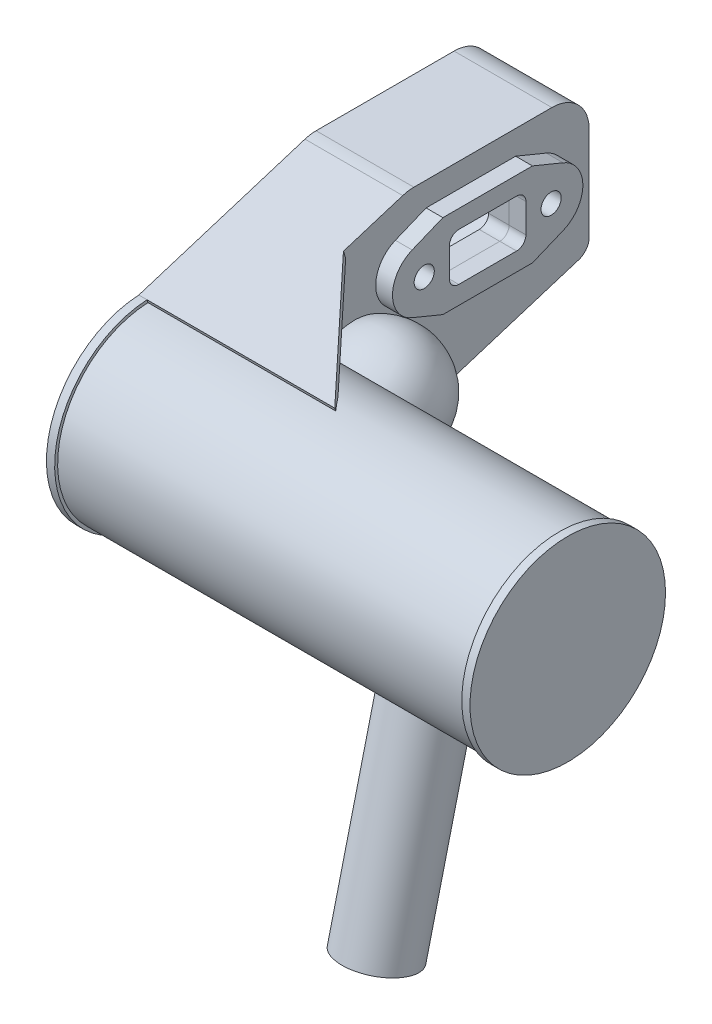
ISO-10303-21;
HEADER;
FILE_DESCRIPTION(('STEP AP214'),'2;1');
FILE_NAME('part.step','',(''),(''),'','','');
FILE_SCHEMA(('AUTOMOTIVE_DESIGN { 1 0 10303 214 1 1 1 1 }'));
ENDSEC;
DATA;
#1=APPLICATION_CONTEXT('core data for automotive mechanical design processes');
#2=APPLICATION_PROTOCOL_DEFINITION('international standard','automotive_design',2000,#1);
#3=PRODUCT_CONTEXT('',#1,'mechanical');
#4=PRODUCT('Part','Part','',(#3));
#5=PRODUCT_RELATED_PRODUCT_CATEGORY('part','',(#4));
#6=PRODUCT_DEFINITION_FORMATION('','',#4);
#7=PRODUCT_DEFINITION_CONTEXT('part definition',#1,'design');
#8=PRODUCT_DEFINITION('design','',#6,#7);
#9=PRODUCT_DEFINITION_SHAPE('','',#8);
#10=(LENGTH_UNIT() NAMED_UNIT(*) SI_UNIT(.MILLI.,.METRE.));
#11=(NAMED_UNIT(*) PLANE_ANGLE_UNIT() SI_UNIT($,.RADIAN.));
#12=(NAMED_UNIT(*) SI_UNIT($,.STERADIAN.) SOLID_ANGLE_UNIT());
#13=UNCERTAINTY_MEASURE_WITH_UNIT(LENGTH_MEASURE(1.E-05),#10,'distance_accuracy_value','');
#14=(GEOMETRIC_REPRESENTATION_CONTEXT(3) GLOBAL_UNCERTAINTY_ASSIGNED_CONTEXT((#13)) GLOBAL_UNIT_ASSIGNED_CONTEXT((#10,
#11,#12)) REPRESENTATION_CONTEXT('',''));
#15=CARTESIAN_POINT('',(0.,0.,0.));
#16=DIRECTION('',(0.,0.,1.));
#17=DIRECTION('',(1.,0.,0.));
#18=AXIS2_PLACEMENT_3D('',#15,#16,#17);
#19=CARTESIAN_POINT('',(33.,-36.2413856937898,62.9418723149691));
#20=DIRECTION('',(0.,-0.135308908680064,0.990803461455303));
#21=DIRECTION('',(1.,0.,0.));
#22=AXIS2_PLACEMENT_3D('',#19,#20,#21);
#23=SPHERICAL_SURFACE('',#22,15.);
#24=CARTESIAN_POINT('',(33.,-38.2710193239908,77.8039242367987));
#25=VERTEX_POINT('',#24);
#26=VERTEX_LOOP('',#25);
#27=FACE_BOUND('',#26,.T.);
#28=ADVANCED_FACE('F42',(#27),#23,.T.);
#29=CLOSED_SHELL('',(#28));
#30=MANIFOLD_SOLID_BREP('B2_NOT_SHOWN',#29);
#31=CARTESIAN_POINT('',(-1.5,-17.7,14.7));
#32=DIRECTION('',(1.,0.,0.));
#33=DIRECTION('',(0.,0.,-1.));
#34=AXIS2_PLACEMENT_3D('',#31,#32,#33);
#35=CYLINDRICAL_SURFACE('',#34,6.25);
#36=CARTESIAN_POINT('',(-1.5,-17.7,14.7));
#37=DIRECTION('',(-1.,0.,0.));
#38=DIRECTION('',(0.,0.,1.));
#39=AXIS2_PLACEMENT_3D('',#36,#37,#38);
#40=CIRCLE('',#39,6.25);
#41=CARTESIAN_POINT('',(-1.5,-17.7,20.95));
#42=VERTEX_POINT('',#41);
#43=EDGE_CURVE('E41',#42,#42,#40,.T.);
#44=ORIENTED_EDGE('',*,*,#43,.F.);
#45=EDGE_LOOP('',(#44));
#46=FACE_BOUND('',#45,.T.);
#47=CARTESIAN_POINT('',(0.,-17.7,14.7));
#48=DIRECTION('',(-1.,0.,0.));
#49=DIRECTION('',(0.,0.,1.));
#50=AXIS2_PLACEMENT_3D('',#47,#48,#49);
#51=CIRCLE('',#50,6.25);
#52=CARTESIAN_POINT('',(0.,-17.7,20.95));
#53=VERTEX_POINT('',#52);
#54=EDGE_CURVE('E69',#53,#53,#51,.T.);
#55=ORIENTED_EDGE('',*,*,#54,.T.);
#56=EDGE_LOOP('',(#55));
#57=FACE_BOUND('',#56,.T.);
#58=ADVANCED_FACE('F62',(#46,#57),#35,.T.);
#59=CARTESIAN_POINT('',(-1.5,-17.7,14.7));
#60=DIRECTION('',(-1.,0.,0.));
#61=DIRECTION('',(0.,0.,1.));
#62=AXIS2_PLACEMENT_3D('',#59,#60,#61);
#63=PLANE('',#62);
#64=CARTESIAN_POINT('',(-1.5,-17.7,14.7));
#65=DIRECTION('',(-1.,0.,0.));
#66=DIRECTION('',(0.,0.,1.));
#67=AXIS2_PLACEMENT_3D('',#64,#65,#66);
#68=CIRCLE('',#67,2.7);
#69=CARTESIAN_POINT('',(-1.5,-17.7,17.4));
#70=VERTEX_POINT('',#69);
#71=EDGE_CURVE('E75',#70,#70,#68,.T.);
#72=ORIENTED_EDGE('',*,*,#71,.F.);
#73=EDGE_LOOP('',(#72));
#74=FACE_BOUND('',#73,.T.);
#75=ORIENTED_EDGE('',*,*,#43,.T.);
#76=EDGE_LOOP('',(#75));
#77=FACE_BOUND('',#76,.T.);
#78=ADVANCED_FACE('F91',(#74,#77),#63,.T.);
#79=CARTESIAN_POINT('',(0.,-17.7,14.7));
#80=DIRECTION('',(-1.,0.,0.));
#81=DIRECTION('',(0.,0.,1.));
#82=AXIS2_PLACEMENT_3D('',#79,#80,#81);
#83=PLANE('',#82);
#84=CARTESIAN_POINT('',(0.,-17.7,14.7));
#85=DIRECTION('',(-1.,0.,0.));
#86=DIRECTION('',(0.,0.,1.));
#87=AXIS2_PLACEMENT_3D('',#84,#85,#86);
#88=CIRCLE('',#87,2.7);
#89=CARTESIAN_POINT('',(0.,-17.7,17.4));
#90=VERTEX_POINT('',#89);
#91=EDGE_CURVE('E65',#90,#90,#88,.T.);
#92=ORIENTED_EDGE('',*,*,#91,.T.);
#93=EDGE_LOOP('',(#92));
#94=FACE_BOUND('',#93,.T.);
#95=ORIENTED_EDGE('',*,*,#54,.F.);
#96=EDGE_LOOP('',(#95));
#97=FACE_BOUND('',#96,.T.);
#98=ADVANCED_FACE('F82',(#94,#97),#83,.F.);
#99=CARTESIAN_POINT('',(113.5,-17.7,14.7));
#100=DIRECTION('',(-1.,0.,0.));
#101=DIRECTION('',(0.,0.,1.));
#102=AXIS2_PLACEMENT_3D('',#99,#100,#101);
#103=CYLINDRICAL_SURFACE('',#102,2.7);
#104=ORIENTED_EDGE('',*,*,#71,.T.);
#105=EDGE_LOOP('',(#104));
#106=FACE_BOUND('',#105,.T.);
#107=ORIENTED_EDGE('',*,*,#91,.F.);
#108=EDGE_LOOP('',(#107));
#109=FACE_BOUND('',#108,.T.);
#110=ADVANCED_FACE('F85',(#106,#109),#103,.F.);
#111=CLOSED_SHELL('',(#58,#78,#98,#110));
#112=MANIFOLD_SOLID_BREP('B6',#111);
#113=CARTESIAN_POINT('',(-1.5,-17.7,48.7));
#114=DIRECTION('',(1.,0.,0.));
#115=DIRECTION('',(0.,0.,-1.));
#116=AXIS2_PLACEMENT_3D('',#113,#114,#115);
#117=CYLINDRICAL_SURFACE('',#116,6.25);
#118=CARTESIAN_POINT('',(-1.5,-17.7,48.7));
#119=DIRECTION('',(-1.,0.,0.));
#120=DIRECTION('',(0.,0.,1.));
#121=AXIS2_PLACEMENT_3D('',#118,#119,#120);
#122=CIRCLE('',#121,6.25);
#123=CARTESIAN_POINT('',(-1.5,-17.7,54.95));
#124=VERTEX_POINT('',#123);
#125=EDGE_CURVE('E61',#124,#124,#122,.T.);
#126=ORIENTED_EDGE('',*,*,#125,.F.);
#127=EDGE_LOOP('',(#126));
#128=FACE_BOUND('',#127,.T.);
#129=CARTESIAN_POINT('',(0.,-17.7,48.7));
#130=DIRECTION('',(-1.,0.,0.));
#131=DIRECTION('',(0.,0.,1.));
#132=AXIS2_PLACEMENT_3D('',#129,#130,#131);
#133=CIRCLE('',#132,6.25);
#134=CARTESIAN_POINT('',(0.,-17.7,54.95));
#135=VERTEX_POINT('',#134);
#136=EDGE_CURVE('E140',#135,#135,#133,.T.);
#137=ORIENTED_EDGE('',*,*,#136,.T.);
#138=EDGE_LOOP('',(#137));
#139=FACE_BOUND('',#138,.T.);
#140=ADVANCED_FACE('F133',(#128,#139),#117,.T.);
#141=CARTESIAN_POINT('',(-1.5,-17.7,48.7));
#142=DIRECTION('',(-1.,0.,0.));
#143=DIRECTION('',(0.,0.,1.));
#144=AXIS2_PLACEMENT_3D('',#141,#142,#143);
#145=PLANE('',#144);
#146=CARTESIAN_POINT('',(-1.5,-17.7,48.7));
#147=DIRECTION('',(-1.,0.,0.));
#148=DIRECTION('',(0.,0.,1.));
#149=AXIS2_PLACEMENT_3D('',#146,#147,#148);
#150=CIRCLE('',#149,2.7);
#151=CARTESIAN_POINT('',(-1.5,-17.7,51.4));
#152=VERTEX_POINT('',#151);
#153=EDGE_CURVE('E146',#152,#152,#150,.T.);
#154=ORIENTED_EDGE('',*,*,#153,.F.);
#155=EDGE_LOOP('',(#154));
#156=FACE_BOUND('',#155,.T.);
#157=ORIENTED_EDGE('',*,*,#125,.T.);
#158=EDGE_LOOP('',(#157));
#159=FACE_BOUND('',#158,.T.);
#160=ADVANCED_FACE('F162',(#156,#159),#145,.T.);
#161=CARTESIAN_POINT('',(0.,-17.7,48.7));
#162=DIRECTION('',(-1.,0.,0.));
#163=DIRECTION('',(0.,0.,1.));
#164=AXIS2_PLACEMENT_3D('',#161,#162,#163);
#165=PLANE('',#164);
#166=CARTESIAN_POINT('',(0.,-17.7,48.7));
#167=DIRECTION('',(-1.,0.,0.));
#168=DIRECTION('',(0.,0.,1.));
#169=AXIS2_PLACEMENT_3D('',#166,#167,#168);
#170=CIRCLE('',#169,2.7);
#171=CARTESIAN_POINT('',(0.,-17.7,51.4));
#172=VERTEX_POINT('',#171);
#173=EDGE_CURVE('E136',#172,#172,#170,.T.);
#174=ORIENTED_EDGE('',*,*,#173,.T.);
#175=EDGE_LOOP('',(#174));
#176=FACE_BOUND('',#175,.T.);
#177=ORIENTED_EDGE('',*,*,#136,.F.);
#178=EDGE_LOOP('',(#177));
#179=FACE_BOUND('',#178,.T.);
#180=ADVANCED_FACE('F153',(#176,#179),#165,.F.);
#181=CARTESIAN_POINT('',(113.5,-17.7,48.7));
#182=DIRECTION('',(-1.,0.,0.));
#183=DIRECTION('',(0.,0.,1.));
#184=AXIS2_PLACEMENT_3D('',#181,#182,#183);
#185=CYLINDRICAL_SURFACE('',#184,2.7);
#186=ORIENTED_EDGE('',*,*,#153,.T.);
#187=EDGE_LOOP('',(#186));
#188=FACE_BOUND('',#187,.T.);
#189=ORIENTED_EDGE('',*,*,#173,.F.);
#190=EDGE_LOOP('',(#189));
#191=FACE_BOUND('',#190,.T.);
#192=ADVANCED_FACE('F156',(#188,#191),#185,.F.);
#193=CLOSED_SHELL('',(#140,#160,#180,#192));
#194=MANIFOLD_SOLID_BREP('B36',#193);
#195=CARTESIAN_POINT('',(30.7,-17.7,14.7));
#196=DIRECTION('',(-1.,0.,0.));
#197=DIRECTION('',(0.,0.,1.));
#198=AXIS2_PLACEMENT_3D('',#195,#196,#197);
#199=CYLINDRICAL_SURFACE('',#198,8.5);
#200=CARTESIAN_POINT('',(26.2,-17.7,14.7));
#201=DIRECTION('',(1.,0.,0.));
#202=DIRECTION('',(0.,0.,-1.));
#203=AXIS2_PLACEMENT_3D('',#200,#201,#202);
#204=CIRCLE('',#203,8.5);
#205=CARTESIAN_POINT('',(26.2,-25.5601709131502,11.4646154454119));
#206=VERTEX_POINT('',#205);
#207=CARTESIAN_POINT('',(26.2,-9.83982908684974,11.464615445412));
#208=VERTEX_POINT('',#207);
#209=EDGE_CURVE('E357',#206,#208,#204,.T.);
#210=ORIENTED_EDGE('',*,*,#209,.T.);
#211=DIRECTION('',(-1.,0.,0.));
#212=VECTOR('',#211,1.);
#213=CARTESIAN_POINT('',(30.7,-9.83982908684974,11.464615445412));
#214=LINE('',#213,#212);
#215=CARTESIAN_POINT('',(30.7,-9.83982908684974,11.464615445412));
#216=VERTEX_POINT('',#215);
#217=EDGE_CURVE('E422',#216,#208,#214,.T.);
#218=ORIENTED_EDGE('',*,*,#217,.F.);
#219=CARTESIAN_POINT('',(30.7,-17.7,14.7));
#220=DIRECTION('',(1.,0.,0.));
#221=DIRECTION('',(0.,0.,-1.));
#222=AXIS2_PLACEMENT_3D('',#219,#220,#221);
#223=CIRCLE('',#222,8.5);
#224=CARTESIAN_POINT('',(30.7,-25.5601709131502,11.4646154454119));
#225=VERTEX_POINT('',#224);
#226=EDGE_CURVE('E368',#225,#216,#223,.T.);
#227=ORIENTED_EDGE('',*,*,#226,.F.);
#228=DIRECTION('',(-1.,0.,0.));
#229=VECTOR('',#228,1.);
#230=CARTESIAN_POINT('',(30.7,-25.5601709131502,11.4646154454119));
#231=LINE('',#230,#229);
#232=EDGE_CURVE('E386',#225,#206,#231,.T.);
#233=ORIENTED_EDGE('',*,*,#232,.T.);
#234=EDGE_LOOP('',(#210,#218,#227,#233));
#235=FACE_BOUND('',#234,.T.);
#236=ADVANCED_FACE('F204',(#235),#199,.T.);
#237=CARTESIAN_POINT('',(30.7,-6.45,19.7));
#238=DIRECTION('',(0.,-0.924725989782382,0.380633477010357));
#239=DIRECTION('',(0.,-0.380633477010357,-0.924725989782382));
#240=AXIS2_PLACEMENT_3D('',#237,#238,#239);
#241=PLANE('',#240);
#242=DIRECTION('',(0.,0.380633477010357,0.924725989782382));
#243=VECTOR('',#242,1.);
#244=CARTESIAN_POINT('',(26.2,-6.45,19.7));
#245=LINE('',#244,#243);
#246=CARTESIAN_POINT('',(26.2,-6.45,19.7));
#247=VERTEX_POINT('',#246);
#248=EDGE_CURVE('E389',#208,#247,#245,.T.);
#249=ORIENTED_EDGE('',*,*,#248,.T.);
#250=DIRECTION('',(-1.,0.,0.));
#251=VECTOR('',#250,1.);
#252=CARTESIAN_POINT('',(30.7,-6.45,19.7));
#253=LINE('',#252,#251);
#254=CARTESIAN_POINT('',(30.7,-6.45,19.7));
#255=VERTEX_POINT('',#254);
#256=EDGE_CURVE('E419',#255,#247,#253,.T.);
#257=ORIENTED_EDGE('',*,*,#256,.F.);
#258=DIRECTION('',(0.,0.380633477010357,0.924725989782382));
#259=VECTOR('',#258,1.);
#260=CARTESIAN_POINT('',(30.7,-6.45,19.7));
#261=LINE('',#260,#259);
#262=EDGE_CURVE('E371',#216,#255,#261,.T.);
#263=ORIENTED_EDGE('',*,*,#262,.F.);
#264=ORIENTED_EDGE('',*,*,#217,.T.);
#265=EDGE_LOOP('',(#249,#257,#263,#264));
#266=FACE_BOUND('',#265,.T.);
#267=ADVANCED_FACE('F476',(#266),#241,.F.);
#268=CARTESIAN_POINT('',(30.7,-6.45000000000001,43.7));
#269=DIRECTION('',(0.,-1.,0.));
#270=DIRECTION('',(0.,0.,-1.));
#271=AXIS2_PLACEMENT_3D('',#268,#269,#270);
#272=PLANE('',#271);
#273=DIRECTION('',(0.,0.,1.));
#274=VECTOR('',#273,1.);
#275=CARTESIAN_POINT('',(26.2,-6.45000000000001,43.7));
#276=LINE('',#275,#274);
#277=CARTESIAN_POINT('',(26.2,-6.45000000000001,43.7));
#278=VERTEX_POINT('',#277);
#279=EDGE_CURVE('E391',#247,#278,#276,.T.);
#280=ORIENTED_EDGE('',*,*,#279,.T.);
#281=DIRECTION('',(-1.,0.,0.));
#282=VECTOR('',#281,1.);
#283=CARTESIAN_POINT('',(30.7,-6.45000000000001,43.7));
#284=LINE('',#283,#282);
#285=CARTESIAN_POINT('',(30.7,-6.45000000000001,43.7));
#286=VERTEX_POINT('',#285);
#287=EDGE_CURVE('E416',#286,#278,#284,.T.);
#288=ORIENTED_EDGE('',*,*,#287,.F.);
#289=DIRECTION('',(0.,0.,1.));
#290=VECTOR('',#289,1.);
#291=CARTESIAN_POINT('',(30.7,-6.45000000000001,43.7));
#292=LINE('',#291,#290);
#293=EDGE_CURVE('E374',#255,#286,#292,.T.);
#294=ORIENTED_EDGE('',*,*,#293,.F.);
#295=ORIENTED_EDGE('',*,*,#256,.T.);
#296=EDGE_LOOP('',(#280,#288,#294,#295));
#297=FACE_BOUND('',#296,.T.);
#298=ADVANCED_FACE('F481',(#297),#272,.F.);
#299=CARTESIAN_POINT('',(30.7,-9.83982908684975,51.935384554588));
#300=DIRECTION('',(0.,-0.924725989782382,-0.380633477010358));
#301=DIRECTION('',(0.,0.380633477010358,-0.924725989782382));
#302=AXIS2_PLACEMENT_3D('',#299,#300,#301);
#303=PLANE('',#302);
#304=DIRECTION('',(0.,-0.380633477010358,0.924725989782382));
#305=VECTOR('',#304,1.);
#306=CARTESIAN_POINT('',(26.2,-9.83982908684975,51.935384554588));
#307=LINE('',#306,#305);
#308=CARTESIAN_POINT('',(26.2,-9.83982908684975,51.935384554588));
#309=VERTEX_POINT('',#308);
#310=EDGE_CURVE('E393',#278,#309,#307,.T.);
#311=ORIENTED_EDGE('',*,*,#310,.T.);
#312=DIRECTION('',(-1.,0.,0.));
#313=VECTOR('',#312,1.);
#314=CARTESIAN_POINT('',(30.7,-9.83982908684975,51.935384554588));
#315=LINE('',#314,#313);
#316=CARTESIAN_POINT('',(30.7,-9.83982908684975,51.935384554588));
#317=VERTEX_POINT('',#316);
#318=EDGE_CURVE('E413',#317,#309,#315,.T.);
#319=ORIENTED_EDGE('',*,*,#318,.F.);
#320=DIRECTION('',(0.,-0.380633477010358,0.924725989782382));
#321=VECTOR('',#320,1.);
#322=CARTESIAN_POINT('',(30.7,-9.83982908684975,51.935384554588));
#323=LINE('',#322,#321);
#324=EDGE_CURVE('E376',#286,#317,#323,.T.);
#325=ORIENTED_EDGE('',*,*,#324,.F.);
#326=ORIENTED_EDGE('',*,*,#287,.T.);
#327=EDGE_LOOP('',(#311,#319,#325,#326));
#328=FACE_BOUND('',#327,.T.);
#329=ADVANCED_FACE('F511',(#328),#303,.F.);
#330=CARTESIAN_POINT('',(30.7,-17.7,48.7));
#331=DIRECTION('',(-1.,0.,0.));
#332=DIRECTION('',(0.,0.,1.));
#333=AXIS2_PLACEMENT_3D('',#330,#331,#332);
#334=CYLINDRICAL_SURFACE('',#333,8.5);
#335=CARTESIAN_POINT('',(26.2,-17.7,48.7));
#336=DIRECTION('',(1.,0.,0.));
#337=DIRECTION('',(0.,0.,-1.));
#338=AXIS2_PLACEMENT_3D('',#335,#336,#337);
#339=CIRCLE('',#338,8.5);
#340=CARTESIAN_POINT('',(26.2,-25.5601709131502,51.935384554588));
#341=VERTEX_POINT('',#340);
#342=EDGE_CURVE('E395',#309,#341,#339,.T.);
#343=ORIENTED_EDGE('',*,*,#342,.T.);
#344=DIRECTION('',(-1.,0.,0.));
#345=VECTOR('',#344,1.);
#346=CARTESIAN_POINT('',(30.7,-25.5601709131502,51.935384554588));
#347=LINE('',#346,#345);
#348=CARTESIAN_POINT('',(30.7,-25.5601709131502,51.935384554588));
#349=VERTEX_POINT('',#348);
#350=EDGE_CURVE('E410',#349,#341,#347,.T.);
#351=ORIENTED_EDGE('',*,*,#350,.F.);
#352=CARTESIAN_POINT('',(30.7,-17.7,48.7));
#353=DIRECTION('',(1.,0.,0.));
#354=DIRECTION('',(0.,0.,-1.));
#355=AXIS2_PLACEMENT_3D('',#352,#353,#354);
#356=CIRCLE('',#355,8.5);
#357=EDGE_CURVE('E378',#317,#349,#356,.T.);
#358=ORIENTED_EDGE('',*,*,#357,.F.);
#359=ORIENTED_EDGE('',*,*,#318,.T.);
#360=EDGE_LOOP('',(#343,#351,#358,#359));
#361=FACE_BOUND('',#360,.T.);
#362=ADVANCED_FACE('F507',(#361),#334,.T.);
#363=CARTESIAN_POINT('',(30.7,-25.5601709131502,51.935384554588));
#364=DIRECTION('',(0.,0.924725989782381,-0.38063347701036));
#365=DIRECTION('',(0.,0.38063347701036,0.924725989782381));
#366=AXIS2_PLACEMENT_3D('',#363,#364,#365);
#367=PLANE('',#366);
#368=DIRECTION('',(0.,-0.38063347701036,-0.924725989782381));
#369=VECTOR('',#368,1.);
#370=CARTESIAN_POINT('',(26.2,-25.5601709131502,51.935384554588));
#371=LINE('',#370,#369);
#372=CARTESIAN_POINT('',(26.2,-28.95,43.7));
#373=VERTEX_POINT('',#372);
#374=EDGE_CURVE('E397',#341,#373,#371,.T.);
#375=ORIENTED_EDGE('',*,*,#374,.T.);
#376=DIRECTION('',(-1.,0.,0.));
#377=VECTOR('',#376,1.);
#378=CARTESIAN_POINT('',(30.7,-28.95,43.7));
#379=LINE('',#378,#377);
#380=CARTESIAN_POINT('',(30.7,-28.95,43.7));
#381=VERTEX_POINT('',#380);
#382=EDGE_CURVE('E407',#381,#373,#379,.T.);
#383=ORIENTED_EDGE('',*,*,#382,.F.);
#384=DIRECTION('',(0.,-0.38063347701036,-0.924725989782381));
#385=VECTOR('',#384,1.);
#386=CARTESIAN_POINT('',(30.7,-25.5601709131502,51.935384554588));
#387=LINE('',#386,#385);
#388=EDGE_CURVE('E380',#349,#381,#387,.T.);
#389=ORIENTED_EDGE('',*,*,#388,.F.);
#390=ORIENTED_EDGE('',*,*,#350,.T.);
#391=EDGE_LOOP('',(#375,#383,#389,#390));
#392=FACE_BOUND('',#391,.T.);
#393=ADVANCED_FACE('F502',(#392),#367,.F.);
#394=CARTESIAN_POINT('',(30.7,-28.95,43.7));
#395=DIRECTION('',(0.,1.,0.));
#396=DIRECTION('',(0.,0.,1.));
#397=AXIS2_PLACEMENT_3D('',#394,#395,#396);
#398=PLANE('',#397);
#399=DIRECTION('',(0.,0.,-1.));
#400=VECTOR('',#399,1.);
#401=CARTESIAN_POINT('',(26.2,-28.95,43.7));
#402=LINE('',#401,#400);
#403=CARTESIAN_POINT('',(26.2,-28.95,19.7));
#404=VERTEX_POINT('',#403);
#405=EDGE_CURVE('E399',#373,#404,#402,.T.);
#406=ORIENTED_EDGE('',*,*,#405,.T.);
#407=DIRECTION('',(-1.,0.,0.));
#408=VECTOR('',#407,1.);
#409=CARTESIAN_POINT('',(30.7,-28.95,19.7));
#410=LINE('',#409,#408);
#411=CARTESIAN_POINT('',(30.7,-28.95,19.7));
#412=VERTEX_POINT('',#411);
#413=EDGE_CURVE('E404',#412,#404,#410,.T.);
#414=ORIENTED_EDGE('',*,*,#413,.F.);
#415=DIRECTION('',(0.,0.,-1.));
#416=VECTOR('',#415,1.);
#417=CARTESIAN_POINT('',(30.7,-28.95,43.7));
#418=LINE('',#417,#416);
#419=EDGE_CURVE('E382',#381,#412,#418,.T.);
#420=ORIENTED_EDGE('',*,*,#419,.F.);
#421=ORIENTED_EDGE('',*,*,#382,.T.);
#422=EDGE_LOOP('',(#406,#414,#420,#421));
#423=FACE_BOUND('',#422,.T.);
#424=ADVANCED_FACE('F471',(#423),#398,.F.);
#425=CARTESIAN_POINT('',(30.7,-28.95,19.7));
#426=DIRECTION('',(0.,0.924725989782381,0.38063347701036));
#427=DIRECTION('',(0.,-0.38063347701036,0.924725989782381));
#428=AXIS2_PLACEMENT_3D('',#425,#426,#427);
#429=PLANE('',#428);
#430=DIRECTION('',(0.,0.38063347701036,-0.924725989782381));
#431=VECTOR('',#430,1.);
#432=CARTESIAN_POINT('',(26.2,-28.95,19.7));
#433=LINE('',#432,#431);
#434=EDGE_CURVE('E372',#404,#206,#433,.T.);
#435=ORIENTED_EDGE('',*,*,#434,.T.);
#436=ORIENTED_EDGE('',*,*,#232,.F.);
#437=DIRECTION('',(0.,0.38063347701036,-0.924725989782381));
#438=VECTOR('',#437,1.);
#439=CARTESIAN_POINT('',(30.7,-28.95,19.7));
#440=LINE('',#439,#438);
#441=EDGE_CURVE('E384',#412,#225,#440,.T.);
#442=ORIENTED_EDGE('',*,*,#441,.F.);
#443=ORIENTED_EDGE('',*,*,#413,.T.);
#444=EDGE_LOOP('',(#435,#436,#442,#443));
#445=FACE_BOUND('',#444,.T.);
#446=ADVANCED_FACE('F462',(#445),#429,.F.);
#447=CARTESIAN_POINT('',(30.7,-17.7,14.7));
#448=DIRECTION('',(1.,0.,0.));
#449=DIRECTION('',(0.,0.,-1.));
#450=AXIS2_PLACEMENT_3D('',#447,#448,#449);
#451=PLANE('',#450);
#452=CARTESIAN_POINT('',(30.7,-17.7,14.7));
#453=DIRECTION('',(1.,0.,0.));
#454=DIRECTION('',(0.,0.,-1.));
#455=AXIS2_PLACEMENT_3D('',#452,#453,#454);
#456=CIRCLE('',#455,2.7);
#457=CARTESIAN_POINT('',(30.7,-17.7,12.));
#458=VERTEX_POINT('',#457);
#459=EDGE_CURVE('E451',#458,#458,#456,.T.);
#460=ORIENTED_EDGE('',*,*,#459,.F.);
#461=EDGE_LOOP('',(#460));
#462=FACE_BOUND('',#461,.T.);
#463=CARTESIAN_POINT('',(30.7,-17.7,48.7));
#464=DIRECTION('',(1.,0.,0.));
#465=DIRECTION('',(0.,0.,-1.));
#466=AXIS2_PLACEMENT_3D('',#463,#464,#465);
#467=CIRCLE('',#466,2.7);
#468=CARTESIAN_POINT('',(30.7,-17.7,46.));
#469=VERTEX_POINT('',#468);
#470=EDGE_CURVE('E443',#469,#469,#467,.T.);
#471=ORIENTED_EDGE('',*,*,#470,.F.);
#472=EDGE_LOOP('',(#471));
#473=FACE_BOUND('',#472,.T.);
#474=CARTESIAN_POINT('',(30.7,-21.575,23.95));
#475=DIRECTION('',(1.,0.,0.));
#476=DIRECTION('',(0.,0.,-1.));
#477=AXIS2_PLACEMENT_3D('',#474,#475,#476);
#478=CIRCLE('',#477,2.5);
#479=CARTESIAN_POINT('',(30.7,-24.075,23.95));
#480=VERTEX_POINT('',#479);
#481=CARTESIAN_POINT('',(30.7,-21.575,21.45));
#482=VERTEX_POINT('',#481);
#483=EDGE_CURVE('E220',#480,#482,#478,.T.);
#484=ORIENTED_EDGE('',*,*,#483,.F.);
#485=DIRECTION('',(0.,0.,-1.));
#486=VECTOR('',#485,1.);
#487=CARTESIAN_POINT('',(30.7,-24.075,39.45));
#488=LINE('',#487,#486);
#489=CARTESIAN_POINT('',(30.7,-24.075,39.45));
#490=VERTEX_POINT('',#489);
#491=EDGE_CURVE('E352',#490,#480,#488,.T.);
#492=ORIENTED_EDGE('',*,*,#491,.F.);
#493=CARTESIAN_POINT('',(30.7,-21.575,39.45));
#494=DIRECTION('',(1.,0.,0.));
#495=DIRECTION('',(0.,0.,-1.));
#496=AXIS2_PLACEMENT_3D('',#493,#494,#495);
#497=CIRCLE('',#496,2.5);
#498=CARTESIAN_POINT('',(30.7,-21.575,41.95));
#499=VERTEX_POINT('',#498);
#500=EDGE_CURVE('E349',#499,#490,#497,.T.);
#501=ORIENTED_EDGE('',*,*,#500,.F.);
#502=DIRECTION('',(0.,-1.,0.));
#503=VECTOR('',#502,1.);
#504=CARTESIAN_POINT('',(30.7,-13.825,41.95));
#505=LINE('',#504,#503);
#506=CARTESIAN_POINT('',(30.7,-13.825,41.95));
#507=VERTEX_POINT('',#506);
#508=EDGE_CURVE('E346',#507,#499,#505,.T.);
#509=ORIENTED_EDGE('',*,*,#508,.F.);
#510=CARTESIAN_POINT('',(30.7,-13.825,39.45));
#511=DIRECTION('',(1.,0.,0.));
#512=DIRECTION('',(0.,0.,-1.));
#513=AXIS2_PLACEMENT_3D('',#510,#511,#512);
#514=CIRCLE('',#513,2.5);
#515=CARTESIAN_POINT('',(30.7,-11.325,39.45));
#516=VERTEX_POINT('',#515);
#517=EDGE_CURVE('E340',#516,#507,#514,.T.);
#518=ORIENTED_EDGE('',*,*,#517,.F.);
#519=DIRECTION('',(0.,0.,1.));
#520=VECTOR('',#519,1.);
#521=CARTESIAN_POINT('',(30.7,-11.325,39.45));
#522=LINE('',#521,#520);
#523=CARTESIAN_POINT('',(30.7,-11.325,23.95));
#524=VERTEX_POINT('',#523);
#525=EDGE_CURVE('E338',#524,#516,#522,.T.);
#526=ORIENTED_EDGE('',*,*,#525,.F.);
#527=CARTESIAN_POINT('',(30.7,-13.825,23.95));
#528=DIRECTION('',(1.,0.,0.));
#529=DIRECTION('',(0.,0.,1.));
#530=AXIS2_PLACEMENT_3D('',#527,#528,#529);
#531=CIRCLE('',#530,2.5);
#532=CARTESIAN_POINT('',(30.7,-13.825,21.45));
#533=VERTEX_POINT('',#532);
#534=EDGE_CURVE('E321',#533,#524,#531,.T.);
#535=ORIENTED_EDGE('',*,*,#534,.F.);
#536=DIRECTION('',(0.,1.,0.));
#537=VECTOR('',#536,1.);
#538=CARTESIAN_POINT('',(30.7,-13.825,21.45));
#539=LINE('',#538,#537);
#540=EDGE_CURVE('E330',#482,#533,#539,.T.);
#541=ORIENTED_EDGE('',*,*,#540,.F.);
#542=EDGE_LOOP('',(#484,#492,#501,#509,#518,#526,#535,#541));
#543=FACE_BOUND('',#542,.T.);
#544=ORIENTED_EDGE('',*,*,#226,.T.);
#545=ORIENTED_EDGE('',*,*,#262,.T.);
#546=ORIENTED_EDGE('',*,*,#293,.T.);
#547=ORIENTED_EDGE('',*,*,#324,.T.);
#548=ORIENTED_EDGE('',*,*,#357,.T.);
#549=ORIENTED_EDGE('',*,*,#388,.T.);
#550=ORIENTED_EDGE('',*,*,#419,.T.);
#551=ORIENTED_EDGE('',*,*,#441,.T.);
#552=EDGE_LOOP('',(#544,#545,#546,#547,#548,#549,#550,#551));
#553=FACE_BOUND('',#552,.T.);
#554=ADVANCED_FACE('F334',(#462,#473,#543,#553),#451,.T.);
#555=CARTESIAN_POINT('',(26.2,-17.7,14.7));
#556=DIRECTION('',(1.,0.,0.));
#557=DIRECTION('',(0.,0.,-1.));
#558=AXIS2_PLACEMENT_3D('',#555,#556,#557);
#559=PLANE('',#558);
#560=CARTESIAN_POINT('',(26.2,-17.7,14.7));
#561=DIRECTION('',(1.,0.,0.));
#562=DIRECTION('',(0.,0.,-1.));
#563=AXIS2_PLACEMENT_3D('',#560,#561,#562);
#564=CIRCLE('',#563,2.7);
#565=CARTESIAN_POINT('',(26.2,-17.7,12.));
#566=VERTEX_POINT('',#565);
#567=EDGE_CURVE('E207',#566,#566,#564,.T.);
#568=ORIENTED_EDGE('',*,*,#567,.T.);
#569=EDGE_LOOP('',(#568));
#570=FACE_BOUND('',#569,.T.);
#571=CARTESIAN_POINT('',(26.2,-17.7,48.7));
#572=DIRECTION('',(1.,0.,0.));
#573=DIRECTION('',(0.,0.,-1.));
#574=AXIS2_PLACEMENT_3D('',#571,#572,#573);
#575=CIRCLE('',#574,2.7);
#576=CARTESIAN_POINT('',(26.2,-17.7,46.));
#577=VERTEX_POINT('',#576);
#578=EDGE_CURVE('E441',#577,#577,#575,.T.);
#579=ORIENTED_EDGE('',*,*,#578,.T.);
#580=EDGE_LOOP('',(#579));
#581=FACE_BOUND('',#580,.T.);
#582=DIRECTION('',(0.,0.,-1.));
#583=VECTOR('',#582,1.);
#584=CARTESIAN_POINT('',(26.2,-24.075,14.7));
#585=LINE('',#584,#583);
#586=CARTESIAN_POINT('',(26.2,-24.075,39.45));
#587=VERTEX_POINT('',#586);
#588=CARTESIAN_POINT('',(26.2,-24.075,23.95));
#589=VERTEX_POINT('',#588);
#590=EDGE_CURVE('E212',#587,#589,#585,.T.);
#591=ORIENTED_EDGE('',*,*,#590,.T.);
#592=CARTESIAN_POINT('',(26.2,-21.575,23.95));
#593=DIRECTION('',(1.,0.,0.));
#594=DIRECTION('',(0.,0.,-1.));
#595=AXIS2_PLACEMENT_3D('',#592,#593,#594);
#596=CIRCLE('',#595,2.5);
#597=CARTESIAN_POINT('',(26.2,-21.575,21.45));
#598=VERTEX_POINT('',#597);
#599=EDGE_CURVE('E131',#589,#598,#596,.T.);
#600=ORIENTED_EDGE('',*,*,#599,.T.);
#601=DIRECTION('',(0.,1.,0.));
#602=VECTOR('',#601,1.);
#603=CARTESIAN_POINT('',(26.2,-17.7,21.45));
#604=LINE('',#603,#602);
#605=CARTESIAN_POINT('',(26.2,-13.825,21.45));
#606=VERTEX_POINT('',#605);
#607=EDGE_CURVE('E425',#598,#606,#604,.T.);
#608=ORIENTED_EDGE('',*,*,#607,.T.);
#609=CARTESIAN_POINT('',(26.2,-13.825,23.95));
#610=DIRECTION('',(1.,0.,0.));
#611=DIRECTION('',(0.,0.,-1.));
#612=AXIS2_PLACEMENT_3D('',#609,#610,#611);
#613=CIRCLE('',#612,2.5);
#614=CARTESIAN_POINT('',(26.2,-11.325,23.95));
#615=VERTEX_POINT('',#614);
#616=EDGE_CURVE('E324',#606,#615,#613,.T.);
#617=ORIENTED_EDGE('',*,*,#616,.T.);
#618=DIRECTION('',(0.,0.,1.));
#619=VECTOR('',#618,1.);
#620=CARTESIAN_POINT('',(26.2,-11.325,14.7));
#621=LINE('',#620,#619);
#622=CARTESIAN_POINT('',(26.2,-11.325,39.45));
#623=VERTEX_POINT('',#622);
#624=EDGE_CURVE('E428',#615,#623,#621,.T.);
#625=ORIENTED_EDGE('',*,*,#624,.T.);
#626=CARTESIAN_POINT('',(26.2,-13.825,39.45));
#627=DIRECTION('',(1.,0.,0.));
#628=DIRECTION('',(0.,0.,-1.));
#629=AXIS2_PLACEMENT_3D('',#626,#627,#628);
#630=CIRCLE('',#629,2.5);
#631=CARTESIAN_POINT('',(26.2,-13.825,41.95));
#632=VERTEX_POINT('',#631);
#633=EDGE_CURVE('E431',#623,#632,#630,.T.);
#634=ORIENTED_EDGE('',*,*,#633,.T.);
#635=DIRECTION('',(0.,-1.,0.));
#636=VECTOR('',#635,1.);
#637=CARTESIAN_POINT('',(26.2,-17.7,41.95));
#638=LINE('',#637,#636);
#639=CARTESIAN_POINT('',(26.2,-21.575,41.95));
#640=VERTEX_POINT('',#639);
#641=EDGE_CURVE('E434',#632,#640,#638,.T.);
#642=ORIENTED_EDGE('',*,*,#641,.T.);
#643=CARTESIAN_POINT('',(26.2,-21.575,39.45));
#644=DIRECTION('',(1.,0.,0.));
#645=DIRECTION('',(0.,0.,-1.));
#646=AXIS2_PLACEMENT_3D('',#643,#644,#645);
#647=CIRCLE('',#646,2.5);
#648=EDGE_CURVE('E437',#640,#587,#647,.T.);
#649=ORIENTED_EDGE('',*,*,#648,.T.);
#650=EDGE_LOOP('',(#591,#600,#608,#617,#625,#634,#642,#649));
#651=FACE_BOUND('',#650,.T.);
#652=ORIENTED_EDGE('',*,*,#209,.F.);
#653=ORIENTED_EDGE('',*,*,#434,.F.);
#654=ORIENTED_EDGE('',*,*,#405,.F.);
#655=ORIENTED_EDGE('',*,*,#374,.F.);
#656=ORIENTED_EDGE('',*,*,#342,.F.);
#657=ORIENTED_EDGE('',*,*,#310,.F.);
#658=ORIENTED_EDGE('',*,*,#279,.F.);
#659=ORIENTED_EDGE('',*,*,#248,.F.);
#660=EDGE_LOOP('',(#652,#653,#654,#655,#656,#657,#658,#659));
#661=FACE_BOUND('',#660,.T.);
#662=ADVANCED_FACE('F461',(#570,#581,#651,#661),#559,.F.);
#663=CARTESIAN_POINT('',(20.7,-21.575,23.95));
#664=DIRECTION('',(1.,0.,0.));
#665=DIRECTION('',(0.,0.,-1.));
#666=AXIS2_PLACEMENT_3D('',#663,#664,#665);
#667=CYLINDRICAL_SURFACE('',#666,2.5);
#668=DIRECTION('',(1.,0.,0.));
#669=VECTOR('',#668,1.);
#670=CARTESIAN_POINT('',(20.7,-24.075,23.95));
#671=LINE('',#670,#669);
#672=EDGE_CURVE('E355',#589,#480,#671,.T.);
#673=ORIENTED_EDGE('',*,*,#672,.T.);
#674=ORIENTED_EDGE('',*,*,#483,.T.);
#675=DIRECTION('',(1.,0.,0.));
#676=VECTOR('',#675,1.);
#677=CARTESIAN_POINT('',(20.7,-21.575,21.45));
#678=LINE('',#677,#676);
#679=EDGE_CURVE('E327',#598,#482,#678,.T.);
#680=ORIENTED_EDGE('',*,*,#679,.F.);
#681=ORIENTED_EDGE('',*,*,#599,.F.);
#682=EDGE_LOOP('',(#673,#674,#680,#681));
#683=FACE_BOUND('',#682,.T.);
#684=ADVANCED_FACE('F468',(#683),#667,.F.);
#685=CARTESIAN_POINT('',(20.7,-24.075,39.45));
#686=DIRECTION('',(0.,-1.,0.));
#687=DIRECTION('',(0.,0.,-1.));
#688=AXIS2_PLACEMENT_3D('',#685,#686,#687);
#689=PLANE('',#688);
#690=DIRECTION('',(1.,0.,0.));
#691=VECTOR('',#690,1.);
#692=CARTESIAN_POINT('',(20.7,-24.075,39.45));
#693=LINE('',#692,#691);
#694=EDGE_CURVE('E358',#587,#490,#693,.T.);
#695=ORIENTED_EDGE('',*,*,#694,.T.);
#696=ORIENTED_EDGE('',*,*,#491,.T.);
#697=ORIENTED_EDGE('',*,*,#672,.F.);
#698=ORIENTED_EDGE('',*,*,#590,.F.);
#699=EDGE_LOOP('',(#695,#696,#697,#698));
#700=FACE_BOUND('',#699,.T.);
#701=ADVANCED_FACE('F553',(#700),#689,.F.);
#702=CARTESIAN_POINT('',(20.7,-21.575,39.45));
#703=DIRECTION('',(1.,0.,0.));
#704=DIRECTION('',(0.,0.,-1.));
#705=AXIS2_PLACEMENT_3D('',#702,#703,#704);
#706=CYLINDRICAL_SURFACE('',#705,2.5);
#707=DIRECTION('',(1.,0.,0.));
#708=VECTOR('',#707,1.);
#709=CARTESIAN_POINT('',(20.7,-21.575,41.95));
#710=LINE('',#709,#708);
#711=EDGE_CURVE('E360',#640,#499,#710,.T.);
#712=ORIENTED_EDGE('',*,*,#711,.T.);
#713=ORIENTED_EDGE('',*,*,#500,.T.);
#714=ORIENTED_EDGE('',*,*,#694,.F.);
#715=ORIENTED_EDGE('',*,*,#648,.F.);
#716=EDGE_LOOP('',(#712,#713,#714,#715));
#717=FACE_BOUND('',#716,.T.);
#718=ADVANCED_FACE('F561',(#717),#706,.F.);
#719=CARTESIAN_POINT('',(20.7,-13.825,41.95));
#720=DIRECTION('',(0.,0.,1.));
#721=DIRECTION('',(1.,0.,0.));
#722=AXIS2_PLACEMENT_3D('',#719,#720,#721);
#723=PLANE('',#722);
#724=DIRECTION('',(1.,0.,0.));
#725=VECTOR('',#724,1.);
#726=CARTESIAN_POINT('',(20.7,-13.825,41.95));
#727=LINE('',#726,#725);
#728=EDGE_CURVE('E362',#632,#507,#727,.T.);
#729=ORIENTED_EDGE('',*,*,#728,.T.);
#730=ORIENTED_EDGE('',*,*,#508,.T.);
#731=ORIENTED_EDGE('',*,*,#711,.F.);
#732=ORIENTED_EDGE('',*,*,#641,.F.);
#733=EDGE_LOOP('',(#729,#730,#731,#732));
#734=FACE_BOUND('',#733,.T.);
#735=ADVANCED_FACE('F571',(#734),#723,.F.);
#736=CARTESIAN_POINT('',(20.7,-13.825,39.45));
#737=DIRECTION('',(1.,0.,0.));
#738=DIRECTION('',(0.,0.,-1.));
#739=AXIS2_PLACEMENT_3D('',#736,#737,#738);
#740=CYLINDRICAL_SURFACE('',#739,2.5);
#741=DIRECTION('',(1.,0.,0.));
#742=VECTOR('',#741,1.);
#743=CARTESIAN_POINT('',(20.7,-11.325,39.45));
#744=LINE('',#743,#742);
#745=EDGE_CURVE('E364',#623,#516,#744,.T.);
#746=ORIENTED_EDGE('',*,*,#745,.T.);
#747=ORIENTED_EDGE('',*,*,#517,.T.);
#748=ORIENTED_EDGE('',*,*,#728,.F.);
#749=ORIENTED_EDGE('',*,*,#633,.F.);
#750=EDGE_LOOP('',(#746,#747,#748,#749));
#751=FACE_BOUND('',#750,.T.);
#752=ADVANCED_FACE('F581',(#751),#740,.F.);
#753=CARTESIAN_POINT('',(20.7,-11.325,39.45));
#754=DIRECTION('',(0.,1.,0.));
#755=DIRECTION('',(0.,0.,1.));
#756=AXIS2_PLACEMENT_3D('',#753,#754,#755);
#757=PLANE('',#756);
#758=DIRECTION('',(1.,0.,0.));
#759=VECTOR('',#758,1.);
#760=CARTESIAN_POINT('',(20.7,-11.325,23.95));
#761=LINE('',#760,#759);
#762=EDGE_CURVE('E326',#615,#524,#761,.T.);
#763=ORIENTED_EDGE('',*,*,#762,.T.);
#764=ORIENTED_EDGE('',*,*,#525,.T.);
#765=ORIENTED_EDGE('',*,*,#745,.F.);
#766=ORIENTED_EDGE('',*,*,#624,.F.);
#767=EDGE_LOOP('',(#763,#764,#765,#766));
#768=FACE_BOUND('',#767,.T.);
#769=ADVANCED_FACE('F591',(#768),#757,.F.);
#770=CARTESIAN_POINT('',(20.7,-13.825,23.95));
#771=DIRECTION('',(1.,0.,0.));
#772=DIRECTION('',(0.,0.,-1.));
#773=AXIS2_PLACEMENT_3D('',#770,#771,#772);
#774=CYLINDRICAL_SURFACE('',#773,2.5);
#775=DIRECTION('',(1.,0.,0.));
#776=VECTOR('',#775,1.);
#777=CARTESIAN_POINT('',(20.7,-13.825,21.45));
#778=LINE('',#777,#776);
#779=EDGE_CURVE('E228',#606,#533,#778,.T.);
#780=ORIENTED_EDGE('',*,*,#779,.T.);
#781=ORIENTED_EDGE('',*,*,#534,.T.);
#782=ORIENTED_EDGE('',*,*,#762,.F.);
#783=ORIENTED_EDGE('',*,*,#616,.F.);
#784=EDGE_LOOP('',(#780,#781,#782,#783));
#785=FACE_BOUND('',#784,.T.);
#786=ADVANCED_FACE('F318',(#785),#774,.F.);
#787=CARTESIAN_POINT('',(20.7,-13.825,21.45));
#788=DIRECTION('',(0.,0.,-1.));
#789=DIRECTION('',(0.,1.,0.));
#790=AXIS2_PLACEMENT_3D('',#787,#788,#789);
#791=PLANE('',#790);
#792=ORIENTED_EDGE('',*,*,#679,.T.);
#793=ORIENTED_EDGE('',*,*,#540,.T.);
#794=ORIENTED_EDGE('',*,*,#779,.F.);
#795=ORIENTED_EDGE('',*,*,#607,.F.);
#796=EDGE_LOOP('',(#792,#793,#794,#795));
#797=FACE_BOUND('',#796,.T.);
#798=ADVANCED_FACE('F331',(#797),#791,.F.);
#799=CARTESIAN_POINT('',(113.5,-17.7,48.7));
#800=DIRECTION('',(-1.,0.,0.));
#801=DIRECTION('',(0.,0.,1.));
#802=AXIS2_PLACEMENT_3D('',#799,#800,#801);
#803=CYLINDRICAL_SURFACE('',#802,2.7);
#804=ORIENTED_EDGE('',*,*,#470,.T.);
#805=EDGE_LOOP('',(#804));
#806=FACE_BOUND('',#805,.T.);
#807=ORIENTED_EDGE('',*,*,#578,.F.);
#808=EDGE_LOOP('',(#807));
#809=FACE_BOUND('',#808,.T.);
#810=ADVANCED_FACE('F618',(#806,#809),#803,.F.);
#811=CARTESIAN_POINT('',(113.5,-17.7,14.7));
#812=DIRECTION('',(-1.,0.,0.));
#813=DIRECTION('',(0.,0.,1.));
#814=AXIS2_PLACEMENT_3D('',#811,#812,#813);
#815=CYLINDRICAL_SURFACE('',#814,2.7);
#816=ORIENTED_EDGE('',*,*,#459,.T.);
#817=EDGE_LOOP('',(#816));
#818=FACE_BOUND('',#817,.T.);
#819=ORIENTED_EDGE('',*,*,#567,.F.);
#820=EDGE_LOOP('',(#819));
#821=FACE_BOUND('',#820,.T.);
#822=ADVANCED_FACE('F456',(#818,#821),#815,.F.);
#823=CLOSED_SHELL('',(#236,#267,#298,#329,#362,#393,#424,#446,#554,#662,#684,#701,#718,#735,
#752,#769,#786,#798,#810,#822));
#824=MANIFOLD_SOLID_BREP('B56',#823);
#825=CARTESIAN_POINT('',(26.2,-40.5296060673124,93.0384219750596));
#826=DIRECTION('',(-1.,0.,0.));
#827=DIRECTION('',(0.,0.,1.));
#828=AXIS2_PLACEMENT_3D('',#825,#826,#827);
#829=CYLINDRICAL_SURFACE('',#828,25.4);
#830=CARTESIAN_POINT('',(81.2,-65.6664509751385,89.3916387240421));
#831=CARTESIAN_POINT('',(81.4565584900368,-65.6664501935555,89.3916372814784));
#832=CARTESIAN_POINT('',(81.7131005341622,-65.6680688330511,89.4027397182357));
#833=CARTESIAN_POINT('',(82.2242364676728,-65.674430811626,89.4470026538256));
#834=CARTESIAN_POINT('',(82.4788303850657,-65.6791741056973,89.4801628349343));
#835=CARTESIAN_POINT('',(82.9841535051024,-65.6914618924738,89.5681230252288));
#836=CARTESIAN_POINT('',(83.2348829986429,-65.6990061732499,89.622921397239));
#837=CARTESIAN_POINT('',(83.7307328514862,-65.7163814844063,89.7535056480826));
#838=CARTESIAN_POINT('',(83.9758530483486,-65.7262125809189,89.8292921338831));
#839=CARTESIAN_POINT('',(84.4582127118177,-65.7474606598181,90.0007837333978));
#840=CARTESIAN_POINT('',(84.6954712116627,-65.7588734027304,90.0964359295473));
#841=CARTESIAN_POINT('',(85.1614051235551,-65.7825207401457,90.3068465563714));
#842=CARTESIAN_POINT('',(85.390077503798,-65.7947556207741,90.4216116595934));
#843=CARTESIAN_POINT('',(85.8374481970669,-65.8191715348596,90.6691728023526));
#844=CARTESIAN_POINT('',(86.0561461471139,-65.8313525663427,90.8019694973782));
#845=CARTESIAN_POINT('',(86.4823858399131,-65.8547366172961,91.0844901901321));
#846=CARTESIAN_POINT('',(86.6899267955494,-65.8659395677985,91.2342153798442));
#847=CARTESIAN_POINT('',(87.1018106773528,-65.8868784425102,91.5565407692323));
#848=CARTESIAN_POINT('',(87.305590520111,-65.8965257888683,91.7298666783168));
#849=CARTESIAN_POINT('',(87.6986031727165,-65.9126323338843,92.0924302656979));
#850=CARTESIAN_POINT('',(87.8878356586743,-65.9190914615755,92.2816682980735));
#851=CARTESIAN_POINT('',(88.2506831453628,-65.9277631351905,92.6747412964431));
#852=CARTESIAN_POINT('',(88.4242946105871,-65.929974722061,92.8785795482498));
#853=CARTESIAN_POINT('',(88.754764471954,-65.9291367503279,93.2993943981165));
#854=CARTESIAN_POINT('',(88.9116233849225,-65.9260873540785,93.5163705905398));
#855=CARTESIAN_POINT('',(89.2125969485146,-65.9135778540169,93.9696016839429));
#856=CARTESIAN_POINT('',(89.3560933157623,-65.9039023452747,94.2062619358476));
#857=CARTESIAN_POINT('',(89.622853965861,-65.8769990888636,94.6901980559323));
#858=CARTESIAN_POINT('',(89.7461263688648,-65.859774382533,94.9374696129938));
#859=CARTESIAN_POINT('',(89.9714274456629,-65.8170002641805,95.4408119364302));
#860=CARTESIAN_POINT('',(90.0734572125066,-65.7914512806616,95.696882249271));
#861=CARTESIAN_POINT('',(90.2552957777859,-65.7314430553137,96.2157802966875));
#862=CARTESIAN_POINT('',(90.3351057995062,-65.6969843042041,96.4786076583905));
#863=CARTESIAN_POINT('',(90.4687457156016,-65.6204786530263,96.9974494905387));
#864=CARTESIAN_POINT('',(90.5235437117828,-65.5788209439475,97.2532721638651));
#865=CARTESIAN_POINT('',(90.611472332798,-65.4869248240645,97.7670942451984));
#866=CARTESIAN_POINT('',(90.6446035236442,-65.4366866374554,98.0250935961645));
#867=CARTESIAN_POINT('',(90.6888404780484,-65.3277860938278,98.5411292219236));
#868=CARTESIAN_POINT('',(90.6999523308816,-65.269126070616,98.799165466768));
#869=CARTESIAN_POINT('',(90.7000473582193,-65.1437529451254,99.3132742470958));
#870=CARTESIAN_POINT('',(90.6890311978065,-65.0770400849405,99.5693468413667));
#871=CARTESIAN_POINT('',(90.6460802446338,-64.9396514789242,100.064981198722));
#872=CARTESIAN_POINT('',(90.6152033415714,-64.8693331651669,100.304734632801));
#873=CARTESIAN_POINT('',(90.533860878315,-64.722681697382,100.779009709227));
#874=CARTESIAN_POINT('',(90.4833960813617,-64.6463487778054,101.013531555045));
#875=CARTESIAN_POINT('',(90.3633525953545,-64.4885333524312,101.475806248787));
#876=CARTESIAN_POINT('',(90.2937766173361,-64.4070515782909,101.703560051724));
#877=CARTESIAN_POINT('',(90.1360849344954,-64.2398765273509,102.1510590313));
#878=CARTESIAN_POINT('',(90.0479621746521,-64.1541816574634,102.370801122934));
#879=CARTESIAN_POINT('',(89.8525362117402,-63.9784541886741,102.804021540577));
#880=CARTESIAN_POINT('',(89.7449797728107,-63.8883774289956,103.017367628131));
#881=CARTESIAN_POINT('',(89.512333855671,-63.7061998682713,103.43347419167));
#882=CARTESIAN_POINT('',(89.3872379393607,-63.61409833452,103.636230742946));
#883=CARTESIAN_POINT('',(89.120409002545,-63.4291564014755,104.030143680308));
#884=CARTESIAN_POINT('',(88.9786747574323,-63.336315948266,104.221299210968));
#885=CARTESIAN_POINT('',(88.679480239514,-63.1512024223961,104.591177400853));
#886=CARTESIAN_POINT('',(88.5220192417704,-63.0589293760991,104.769899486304));
#887=CARTESIAN_POINT('',(88.182648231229,-62.8709384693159,105.124257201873));
#888=CARTESIAN_POINT('',(87.9998468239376,-62.7753348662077,105.299100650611));
#889=CARTESIAN_POINT('',(87.6188701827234,-62.5879031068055,105.633191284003));
#890=CARTESIAN_POINT('',(87.4207011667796,-62.4960734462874,105.792444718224));
#891=CARTESIAN_POINT('',(87.0099484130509,-62.3177042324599,106.094823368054));
#892=CARTESIAN_POINT('',(86.7973551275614,-62.2311682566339,106.237937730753));
#893=CARTESIAN_POINT('',(86.3591967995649,-62.065105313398,106.507174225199));
#894=CARTESIAN_POINT('',(86.1336369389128,-61.9855755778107,106.633303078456));
#895=CARTESIAN_POINT('',(85.6655909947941,-61.8333799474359,106.870614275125));
#896=CARTESIAN_POINT('',(85.4228382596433,-61.7609087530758,106.981396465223));
#897=CARTESIAN_POINT('',(84.9267750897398,-61.6265708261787,107.183839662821));
#898=CARTESIAN_POINT('',(84.6734692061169,-61.5646995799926,107.275508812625));
#899=CARTESIAN_POINT('',(84.1580343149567,-61.4530286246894,107.43912362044));
#900=CARTESIAN_POINT('',(83.8959073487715,-61.4032261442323,107.511073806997));
#901=CARTESIAN_POINT('',(83.3647689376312,-61.316962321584,107.634706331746));
#902=CARTESIAN_POINT('',(83.0957579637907,-61.2805000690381,107.686390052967));
#903=CARTESIAN_POINT('',(82.5679533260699,-61.2235163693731,107.76677436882));
#904=CARTESIAN_POINT('',(82.3094104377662,-61.202229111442,107.796581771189));
#905=CARTESIAN_POINT('',(81.7900989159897,-61.1729897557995,107.837453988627));
#906=CARTESIAN_POINT('',(81.5293303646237,-61.1650371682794,107.848519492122));
#907=CARTESIAN_POINT('',(81.0076716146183,-61.1626727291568,107.851813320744));
#908=CARTESIAN_POINT('',(80.7467814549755,-61.1682579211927,107.844045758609));
#909=CARTESIAN_POINT('',(80.2268766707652,-61.1928184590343,107.809748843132));
#910=CARTESIAN_POINT('',(79.9678620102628,-61.2117935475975,107.783219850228));
#911=CARTESIAN_POINT('',(79.4658974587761,-61.2614417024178,107.71332320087));
#912=CARTESIAN_POINT('',(79.2227680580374,-61.2915176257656,107.670813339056));
#913=CARTESIAN_POINT('',(78.7415489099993,-61.3627189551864,107.569259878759));
#914=CARTESIAN_POINT('',(78.5034609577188,-61.4038482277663,107.510210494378));
#915=CARTESIAN_POINT('',(78.0339626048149,-61.4962650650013,107.375989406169));
#916=CARTESIAN_POINT('',(77.8025507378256,-61.5475503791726,107.300821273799));
#917=CARTESIAN_POINT('',(77.3476163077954,-61.6592746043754,107.134773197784));
#918=CARTESIAN_POINT('',(77.1240968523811,-61.7197170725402,107.0438871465));
#919=CARTESIAN_POINT('',(76.678172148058,-61.8509826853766,106.843268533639));
#920=CARTESIAN_POINT('',(76.4561128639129,-61.9221067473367,106.732963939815));
#921=CARTESIAN_POINT('',(76.0230301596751,-62.0716389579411,106.496519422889));
#922=CARTESIAN_POINT('',(75.8120117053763,-62.1500503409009,106.370372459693));
#923=CARTESIAN_POINT('',(75.4022206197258,-62.3127465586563,106.102850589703));
#924=CARTESIAN_POINT('',(75.2034491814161,-62.3970319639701,105.96147420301));
#925=CARTESIAN_POINT('',(74.819223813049,-62.5700623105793,105.664105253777));
#926=CARTESIAN_POINT('',(74.6337703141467,-62.6588073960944,105.508112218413));
#927=CARTESIAN_POINT('',(74.2658951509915,-62.8450684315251,105.171821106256));
#928=CARTESIAN_POINT('',(74.0844080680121,-62.9427840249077,104.990609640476));
#929=CARTESIAN_POINT('',(73.7388629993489,-63.1399585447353,104.613276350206));
#930=CARTESIAN_POINT('',(73.5747989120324,-63.2394168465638,104.417159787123));
#931=CARTESIAN_POINT('',(73.2650969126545,-63.4385158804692,104.010798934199));
#932=CARTESIAN_POINT('',(73.1194670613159,-63.538156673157,103.800548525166));
#933=CARTESIAN_POINT('',(72.8478902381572,-63.7359367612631,103.367164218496));
#934=CARTESIAN_POINT('',(72.7219348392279,-63.8340766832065,103.14403589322));
#935=CARTESIAN_POINT('',(72.4910753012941,-64.0270468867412,102.686822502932));
#936=CARTESIAN_POINT('',(72.3861030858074,-64.1218870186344,102.452776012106));
#937=CARTESIAN_POINT('',(72.197658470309,-64.3071672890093,101.974491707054));
#938=CARTESIAN_POINT('',(72.1141861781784,-64.397607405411,101.730253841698));
#939=CARTESIAN_POINT('',(71.9696071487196,-64.5727440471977,101.233352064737));
#940=CARTESIAN_POINT('',(71.9084917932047,-64.6574427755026,100.980691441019));
#941=CARTESIAN_POINT('',(71.8092404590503,-64.8199842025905,100.468740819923));
#942=CARTESIAN_POINT('',(71.7711031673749,-64.8978272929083,100.209451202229));
#943=CARTESIAN_POINT('',(71.7197668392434,-65.0414186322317,99.7015007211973));
#944=CARTESIAN_POINT('',(71.70524863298,-65.1076066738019,99.4530966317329));
#945=CARTESIAN_POINT('',(71.6971223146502,-65.2324646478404,98.9540724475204));
#946=CARTESIAN_POINT('',(71.7035133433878,-65.2911348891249,98.70345244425));
#947=CARTESIAN_POINT('',(71.7371368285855,-65.4005570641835,98.2019162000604));
#948=CARTESIAN_POINT('',(71.7643669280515,-65.4513098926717,97.9509999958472));
#949=CARTESIAN_POINT('',(71.8393901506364,-65.5447246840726,97.4507441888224));
#950=CARTESIAN_POINT('',(71.8871832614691,-65.5873866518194,97.2014045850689));
#951=CARTESIAN_POINT('',(72.0014511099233,-65.6637058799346,96.7122230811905));
#952=CARTESIAN_POINT('',(72.0674411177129,-65.6975576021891,96.4722979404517));
#953=CARTESIAN_POINT('',(72.2179937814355,-65.7578118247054,95.9973020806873));
#954=CARTESIAN_POINT('',(72.3025630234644,-65.7842116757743,95.7622331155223));
#955=CARTESIAN_POINT('',(72.4895460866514,-65.8299132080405,95.2986651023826));
#956=CARTESIAN_POINT('',(72.5919557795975,-65.8492165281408,95.070164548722));
#957=CARTESIAN_POINT('',(72.8139014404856,-65.8812521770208,94.6210614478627));
#958=CARTESIAN_POINT('',(72.9334440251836,-65.8939819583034,94.4004619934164));
#959=CARTESIAN_POINT('',(73.1941072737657,-65.9138928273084,93.9596514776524));
#960=CARTESIAN_POINT('',(73.335917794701,-65.9208215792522,93.7398368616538));
#961=CARTESIAN_POINT('',(73.636286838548,-65.9290387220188,93.3117167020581));
#962=CARTESIAN_POINT('',(73.7948529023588,-65.9303245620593,93.1034164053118));
#963=CARTESIAN_POINT('',(74.1277044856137,-65.9281504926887,92.6997730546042));
#964=CARTESIAN_POINT('',(74.3019915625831,-65.9246901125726,92.5044312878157));
#965=CARTESIAN_POINT('',(74.6652552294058,-65.9139840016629,92.1280300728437));
#966=CARTESIAN_POINT('',(74.8542321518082,-65.9067381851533,91.9469709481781));
#967=CARTESIAN_POINT('',(75.2561597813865,-65.8890041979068,91.5912547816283));
#968=CARTESIAN_POINT('',(75.4698491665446,-65.8783652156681,91.4174386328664));
#969=CARTESIAN_POINT('',(75.9109721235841,-65.8551887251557,91.088539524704));
#970=CARTESIAN_POINT('',(76.1384005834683,-65.8426519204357,90.9334496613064));
#971=CARTESIAN_POINT('',(76.605815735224,-65.8168438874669,90.6432507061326));
#972=CARTESIAN_POINT('',(76.8458092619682,-65.803572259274,90.5081526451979));
#973=CARTESIAN_POINT('',(77.3365901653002,-65.7774371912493,90.2594544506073));
#974=CARTESIAN_POINT('',(77.5873728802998,-65.7645735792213,90.1458451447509));
#975=CARTESIAN_POINT('',(78.1088405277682,-65.7397802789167,89.9370271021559));
#976=CARTESIAN_POINT('',(78.3799190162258,-65.7279124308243,89.8427905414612));
#977=CARTESIAN_POINT('',(78.9298608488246,-65.7067632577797,89.6802246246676));
#978=CARTESIAN_POINT('',(79.2087245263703,-65.6974820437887,89.6118963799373));
#979=CARTESIAN_POINT('',(79.7716437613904,-65.6823013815,89.5021819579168));
#980=CARTESIAN_POINT('',(80.0556963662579,-65.6764000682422,89.4607809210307));
#981=CARTESIAN_POINT('',(80.6265063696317,-65.6684755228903,89.4055116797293));
#982=CARTESIAN_POINT('',(80.9132634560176,-65.6664518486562,89.3916403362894));
#983=CARTESIAN_POINT('',(81.2,-65.6664509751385,89.3916387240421));
#984=B_SPLINE_CURVE_WITH_KNOTS('',3,(#830,#831,#832,#833,#834,#835,#836,#837,#838,#839,#840,
#841,#842,#843,#844,#845,#846,#847,#848,#849,#850,#851,#852,#853,#854,#855,#856,#857,#858,#859,
#860,#861,#862,#863,#864,#865,#866,#867,#868,#869,#870,#871,#872,#873,#874,#875,#876,#877,#878,
#879,#880,#881,#882,#883,#884,#885,#886,#887,#888,#889,#890,#891,#892,#893,#894,#895,#896,#897,
#898,#899,#900,#901,#902,#903,#904,#905,#906,#907,#908,#909,#910,#911,#912,#913,#914,#915,#916,
#917,#918,#919,#920,#921,#922,#923,#924,#925,#926,#927,#928,#929,#930,#931,#932,#933,#934,#935,
#936,#937,#938,#939,#940,#941,#942,#943,#944,#945,#946,#947,#948,#949,#950,#951,#952,#953,#954,
#955,#956,#957,#958,#959,#960,#961,#962,#963,#964,#965,#966,#967,#968,#969,#970,#971,#972,#973,
#974,#975,#976,#977,#978,#979,#980,#981,#982,#983),.UNSPECIFIED.,.T.,.F.,(4,2,2,2,2,2,2,2,2,2,2,
2,2,2,2,2,2,2,2,2,2,2,2,2,2,2,2,2,2,2,2,2,2,2,2,2,2,2,2,2,2,2,2,2,2,2,2,2,2,2,2,2,2,2,2,2,2,2,2,
2,2,2,2,2,2,2,2,2,2,2,2,2,2,2,2,2,4),(0.,0.769403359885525,1.53879563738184,2.30812971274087,
3.07748603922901,3.84481867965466,4.61241976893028,5.38004876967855,6.14773185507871,
6.94992211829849,7.75213023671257,8.55451946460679,9.35688393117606,10.186653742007,
11.0160895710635,11.8454827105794,12.6748301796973,13.4685796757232,14.2623084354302,
15.055817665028,15.8493030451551,16.6036758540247,17.358019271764,18.1122557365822,
18.8667796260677,19.6319563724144,20.3974147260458,21.162929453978,21.9284794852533,
22.7388139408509,23.5488222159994,24.3593719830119,25.1696000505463,25.9980584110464,
26.8261631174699,27.6540774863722,28.4819353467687,29.2643050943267,30.0466461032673,
30.8288162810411,31.6109714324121,32.356050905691,33.1013913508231,33.8465668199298,
34.5920325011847,35.365027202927,36.138366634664,36.9117812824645,37.6852209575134,
38.5076069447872,39.3297039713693,40.1521592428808,40.9742612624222,41.7936511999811,
42.613045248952,43.4321231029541,44.2511541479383,45.0226396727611,45.7940934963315,
46.5654600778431,47.3368261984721,48.0893546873,48.8421503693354,49.594772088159,
50.3476852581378,51.1318604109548,51.9163900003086,52.7009974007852,53.4856225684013,
54.3116174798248,55.1373069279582,55.9634502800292,56.7892402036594,57.6496821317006,
58.5101609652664,59.3701645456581,60.2300700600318),.UNSPECIFIED.);
#985=CARTESIAN_POINT('',(81.2,-65.6664509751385,89.3916387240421));
#986=VERTEX_POINT('',#985);
#987=EDGE_CURVE('E999',#986,#986,#984,.T.);
#988=ORIENTED_EDGE('',*,*,#987,.F.);
#989=EDGE_LOOP('',(#988));
#990=FACE_BOUND('',#989,.T.);
#991=DIRECTION('',(1.,0.,0.));
#992=VECTOR('',#991,1.);
#993=CARTESIAN_POINT('',(-4.50250067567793,-62.0685660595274,79.5761338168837));
#994=LINE('',#993,#992);
#995=CARTESIAN_POINT('',(2.2,-62.0685660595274,79.5761338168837));
#996=VERTEX_POINT('',#995);
#997=CARTESIAN_POINT('',(52.4999999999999,-62.0685660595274,79.5761338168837));
#998=VERTEX_POINT('',#997);
#999=EDGE_CURVE('E1194',#996,#998,#994,.T.);
#1000=ORIENTED_EDGE('',*,*,#999,.T.);
#1001=CARTESIAN_POINT('',(58.1325406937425,-40.5296060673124,93.0384219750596));
#1002=DIRECTION('',(0.751955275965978,0.196627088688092,-0.629206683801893));
#1003=DIRECTION('',(-0.659214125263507,0.224289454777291,-0.717726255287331));
#1004=AXIS2_PLACEMENT_3D('',#1001,#1002,#1003);
#1005=ELLIPSE('',#1004,33.7786046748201,25.4);
#1006=CARTESIAN_POINT('',(49.4717129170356,-59.9176979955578,76.6292205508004));
#1007=VERTEX_POINT('',#1006);
#1008=EDGE_CURVE('E1509',#998,#1007,#1005,.T.);
#1009=ORIENTED_EDGE('',*,*,#1008,.T.);
#1010=DIRECTION('',(-1.,0.,0.));
#1011=VECTOR('',#1010,1.);
#1012=CARTESIAN_POINT('',(26.2,-59.9176979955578,76.6292205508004));
#1013=LINE('',#1012,#1011);
#1014=CARTESIAN_POINT('',(26.2,-59.9176979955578,76.6292205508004));
#1015=VERTEX_POINT('',#1014);
#1016=EDGE_CURVE('E1505',#1007,#1015,#1013,.T.);
#1017=ORIENTED_EDGE('',*,*,#1016,.T.);
#1018=CARTESIAN_POINT('',(26.2,-40.5296060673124,93.0384219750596));
#1019=DIRECTION('',(1.,0.,0.));
#1020=DIRECTION('',(0.,0.,-1.));
#1021=AXIS2_PLACEMENT_3D('',#1018,#1019,#1020);
#1022=CIRCLE('',#1021,25.4);
#1023=CARTESIAN_POINT('',(26.2,-15.2480350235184,90.5884902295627));
#1024=VERTEX_POINT('',#1023);
#1025=EDGE_CURVE('E693',#1015,#1024,#1022,.T.);
#1026=ORIENTED_EDGE('',*,*,#1025,.T.);
#1027=DIRECTION('',(-1.,0.,0.));
#1028=VECTOR('',#1027,1.);
#1029=CARTESIAN_POINT('',(26.2,-15.2480350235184,90.5884902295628));
#1030=LINE('',#1029,#1028);
#1031=CARTESIAN_POINT('',(49.4717129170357,-15.2480350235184,90.5884902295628));
#1032=VERTEX_POINT('',#1031);
#1033=EDGE_CURVE('E1521',#1032,#1024,#1030,.T.);
#1034=ORIENTED_EDGE('',*,*,#1033,.F.);
#1035=CARTESIAN_POINT('',(58.1325406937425,-40.5296060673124,93.0384219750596));
#1036=DIRECTION('',(0.751955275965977,0.196627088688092,-0.629206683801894));
#1037=DIRECTION('',(-0.659214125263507,0.224289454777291,-0.717726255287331));
#1038=AXIS2_PLACEMENT_3D('',#1035,#1036,#1037);
#1039=ELLIPSE('',#1038,33.7786046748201,25.4);
#1040=CARTESIAN_POINT('',(52.5,-15.1578414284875,94.2357352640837));
#1041=VERTEX_POINT('',#1040);
#1042=EDGE_CURVE('E1525',#1032,#1041,#1039,.T.);
#1043=ORIENTED_EDGE('',*,*,#1042,.T.);
#1044=DIRECTION('',(1.,0.,0.));
#1045=VECTOR('',#1044,1.);
#1046=CARTESIAN_POINT('',(-4.50250067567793,-15.1578414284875,94.2357352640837));
#1047=LINE('',#1046,#1045);
#1048=CARTESIAN_POINT('',(2.2,-15.1578414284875,94.2357352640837));
#1049=VERTEX_POINT('',#1048);
#1050=EDGE_CURVE('E1530',#1049,#1041,#1047,.T.);
#1051=ORIENTED_EDGE('',*,*,#1050,.F.);
#1052=CARTESIAN_POINT('',(2.2,-40.5296060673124,93.0384219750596));
#1053=DIRECTION('',(-1.,0.,0.));
#1054=DIRECTION('',(0.,0.,1.));
#1055=AXIS2_PLACEMENT_3D('',#1052,#1053,#1054);
#1056=CIRCLE('',#1055,25.4);
#1057=EDGE_CURVE('E1420',#996,#1049,#1056,.T.);
#1058=ORIENTED_EDGE('',*,*,#1057,.F.);
#1059=EDGE_LOOP('',(#1000,#1009,#1017,#1026,#1034,#1043,#1051,#1058));
#1060=FACE_BOUND('',#1059,.T.);
#1061=CARTESIAN_POINT('',(111.3,-40.5296060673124,93.0384219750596));
#1062=DIRECTION('',(1.,0.,0.));
#1063=DIRECTION('',(0.,0.,-1.));
#1064=AXIS2_PLACEMENT_3D('',#1061,#1062,#1063);
#1065=CIRCLE('',#1064,25.4);
#1066=CARTESIAN_POINT('',(111.3,-40.5296060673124,67.6384219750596));
#1067=VERTEX_POINT('',#1066);
#1068=EDGE_CURVE('E202',#1067,#1067,#1065,.T.);
#1069=ORIENTED_EDGE('',*,*,#1068,.F.);
#1070=EDGE_LOOP('',(#1069));
#1071=FACE_BOUND('',#1070,.T.);
#1072=ADVANCED_FACE('F684',(#990,#1060,#1071),#829,.T.);
#1073=CARTESIAN_POINT('',(26.2,-38.9436046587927,2.80690002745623));
#1074=DIRECTION('',(0.,0.95447997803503,0.298274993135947));
#1075=DIRECTION('',(0.,-0.298274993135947,0.95447997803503));
#1076=AXIS2_PLACEMENT_3D('',#1073,#1074,#1075);
#1077=PLANE('',#1076);
#1078=DIRECTION('',(0.,0.298274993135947,-0.95447997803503));
#1079=VECTOR('',#1078,1.);
#1080=CARTESIAN_POINT('',(26.2,-38.9436046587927,2.80690002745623));
#1081=LINE('',#1080,#1079);
#1082=CARTESIAN_POINT('',(26.2,-53.9087453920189,50.6953503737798));
#1083=VERTEX_POINT('',#1082);
#1084=CARTESIAN_POINT('',(26.2,-38.9436046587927,2.80690002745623));
#1085=VERTEX_POINT('',#1084);
#1086=EDGE_CURVE('E1315',#1083,#1085,#1081,.T.);
#1087=ORIENTED_EDGE('',*,*,#1086,.F.);
#1088=DIRECTION('',(0.659214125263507,-0.224289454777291,0.717726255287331));
#1089=VECTOR('',#1088,1.);
#1090=CARTESIAN_POINT('',(52.4999999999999,-62.8569951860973,79.3297497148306));
#1091=LINE('',#1090,#1089);
#1092=CARTESIAN_POINT('',(52.4999999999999,-62.8569951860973,79.3297497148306));
#1093=VERTEX_POINT('',#1092);
#1094=EDGE_CURVE('E1494',#1083,#1093,#1091,.T.);
#1095=ORIENTED_EDGE('',*,*,#1094,.T.);
#1096=DIRECTION('',(1.,0.,0.));
#1097=VECTOR('',#1096,1.);
#1098=CARTESIAN_POINT('',(-4.50250067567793,-62.8569951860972,79.3297497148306));
#1099=LINE('',#1098,#1097);
#1100=CARTESIAN_POINT('',(2.2,-62.8569951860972,79.3297497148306));
#1101=VERTEX_POINT('',#1100);
#1102=EDGE_CURVE('E1416',#1101,#1093,#1099,.T.);
#1103=ORIENTED_EDGE('',*,*,#1102,.F.);
#1104=DIRECTION('',(-1.,0.,0.));
#1105=VECTOR('',#1104,1.);
#1106=CARTESIAN_POINT('',(2.2,-62.8569951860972,79.3297497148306));
#1107=LINE('',#1106,#1105);
#1108=CARTESIAN_POINT('',(0.,-62.8569951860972,79.3297497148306));
#1109=VERTEX_POINT('',#1108);
#1110=EDGE_CURVE('E709',#1101,#1109,#1107,.T.);
#1111=ORIENTED_EDGE('',*,*,#1110,.T.);
#1112=DIRECTION('',(0.,0.298274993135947,-0.95447997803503));
#1113=VECTOR('',#1112,1.);
#1114=CARTESIAN_POINT('',(0.,-38.9436046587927,2.80690002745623));
#1115=LINE('',#1114,#1113);
#1116=CARTESIAN_POINT('',(0.,-38.9436046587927,2.80690002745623));
#1117=VERTEX_POINT('',#1116);
#1118=EDGE_CURVE('E1295',#1109,#1117,#1115,.T.);
#1119=ORIENTED_EDGE('',*,*,#1118,.T.);
#1120=DIRECTION('',(-1.,0.,0.));
#1121=VECTOR('',#1120,1.);
#1122=CARTESIAN_POINT('',(26.2,-38.9436046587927,2.80690002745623));
#1123=LINE('',#1122,#1121);
#1124=EDGE_CURVE('E1291',#1085,#1117,#1123,.T.);
#1125=ORIENTED_EDGE('',*,*,#1124,.F.);
#1126=EDGE_LOOP('',(#1087,#1095,#1103,#1111,#1119,#1125));
#1127=FACE_BOUND('',#1126,.T.);
#1128=ADVANCED_FACE('F1182',(#1127),#1077,.F.);
#1129=CARTESIAN_POINT('',(26.2,-35.1256847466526,4.));
#1130=DIRECTION('',(-1.,0.,0.));
#1131=DIRECTION('',(0.,0.,1.));
#1132=AXIS2_PLACEMENT_3D('',#1129,#1130,#1131);
#1133=CYLINDRICAL_SURFACE('',#1132,4.);
#1134=CARTESIAN_POINT('',(0.,-35.1256847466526,4.));
#1135=DIRECTION('',(1.,0.,0.));
#1136=DIRECTION('',(0.,0.,1.));
#1137=AXIS2_PLACEMENT_3D('',#1134,#1135,#1136);
#1138=CIRCLE('',#1137,4.);
#1139=CARTESIAN_POINT('',(0.,-35.1256847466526,0.));
#1140=VERTEX_POINT('',#1139);
#1141=EDGE_CURVE('E1285',#1117,#1140,#1138,.T.);
#1142=ORIENTED_EDGE('',*,*,#1141,.T.);
#1143=DIRECTION('',(-1.,0.,0.));
#1144=VECTOR('',#1143,1.);
#1145=CARTESIAN_POINT('',(26.2,-35.1256847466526,0.));
#1146=LINE('',#1145,#1144);
#1147=CARTESIAN_POINT('',(26.2,-35.1256847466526,0.));
#1148=VERTEX_POINT('',#1147);
#1149=EDGE_CURVE('E1288',#1148,#1140,#1146,.T.);
#1150=ORIENTED_EDGE('',*,*,#1149,.F.);
#1151=CARTESIAN_POINT('',(26.2,-35.1256847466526,4.));
#1152=DIRECTION('',(1.,0.,0.));
#1153=DIRECTION('',(0.,0.,1.));
#1154=AXIS2_PLACEMENT_3D('',#1151,#1152,#1153);
#1155=CIRCLE('',#1154,4.);
#1156=EDGE_CURVE('E1352',#1085,#1148,#1155,.T.);
#1157=ORIENTED_EDGE('',*,*,#1156,.F.);
#1158=ORIENTED_EDGE('',*,*,#1124,.T.);
#1159=EDGE_LOOP('',(#1142,#1150,#1157,#1158));
#1160=FACE_BOUND('',#1159,.T.);
#1161=ADVANCED_FACE('F1187',(#1160),#1133,.T.);
#1162=CARTESIAN_POINT('',(26.2,-10.0000000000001,0.));
#1163=DIRECTION('',(0.,0.,1.));
#1164=DIRECTION('',(0.,-1.,0.));
#1165=AXIS2_PLACEMENT_3D('',#1162,#1163,#1164);
#1166=PLANE('',#1165);
#1167=DIRECTION('',(0.,1.,0.));
#1168=VECTOR('',#1167,1.);
#1169=CARTESIAN_POINT('',(0.,-10.0000000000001,0.));
#1170=LINE('',#1169,#1168);
#1171=CARTESIAN_POINT('',(0.,-10.0000000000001,0.));
#1172=VERTEX_POINT('',#1171);
#1173=EDGE_CURVE('E1294',#1140,#1172,#1170,.T.);
#1174=ORIENTED_EDGE('',*,*,#1173,.T.);
#1175=DIRECTION('',(-1.,0.,0.));
#1176=VECTOR('',#1175,1.);
#1177=CARTESIAN_POINT('',(26.2,-10.0000000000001,0.));
#1178=LINE('',#1177,#1176);
#1179=CARTESIAN_POINT('',(26.2,-10.0000000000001,0.));
#1180=VERTEX_POINT('',#1179);
#1181=EDGE_CURVE('E1300',#1180,#1172,#1178,.T.);
#1182=ORIENTED_EDGE('',*,*,#1181,.F.);
#1183=DIRECTION('',(0.,1.,0.));
#1184=VECTOR('',#1183,1.);
#1185=CARTESIAN_POINT('',(26.2,-10.0000000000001,0.));
#1186=LINE('',#1185,#1184);
#1187=EDGE_CURVE('E1299',#1148,#1180,#1186,.T.);
#1188=ORIENTED_EDGE('',*,*,#1187,.F.);
#1189=ORIENTED_EDGE('',*,*,#1149,.T.);
#1190=EDGE_LOOP('',(#1174,#1182,#1188,#1189));
#1191=FACE_BOUND('',#1190,.T.);
#1192=ADVANCED_FACE('F1273',(#1191),#1166,.F.);
#1193=CARTESIAN_POINT('',(26.2,-10.,9.99999999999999));
#1194=DIRECTION('',(-1.,0.,0.));
#1195=DIRECTION('',(0.,0.,1.));
#1196=AXIS2_PLACEMENT_3D('',#1193,#1194,#1195);
#1197=CYLINDRICAL_SURFACE('',#1196,10.);
#1198=CARTESIAN_POINT('',(0.,-10.,9.99999999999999));
#1199=DIRECTION('',(1.,0.,0.));
#1200=DIRECTION('',(0.,0.,-1.));
#1201=AXIS2_PLACEMENT_3D('',#1198,#1199,#1200);
#1202=CIRCLE('',#1201,10.);
#1203=CARTESIAN_POINT('',(0.,0.,10.0000000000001));
#1204=VERTEX_POINT('',#1203);
#1205=EDGE_CURVE('E1304',#1172,#1204,#1202,.T.);
#1206=ORIENTED_EDGE('',*,*,#1205,.T.);
#1207=DIRECTION('',(-1.,0.,0.));
#1208=VECTOR('',#1207,1.);
#1209=CARTESIAN_POINT('',(26.2,0.,10.0000000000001));
#1210=LINE('',#1209,#1208);
#1211=CARTESIAN_POINT('',(26.2,0.,10.0000000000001));
#1212=VERTEX_POINT('',#1211);
#1213=EDGE_CURVE('E1323',#1212,#1204,#1210,.T.);
#1214=ORIENTED_EDGE('',*,*,#1213,.F.);
#1215=CARTESIAN_POINT('',(26.2,-10.,9.99999999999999));
#1216=DIRECTION('',(1.,0.,0.));
#1217=DIRECTION('',(0.,0.,-1.));
#1218=AXIS2_PLACEMENT_3D('',#1215,#1216,#1217);
#1219=CIRCLE('',#1218,10.);
#1220=EDGE_CURVE('E1469',#1180,#1212,#1219,.T.);
#1221=ORIENTED_EDGE('',*,*,#1220,.F.);
#1222=ORIENTED_EDGE('',*,*,#1181,.T.);
#1223=EDGE_LOOP('',(#1206,#1214,#1221,#1222));
#1224=FACE_BOUND('',#1223,.T.);
#1225=ADVANCED_FACE('F1269',(#1224),#1197,.T.);
#1226=CARTESIAN_POINT('',(26.2,0.,10.0000000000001));
#1227=DIRECTION('',(0.,-1.,0.));
#1228=DIRECTION('',(0.,0.,-1.));
#1229=AXIS2_PLACEMENT_3D('',#1226,#1227,#1228);
#1230=PLANE('',#1229);
#1231=DIRECTION('',(0.,0.,1.));
#1232=VECTOR('',#1231,1.);
#1233=CARTESIAN_POINT('',(0.,0.,10.0000000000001));
#1234=LINE('',#1233,#1232);
#1235=CARTESIAN_POINT('',(0.,0.,46.9738907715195));
#1236=VERTEX_POINT('',#1235);
#1237=EDGE_CURVE('E1306',#1204,#1236,#1234,.T.);
#1238=ORIENTED_EDGE('',*,*,#1237,.T.);
#1239=DIRECTION('',(-1.,0.,0.));
#1240=VECTOR('',#1239,1.);
#1241=CARTESIAN_POINT('',(26.2,0.,46.9738907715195));
#1242=LINE('',#1241,#1240);
#1243=CARTESIAN_POINT('',(26.2,0.,46.9738907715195));
#1244=VERTEX_POINT('',#1243);
#1245=EDGE_CURVE('E1319',#1244,#1236,#1242,.T.);
#1246=ORIENTED_EDGE('',*,*,#1245,.F.);
#1247=DIRECTION('',(0.,0.,1.));
#1248=VECTOR('',#1247,1.);
#1249=CARTESIAN_POINT('',(26.2,0.,10.0000000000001));
#1250=LINE('',#1249,#1248);
#1251=EDGE_CURVE('E1471',#1212,#1244,#1250,.T.);
#1252=ORIENTED_EDGE('',*,*,#1251,.F.);
#1253=ORIENTED_EDGE('',*,*,#1213,.T.);
#1254=EDGE_LOOP('',(#1238,#1246,#1252,#1253));
#1255=FACE_BOUND('',#1254,.T.);
#1256=ADVANCED_FACE('F1265',(#1255),#1230,.F.);
#1257=CARTESIAN_POINT('',(26.2,-10.,46.9738907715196));
#1258=DIRECTION('',(-1.,0.,0.));
#1259=DIRECTION('',(0.,0.,1.));
#1260=AXIS2_PLACEMENT_3D('',#1257,#1258,#1259);
#1261=CYLINDRICAL_SURFACE('',#1260,10.);
#1262=CARTESIAN_POINT('',(0.,-10.,46.9738907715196));
#1263=DIRECTION('',(1.,0.,0.));
#1264=DIRECTION('',(0.,0.,-1.));
#1265=AXIS2_PLACEMENT_3D('',#1262,#1263,#1264);
#1266=CIRCLE('',#1265,10.);
#1267=CARTESIAN_POINT('',(0.,-0.455200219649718,49.9566407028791));
#1268=VERTEX_POINT('',#1267);
#1269=EDGE_CURVE('E1311',#1236,#1268,#1266,.T.);
#1270=ORIENTED_EDGE('',*,*,#1269,.T.);
#1271=DIRECTION('',(-1.,0.,0.));
#1272=VECTOR('',#1271,1.);
#1273=CARTESIAN_POINT('',(26.2,-0.455200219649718,49.9566407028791));
#1274=LINE('',#1273,#1272);
#1275=CARTESIAN_POINT('',(26.2,-0.455200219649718,49.9566407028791));
#1276=VERTEX_POINT('',#1275);
#1277=EDGE_CURVE('E1316',#1276,#1268,#1274,.T.);
#1278=ORIENTED_EDGE('',*,*,#1277,.F.);
#1279=CARTESIAN_POINT('',(26.2,-10.,46.9738907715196));
#1280=DIRECTION('',(1.,0.,0.));
#1281=DIRECTION('',(0.,0.,-1.));
#1282=AXIS2_PLACEMENT_3D('',#1279,#1280,#1281);
#1283=CIRCLE('',#1282,10.);
#1284=EDGE_CURVE('E1473',#1244,#1276,#1283,.T.);
#1285=ORIENTED_EDGE('',*,*,#1284,.F.);
#1286=ORIENTED_EDGE('',*,*,#1245,.T.);
#1287=EDGE_LOOP('',(#1270,#1278,#1285,#1286));
#1288=FACE_BOUND('',#1287,.T.);
#1289=ADVANCED_FACE('F1261',(#1288),#1261,.T.);
#1290=CARTESIAN_POINT('',(26.2,-0.455200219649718,49.9566407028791));
#1291=DIRECTION('',(0.,-0.95447997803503,-0.298274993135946));
#1292=DIRECTION('',(0.,0.298274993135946,-0.95447997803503));
#1293=AXIS2_PLACEMENT_3D('',#1290,#1291,#1292);
#1294=PLANE('',#1293);
#1295=DIRECTION('',(-1.,0.,0.));
#1296=VECTOR('',#1295,1.);
#1297=CARTESIAN_POINT('',(2.2,-14.3694123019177,94.4821193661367));
#1298=LINE('',#1297,#1296);
#1299=CARTESIAN_POINT('',(0.,-14.3694123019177,94.4821193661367));
#1300=VERTEX_POINT('',#1299);
#1301=CARTESIAN_POINT('',(2.2,-14.3694123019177,94.4821193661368));
#1302=VERTEX_POINT('',#1301);
#1303=EDGE_CURVE('E1408',#1300,#1302,#1298,.F.);
#1304=ORIENTED_EDGE('',*,*,#1303,.T.);
#1305=DIRECTION('',(1.,0.,0.));
#1306=VECTOR('',#1305,1.);
#1307=CARTESIAN_POINT('',(-4.50250067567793,-14.3694123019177,94.4821193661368));
#1308=LINE('',#1307,#1306);
#1309=CARTESIAN_POINT('',(52.5,-14.3694123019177,94.4821193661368));
#1310=VERTEX_POINT('',#1309);
#1311=EDGE_CURVE('E1478',#1302,#1310,#1308,.T.);
#1312=ORIENTED_EDGE('',*,*,#1311,.T.);
#1313=DIRECTION('',(-0.659214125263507,0.224289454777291,-0.717726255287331));
#1314=VECTOR('',#1313,1.);
#1315=CARTESIAN_POINT('',(52.5,-14.3694123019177,94.4821193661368));
#1316=LINE('',#1315,#1314);
#1317=CARTESIAN_POINT('',(26.2,-5.42116250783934,65.8477200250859));
#1318=VERTEX_POINT('',#1317);
#1319=EDGE_CURVE('E1511',#1310,#1318,#1316,.T.);
#1320=ORIENTED_EDGE('',*,*,#1319,.T.);
#1321=DIRECTION('',(0.,-0.298274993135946,0.95447997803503));
#1322=VECTOR('',#1321,1.);
#1323=CARTESIAN_POINT('',(26.2,-0.455200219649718,49.9566407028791));
#1324=LINE('',#1323,#1322);
#1325=EDGE_CURVE('E1320',#1276,#1318,#1324,.T.);
#1326=ORIENTED_EDGE('',*,*,#1325,.F.);
#1327=ORIENTED_EDGE('',*,*,#1277,.T.);
#1328=DIRECTION('',(0.,-0.298274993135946,0.95447997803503));
#1329=VECTOR('',#1328,1.);
#1330=CARTESIAN_POINT('',(0.,-0.455200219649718,49.9566407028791));
#1331=LINE('',#1330,#1329);
#1332=EDGE_CURVE('E1313',#1268,#1300,#1331,.T.);
#1333=ORIENTED_EDGE('',*,*,#1332,.T.);
#1334=EDGE_LOOP('',(#1304,#1312,#1320,#1326,#1327,#1333));
#1335=FACE_BOUND('',#1334,.T.);
#1336=ADVANCED_FACE('F1254',(#1335),#1294,.F.);
#1337=CARTESIAN_POINT('',(26.2,-40.5296060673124,93.0384219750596));
#1338=DIRECTION('',(1.,0.,0.));
#1339=DIRECTION('',(0.,0.,-1.));
#1340=AXIS2_PLACEMENT_3D('',#1337,#1338,#1339);
#1341=PLANE('',#1340);
#1342=CARTESIAN_POINT('',(26.2,-17.7,14.7));
#1343=DIRECTION('',(1.,0.,0.));
#1344=DIRECTION('',(0.,0.,-1.));
#1345=AXIS2_PLACEMENT_3D('',#1342,#1343,#1344);
#1346=CIRCLE('',#1345,2.7);
#1347=CARTESIAN_POINT('',(26.2,-17.7,12.));
#1348=VERTEX_POINT('',#1347);
#1349=EDGE_CURVE('E1024',#1348,#1348,#1346,.T.);
#1350=ORIENTED_EDGE('',*,*,#1349,.F.);
#1351=EDGE_LOOP('',(#1350));
#1352=FACE_BOUND('',#1351,.T.);
#1353=CARTESIAN_POINT('',(26.2,-17.7,48.7));
#1354=DIRECTION('',(1.,0.,0.));
#1355=DIRECTION('',(0.,0.,-1.));
#1356=AXIS2_PLACEMENT_3D('',#1353,#1354,#1355);
#1357=CIRCLE('',#1356,2.7);
#1358=CARTESIAN_POINT('',(26.2,-17.7,46.));
#1359=VERTEX_POINT('',#1358);
#1360=EDGE_CURVE('E1674',#1359,#1359,#1357,.T.);
#1361=ORIENTED_EDGE('',*,*,#1360,.F.);
#1362=EDGE_LOOP('',(#1361));
#1363=FACE_BOUND('',#1362,.T.);
#1364=DIRECTION('',(0.,-0.95447997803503,-0.298274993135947));
#1365=VECTOR('',#1364,1.);
#1366=CARTESIAN_POINT('',(26.2,-51.9997854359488,51.2919003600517));
#1367=LINE('',#1366,#1365);
#1368=CARTESIAN_POINT('',(26.2,-51.9997854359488,51.2919003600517));
#1369=VERTEX_POINT('',#1368);
#1370=EDGE_CURVE('E1492',#1369,#1083,#1367,.T.);
#1371=ORIENTED_EDGE('',*,*,#1370,.T.);
#1372=ORIENTED_EDGE('',*,*,#1086,.T.);
#1373=ORIENTED_EDGE('',*,*,#1156,.T.);
#1374=ORIENTED_EDGE('',*,*,#1187,.T.);
#1375=ORIENTED_EDGE('',*,*,#1220,.T.);
#1376=ORIENTED_EDGE('',*,*,#1251,.T.);
#1377=ORIENTED_EDGE('',*,*,#1284,.T.);
#1378=ORIENTED_EDGE('',*,*,#1325,.T.);
#1379=DIRECTION('',(0.,0.95447997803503,0.298274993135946));
#1380=VECTOR('',#1379,1.);
#1381=CARTESIAN_POINT('',(26.2,-7.33012246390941,65.251170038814));
#1382=LINE('',#1381,#1380);
#1383=CARTESIAN_POINT('',(26.2,-7.33012246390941,65.251170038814));
#1384=VERTEX_POINT('',#1383);
#1385=EDGE_CURVE('E1519',#1384,#1318,#1382,.T.);
#1386=ORIENTED_EDGE('',*,*,#1385,.F.);
#1387=DIRECTION('',(0.,-0.298274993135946,0.95447997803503));
#1388=VECTOR('',#1387,1.);
#1389=CARTESIAN_POINT('',(26.2,-7.33012246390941,65.251170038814));
#1390=LINE('',#1389,#1388);
#1391=EDGE_CURVE('E1512',#1384,#1024,#1390,.T.);
#1392=ORIENTED_EDGE('',*,*,#1391,.T.);
#1393=ORIENTED_EDGE('',*,*,#1025,.F.);
#1394=DIRECTION('',(0.,0.298274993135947,-0.95447997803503));
#1395=VECTOR('',#1394,1.);
#1396=CARTESIAN_POINT('',(26.2,-51.9997854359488,51.2919003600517));
#1397=LINE('',#1396,#1395);
#1398=EDGE_CURVE('E1496',#1015,#1369,#1397,.T.);
#1399=ORIENTED_EDGE('',*,*,#1398,.T.);
#1400=EDGE_LOOP('',(#1371,#1372,#1373,#1374,#1375,#1376,#1377,#1378,#1386,#1392,#1393,#1399));
#1401=FACE_BOUND('',#1400,.T.);
#1402=CARTESIAN_POINT('',(26.2,-21.575,23.95));
#1403=DIRECTION('',(1.,0.,0.));
#1404=DIRECTION('',(0.,0.,-1.));
#1405=AXIS2_PLACEMENT_3D('',#1402,#1403,#1404);
#1406=CIRCLE('',#1405,2.5);
#1407=CARTESIAN_POINT('',(26.2,-24.075,23.95));
#1408=VERTEX_POINT('',#1407);
#1409=CARTESIAN_POINT('',(26.2,-21.575,21.45));
#1410=VERTEX_POINT('',#1409);
#1411=EDGE_CURVE('E1342',#1408,#1410,#1406,.T.);
#1412=ORIENTED_EDGE('',*,*,#1411,.F.);
#1413=DIRECTION('',(0.,0.,-1.));
#1414=VECTOR('',#1413,1.);
#1415=CARTESIAN_POINT('',(26.2,-24.075,93.0384219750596));
#1416=LINE('',#1415,#1414);
#1417=CARTESIAN_POINT('',(26.2,-24.075,39.45));
#1418=VERTEX_POINT('',#1417);
#1419=EDGE_CURVE('E1340',#1418,#1408,#1416,.T.);
#1420=ORIENTED_EDGE('',*,*,#1419,.F.);
#1421=CARTESIAN_POINT('',(26.2,-21.575,39.45));
#1422=DIRECTION('',(1.,0.,0.));
#1423=DIRECTION('',(0.,0.,-1.));
#1424=AXIS2_PLACEMENT_3D('',#1421,#1422,#1423);
#1425=CIRCLE('',#1424,2.5);
#1426=CARTESIAN_POINT('',(26.2,-21.575,41.95));
#1427=VERTEX_POINT('',#1426);
#1428=EDGE_CURVE('E1338',#1427,#1418,#1425,.T.);
#1429=ORIENTED_EDGE('',*,*,#1428,.F.);
#1430=DIRECTION('',(0.,-1.,0.));
#1431=VECTOR('',#1430,1.);
#1432=CARTESIAN_POINT('',(26.2,-40.5296060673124,41.95));
#1433=LINE('',#1432,#1431);
#1434=CARTESIAN_POINT('',(26.2,-13.825,41.95));
#1435=VERTEX_POINT('',#1434);
#1436=EDGE_CURVE('E1336',#1435,#1427,#1433,.T.);
#1437=ORIENTED_EDGE('',*,*,#1436,.F.);
#1438=CARTESIAN_POINT('',(26.2,-13.825,39.45));
#1439=DIRECTION('',(1.,0.,0.));
#1440=DIRECTION('',(0.,0.,-1.));
#1441=AXIS2_PLACEMENT_3D('',#1438,#1439,#1440);
#1442=CIRCLE('',#1441,2.5);
#1443=CARTESIAN_POINT('',(26.2,-11.325,39.45));
#1444=VERTEX_POINT('',#1443);
#1445=EDGE_CURVE('E1334',#1444,#1435,#1442,.T.);
#1446=ORIENTED_EDGE('',*,*,#1445,.F.);
#1447=DIRECTION('',(0.,0.,1.));
#1448=VECTOR('',#1447,1.);
#1449=CARTESIAN_POINT('',(26.2,-11.325,93.0384219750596));
#1450=LINE('',#1449,#1448);
#1451=CARTESIAN_POINT('',(26.2,-11.325,23.95));
#1452=VERTEX_POINT('',#1451);
#1453=EDGE_CURVE('E1332',#1452,#1444,#1450,.T.);
#1454=ORIENTED_EDGE('',*,*,#1453,.F.);
#1455=CARTESIAN_POINT('',(26.2,-13.825,23.95));
#1456=DIRECTION('',(1.,0.,0.));
#1457=DIRECTION('',(0.,0.,-1.));
#1458=AXIS2_PLACEMENT_3D('',#1455,#1456,#1457);
#1459=CIRCLE('',#1458,2.5);
#1460=CARTESIAN_POINT('',(26.2,-13.825,21.45));
#1461=VERTEX_POINT('',#1460);
#1462=EDGE_CURVE('E1330',#1461,#1452,#1459,.T.);
#1463=ORIENTED_EDGE('',*,*,#1462,.F.);
#1464=DIRECTION('',(0.,1.,0.));
#1465=VECTOR('',#1464,1.);
#1466=CARTESIAN_POINT('',(26.2,-40.5296060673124,21.45));
#1467=LINE('',#1466,#1465);
#1468=EDGE_CURVE('E1328',#1410,#1461,#1467,.T.);
#1469=ORIENTED_EDGE('',*,*,#1468,.F.);
#1470=EDGE_LOOP('',(#1412,#1420,#1429,#1437,#1446,#1454,#1463,#1469));
#1471=FACE_BOUND('',#1470,.T.);
#1472=ADVANCED_FACE('F1251',(#1352,#1363,#1401,#1471),#1341,.T.);
#1473=CARTESIAN_POINT('',(0.,-40.5296060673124,93.0384219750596));
#1474=DIRECTION('',(1.,0.,0.));
#1475=DIRECTION('',(0.,0.,-1.));
#1476=AXIS2_PLACEMENT_3D('',#1473,#1474,#1475);
#1477=PLANE('',#1476);
#1478=CARTESIAN_POINT('',(0.,-17.7,14.7));
#1479=DIRECTION('',(1.,0.,0.));
#1480=DIRECTION('',(0.,0.,-1.));
#1481=AXIS2_PLACEMENT_3D('',#1478,#1479,#1480);
#1482=CIRCLE('',#1481,2.7);
#1483=CARTESIAN_POINT('',(0.,-17.7,12.));
#1484=VERTEX_POINT('',#1483);
#1485=EDGE_CURVE('E1670',#1484,#1484,#1482,.T.);
#1486=ORIENTED_EDGE('',*,*,#1485,.T.);
#1487=EDGE_LOOP('',(#1486));
#1488=FACE_BOUND('',#1487,.T.);
#1489=CARTESIAN_POINT('',(0.,-17.7,48.7));
#1490=DIRECTION('',(1.,0.,0.));
#1491=DIRECTION('',(0.,0.,-1.));
#1492=AXIS2_PLACEMENT_3D('',#1489,#1490,#1491);
#1493=CIRCLE('',#1492,2.7);
#1494=CARTESIAN_POINT('',(0.,-17.7,46.));
#1495=VERTEX_POINT('',#1494);
#1496=EDGE_CURVE('E1678',#1495,#1495,#1493,.T.);
#1497=ORIENTED_EDGE('',*,*,#1496,.T.);
#1498=EDGE_LOOP('',(#1497));
#1499=FACE_BOUND('',#1498,.T.);
#1500=ORIENTED_EDGE('',*,*,#1118,.F.);
#1501=CARTESIAN_POINT('',(0.,-40.5296060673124,93.0384219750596));
#1502=DIRECTION('',(-1.,0.,0.));
#1503=DIRECTION('',(0.,0.,1.));
#1504=AXIS2_PLACEMENT_3D('',#1501,#1502,#1503);
#1505=CIRCLE('',#1504,26.2);
#1506=EDGE_CURVE('E1409',#1109,#1300,#1505,.T.);
#1507=ORIENTED_EDGE('',*,*,#1506,.T.);
#1508=ORIENTED_EDGE('',*,*,#1332,.F.);
#1509=ORIENTED_EDGE('',*,*,#1269,.F.);
#1510=ORIENTED_EDGE('',*,*,#1237,.F.);
#1511=ORIENTED_EDGE('',*,*,#1205,.F.);
#1512=ORIENTED_EDGE('',*,*,#1173,.F.);
#1513=ORIENTED_EDGE('',*,*,#1141,.F.);
#1514=EDGE_LOOP('',(#1500,#1507,#1508,#1509,#1510,#1511,#1512,#1513));
#1515=FACE_BOUND('',#1514,.T.);
#1516=ADVANCED_FACE('F1249',(#1488,#1499,#1515),#1477,.F.);
#1517=CARTESIAN_POINT('',(20.7,-21.575,23.95));
#1518=DIRECTION('',(1.,0.,0.));
#1519=DIRECTION('',(0.,0.,-1.));
#1520=AXIS2_PLACEMENT_3D('',#1517,#1518,#1519);
#1521=CYLINDRICAL_SURFACE('',#1520,2.5);
#1522=ORIENTED_EDGE('',*,*,#1411,.T.);
#1523=DIRECTION('',(1.,0.,0.));
#1524=VECTOR('',#1523,1.);
#1525=CARTESIAN_POINT('',(20.7,-21.575,21.45));
#1526=LINE('',#1525,#1524);
#1527=CARTESIAN_POINT('',(20.7,-21.575,21.45));
#1528=VERTEX_POINT('',#1527);
#1529=EDGE_CURVE('E1444',#1528,#1410,#1526,.T.);
#1530=ORIENTED_EDGE('',*,*,#1529,.F.);
#1531=CARTESIAN_POINT('',(20.7,-21.575,23.95));
#1532=DIRECTION('',(1.,0.,0.));
#1533=DIRECTION('',(0.,0.,-1.));
#1534=AXIS2_PLACEMENT_3D('',#1531,#1532,#1533);
#1535=CIRCLE('',#1534,2.5);
#1536=CARTESIAN_POINT('',(20.7,-24.075,23.95));
#1537=VERTEX_POINT('',#1536);
#1538=EDGE_CURVE('E1426',#1537,#1528,#1535,.T.);
#1539=ORIENTED_EDGE('',*,*,#1538,.F.);
#1540=DIRECTION('',(1.,0.,0.));
#1541=VECTOR('',#1540,1.);
#1542=CARTESIAN_POINT('',(20.7,-24.075,23.95));
#1543=LINE('',#1542,#1541);
#1544=EDGE_CURVE('E1445',#1537,#1408,#1543,.T.);
#1545=ORIENTED_EDGE('',*,*,#1544,.T.);
#1546=EDGE_LOOP('',(#1522,#1530,#1539,#1545));
#1547=FACE_BOUND('',#1546,.T.);
#1548=ADVANCED_FACE('F1227',(#1547),#1521,.F.);
#1549=CARTESIAN_POINT('',(20.7,-24.075,39.45));
#1550=DIRECTION('',(0.,-1.,0.));
#1551=DIRECTION('',(0.,0.,-1.));
#1552=AXIS2_PLACEMENT_3D('',#1549,#1550,#1551);
#1553=PLANE('',#1552);
#1554=ORIENTED_EDGE('',*,*,#1419,.T.);
#1555=ORIENTED_EDGE('',*,*,#1544,.F.);
#1556=DIRECTION('',(0.,0.,-1.));
#1557=VECTOR('',#1556,1.);
#1558=CARTESIAN_POINT('',(20.7,-24.075,39.45));
#1559=LINE('',#1558,#1557);
#1560=CARTESIAN_POINT('',(20.7,-24.075,39.45));
#1561=VERTEX_POINT('',#1560);
#1562=EDGE_CURVE('E1442',#1561,#1537,#1559,.T.);
#1563=ORIENTED_EDGE('',*,*,#1562,.F.);
#1564=DIRECTION('',(1.,0.,0.));
#1565=VECTOR('',#1564,1.);
#1566=CARTESIAN_POINT('',(20.7,-24.075,39.45));
#1567=LINE('',#1566,#1565);
#1568=EDGE_CURVE('E1448',#1561,#1418,#1567,.T.);
#1569=ORIENTED_EDGE('',*,*,#1568,.T.);
#1570=EDGE_LOOP('',(#1554,#1555,#1563,#1569));
#1571=FACE_BOUND('',#1570,.T.);
#1572=ADVANCED_FACE('F1223',(#1571),#1553,.F.);
#1573=CARTESIAN_POINT('',(20.7,-21.575,39.45));
#1574=DIRECTION('',(1.,0.,0.));
#1575=DIRECTION('',(0.,0.,-1.));
#1576=AXIS2_PLACEMENT_3D('',#1573,#1574,#1575);
#1577=CYLINDRICAL_SURFACE('',#1576,2.5);
#1578=ORIENTED_EDGE('',*,*,#1428,.T.);
#1579=ORIENTED_EDGE('',*,*,#1568,.F.);
#1580=CARTESIAN_POINT('',(20.7,-21.575,39.45));
#1581=DIRECTION('',(1.,0.,0.));
#1582=DIRECTION('',(0.,0.,-1.));
#1583=AXIS2_PLACEMENT_3D('',#1580,#1581,#1582);
#1584=CIRCLE('',#1583,2.5);
#1585=CARTESIAN_POINT('',(20.7,-21.575,41.95));
#1586=VERTEX_POINT('',#1585);
#1587=EDGE_CURVE('E1440',#1586,#1561,#1584,.T.);
#1588=ORIENTED_EDGE('',*,*,#1587,.F.);
#1589=DIRECTION('',(1.,0.,0.));
#1590=VECTOR('',#1589,1.);
#1591=CARTESIAN_POINT('',(20.7,-21.575,41.95));
#1592=LINE('',#1591,#1590);
#1593=EDGE_CURVE('E1451',#1586,#1427,#1592,.T.);
#1594=ORIENTED_EDGE('',*,*,#1593,.T.);
#1595=EDGE_LOOP('',(#1578,#1579,#1588,#1594));
#1596=FACE_BOUND('',#1595,.T.);
#1597=ADVANCED_FACE('F1226',(#1596),#1577,.F.);
#1598=CARTESIAN_POINT('',(20.7,-13.825,41.95));
#1599=DIRECTION('',(0.,0.,1.));
#1600=DIRECTION('',(1.,0.,0.));
#1601=AXIS2_PLACEMENT_3D('',#1598,#1599,#1600);
#1602=PLANE('',#1601);
#1603=ORIENTED_EDGE('',*,*,#1436,.T.);
#1604=ORIENTED_EDGE('',*,*,#1593,.F.);
#1605=DIRECTION('',(0.,-1.,0.));
#1606=VECTOR('',#1605,1.);
#1607=CARTESIAN_POINT('',(20.7,-13.825,41.95));
#1608=LINE('',#1607,#1606);
#1609=CARTESIAN_POINT('',(20.7,-13.825,41.95));
#1610=VERTEX_POINT('',#1609);
#1611=EDGE_CURVE('E1438',#1610,#1586,#1608,.T.);
#1612=ORIENTED_EDGE('',*,*,#1611,.F.);
#1613=DIRECTION('',(1.,0.,0.));
#1614=VECTOR('',#1613,1.);
#1615=CARTESIAN_POINT('',(20.7,-13.825,41.95));
#1616=LINE('',#1615,#1614);
#1617=EDGE_CURVE('E1454',#1610,#1435,#1616,.T.);
#1618=ORIENTED_EDGE('',*,*,#1617,.T.);
#1619=EDGE_LOOP('',(#1603,#1604,#1612,#1618));
#1620=FACE_BOUND('',#1619,.T.);
#1621=ADVANCED_FACE('F1231',(#1620),#1602,.F.);
#1622=CARTESIAN_POINT('',(20.7,-13.825,39.45));
#1623=DIRECTION('',(1.,0.,0.));
#1624=DIRECTION('',(0.,0.,-1.));
#1625=AXIS2_PLACEMENT_3D('',#1622,#1623,#1624);
#1626=CYLINDRICAL_SURFACE('',#1625,2.5);
#1627=ORIENTED_EDGE('',*,*,#1445,.T.);
#1628=ORIENTED_EDGE('',*,*,#1617,.F.);
#1629=CARTESIAN_POINT('',(20.7,-13.825,39.45));
#1630=DIRECTION('',(1.,0.,0.));
#1631=DIRECTION('',(0.,0.,-1.));
#1632=AXIS2_PLACEMENT_3D('',#1629,#1630,#1631);
#1633=CIRCLE('',#1632,2.5);
#1634=CARTESIAN_POINT('',(20.7,-11.325,39.45));
#1635=VERTEX_POINT('',#1634);
#1636=EDGE_CURVE('E1436',#1635,#1610,#1633,.T.);
#1637=ORIENTED_EDGE('',*,*,#1636,.F.);
#1638=DIRECTION('',(1.,0.,0.));
#1639=VECTOR('',#1638,1.);
#1640=CARTESIAN_POINT('',(20.7,-11.325,39.45));
#1641=LINE('',#1640,#1639);
#1642=EDGE_CURVE('E1457',#1635,#1444,#1641,.T.);
#1643=ORIENTED_EDGE('',*,*,#1642,.T.);
#1644=EDGE_LOOP('',(#1627,#1628,#1637,#1643));
#1645=FACE_BOUND('',#1644,.T.);
#1646=ADVANCED_FACE('F1235',(#1645),#1626,.F.);
#1647=CARTESIAN_POINT('',(20.7,-11.325,39.45));
#1648=DIRECTION('',(0.,1.,0.));
#1649=DIRECTION('',(0.,0.,1.));
#1650=AXIS2_PLACEMENT_3D('',#1647,#1648,#1649);
#1651=PLANE('',#1650);
#1652=ORIENTED_EDGE('',*,*,#1453,.T.);
#1653=ORIENTED_EDGE('',*,*,#1642,.F.);
#1654=DIRECTION('',(0.,0.,1.));
#1655=VECTOR('',#1654,1.);
#1656=CARTESIAN_POINT('',(20.7,-11.325,39.45));
#1657=LINE('',#1656,#1655);
#1658=CARTESIAN_POINT('',(20.7,-11.325,23.95));
#1659=VERTEX_POINT('',#1658);
#1660=EDGE_CURVE('E1434',#1659,#1635,#1657,.T.);
#1661=ORIENTED_EDGE('',*,*,#1660,.F.);
#1662=DIRECTION('',(1.,0.,0.));
#1663=VECTOR('',#1662,1.);
#1664=CARTESIAN_POINT('',(20.7,-11.325,23.95));
#1665=LINE('',#1664,#1663);
#1666=EDGE_CURVE('E1460',#1659,#1452,#1665,.T.);
#1667=ORIENTED_EDGE('',*,*,#1666,.T.);
#1668=EDGE_LOOP('',(#1652,#1653,#1661,#1667));
#1669=FACE_BOUND('',#1668,.T.);
#1670=ADVANCED_FACE('F1239',(#1669),#1651,.F.);
#1671=CARTESIAN_POINT('',(20.7,-13.825,23.95));
#1672=DIRECTION('',(1.,0.,0.));
#1673=DIRECTION('',(0.,0.,-1.));
#1674=AXIS2_PLACEMENT_3D('',#1671,#1672,#1673);
#1675=CYLINDRICAL_SURFACE('',#1674,2.5);
#1676=ORIENTED_EDGE('',*,*,#1462,.T.);
#1677=ORIENTED_EDGE('',*,*,#1666,.F.);
#1678=CARTESIAN_POINT('',(20.7,-13.825,23.95));
#1679=DIRECTION('',(1.,0.,0.));
#1680=DIRECTION('',(0.,0.,1.));
#1681=AXIS2_PLACEMENT_3D('',#1678,#1679,#1680);
#1682=CIRCLE('',#1681,2.5);
#1683=CARTESIAN_POINT('',(20.7,-13.825,21.45));
#1684=VERTEX_POINT('',#1683);
#1685=EDGE_CURVE('E1432',#1684,#1659,#1682,.T.);
#1686=ORIENTED_EDGE('',*,*,#1685,.F.);
#1687=DIRECTION('',(1.,0.,0.));
#1688=VECTOR('',#1687,1.);
#1689=CARTESIAN_POINT('',(20.7,-13.825,21.45));
#1690=LINE('',#1689,#1688);
#1691=EDGE_CURVE('E1463',#1684,#1461,#1690,.T.);
#1692=ORIENTED_EDGE('',*,*,#1691,.T.);
#1693=EDGE_LOOP('',(#1676,#1677,#1686,#1692));
#1694=FACE_BOUND('',#1693,.T.);
#1695=ADVANCED_FACE('F1211',(#1694),#1675,.F.);
#1696=CARTESIAN_POINT('',(20.7,-13.825,21.45));
#1697=DIRECTION('',(0.,0.,-1.));
#1698=DIRECTION('',(0.,1.,0.));
#1699=AXIS2_PLACEMENT_3D('',#1696,#1697,#1698);
#1700=PLANE('',#1699);
#1701=ORIENTED_EDGE('',*,*,#1468,.T.);
#1702=ORIENTED_EDGE('',*,*,#1691,.F.);
#1703=DIRECTION('',(0.,1.,0.));
#1704=VECTOR('',#1703,1.);
#1705=CARTESIAN_POINT('',(20.7,-13.825,21.45));
#1706=LINE('',#1705,#1704);
#1707=EDGE_CURVE('E1430',#1528,#1684,#1706,.T.);
#1708=ORIENTED_EDGE('',*,*,#1707,.F.);
#1709=ORIENTED_EDGE('',*,*,#1529,.T.);
#1710=EDGE_LOOP('',(#1701,#1702,#1708,#1709));
#1711=FACE_BOUND('',#1710,.T.);
#1712=ADVANCED_FACE('F1201',(#1711),#1700,.F.);
#1713=CARTESIAN_POINT('',(111.3,-40.5296060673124,93.0384219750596));
#1714=DIRECTION('',(1.,0.,0.));
#1715=DIRECTION('',(0.,0.,-1.));
#1716=AXIS2_PLACEMENT_3D('',#1713,#1714,#1715);
#1717=PLANE('',#1716);
#1718=CARTESIAN_POINT('',(111.3,-40.5296060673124,93.0384219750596));
#1719=DIRECTION('',(1.,0.,0.));
#1720=DIRECTION('',(0.,0.,-1.));
#1721=AXIS2_PLACEMENT_3D('',#1718,#1719,#1720);
#1722=CIRCLE('',#1721,26.2);
#1723=CARTESIAN_POINT('',(111.3,-40.5296060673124,66.8384219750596));
#1724=VERTEX_POINT('',#1723);
#1725=EDGE_CURVE('E1423',#1724,#1724,#1722,.T.);
#1726=ORIENTED_EDGE('',*,*,#1725,.F.);
#1727=EDGE_LOOP('',(#1726));
#1728=FACE_BOUND('',#1727,.T.);
#1729=ORIENTED_EDGE('',*,*,#1068,.T.);
#1730=EDGE_LOOP('',(#1729));
#1731=FACE_BOUND('',#1730,.T.);
#1732=ADVANCED_FACE('F1198',(#1728,#1731),#1717,.F.);
#1733=CARTESIAN_POINT('',(111.3,-40.5296060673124,93.0384219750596));
#1734=DIRECTION('',(1.,0.,0.));
#1735=DIRECTION('',(0.,0.,-1.));
#1736=AXIS2_PLACEMENT_3D('',#1733,#1734,#1735);
#1737=CYLINDRICAL_SURFACE('',#1736,26.2);
#1738=ORIENTED_EDGE('',*,*,#1725,.T.);
#1739=EDGE_LOOP('',(#1738));
#1740=FACE_BOUND('',#1739,.T.);
#1741=CARTESIAN_POINT('',(113.5,-40.5296060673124,93.0384219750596));
#1742=DIRECTION('',(1.,0.,0.));
#1743=DIRECTION('',(0.,0.,-1.));
#1744=AXIS2_PLACEMENT_3D('',#1741,#1742,#1743);
#1745=CIRCLE('',#1744,26.2);
#1746=CARTESIAN_POINT('',(113.5,-40.5296060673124,66.8384219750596));
#1747=VERTEX_POINT('',#1746);
#1748=EDGE_CURVE('E1422',#1747,#1747,#1745,.T.);
#1749=ORIENTED_EDGE('',*,*,#1748,.F.);
#1750=EDGE_LOOP('',(#1749));
#1751=FACE_BOUND('',#1750,.T.);
#1752=ADVANCED_FACE('F1200',(#1740,#1751),#1737,.T.);
#1753=CARTESIAN_POINT('',(113.5,-40.5296060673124,93.0384219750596));
#1754=DIRECTION('',(1.,0.,0.));
#1755=DIRECTION('',(0.,0.,-1.));
#1756=AXIS2_PLACEMENT_3D('',#1753,#1754,#1755);
#1757=PLANE('',#1756);
#1758=ORIENTED_EDGE('',*,*,#1748,.T.);
#1759=EDGE_LOOP('',(#1758));
#1760=FACE_BOUND('',#1759,.T.);
#1761=ADVANCED_FACE('F1208',(#1760),#1757,.T.);
#1762=CARTESIAN_POINT('',(2.2,-40.5296060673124,93.0384219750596));
#1763=DIRECTION('',(-1.,0.,0.));
#1764=DIRECTION('',(0.,0.,1.));
#1765=AXIS2_PLACEMENT_3D('',#1762,#1763,#1764);
#1766=PLANE('',#1765);
#1767=CARTESIAN_POINT('',(2.2,-40.5296060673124,93.0384219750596));
#1768=DIRECTION('',(-1.,0.,0.));
#1769=DIRECTION('',(0.,0.,1.));
#1770=AXIS2_PLACEMENT_3D('',#1767,#1768,#1769);
#1771=CIRCLE('',#1770,26.2);
#1772=EDGE_CURVE('E1405',#1101,#1302,#1771,.T.);
#1773=ORIENTED_EDGE('',*,*,#1772,.F.);
#1774=DIRECTION('',(0.,0.954479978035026,0.298274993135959));
#1775=VECTOR('',#1774,1.);
#1776=CARTESIAN_POINT('',(2.2,-62.0685660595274,79.5761338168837));
#1777=LINE('',#1776,#1775);
#1778=EDGE_CURVE('E1406',#1101,#996,#1777,.T.);
#1779=ORIENTED_EDGE('',*,*,#1778,.T.);
#1780=ORIENTED_EDGE('',*,*,#1057,.T.);
#1781=DIRECTION('',(0.,0.954479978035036,0.298274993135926));
#1782=VECTOR('',#1781,1.);
#1783=CARTESIAN_POINT('',(2.2,-14.3694123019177,94.4821193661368));
#1784=LINE('',#1783,#1782);
#1785=EDGE_CURVE('E701',#1049,#1302,#1784,.T.);
#1786=ORIENTED_EDGE('',*,*,#1785,.T.);
#1787=EDGE_LOOP('',(#1773,#1779,#1780,#1786));
#1788=FACE_BOUND('',#1787,.T.);
#1789=ADVANCED_FACE('F1221',(#1788),#1766,.F.);
#1790=CARTESIAN_POINT('',(2.2,-40.5296060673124,93.0384219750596));
#1791=DIRECTION('',(-1.,0.,0.));
#1792=DIRECTION('',(0.,0.,1.));
#1793=AXIS2_PLACEMENT_3D('',#1790,#1791,#1792);
#1794=CYLINDRICAL_SURFACE('',#1793,26.2);
#1795=ORIENTED_EDGE('',*,*,#1110,.F.);
#1796=ORIENTED_EDGE('',*,*,#1772,.T.);
#1797=ORIENTED_EDGE('',*,*,#1303,.F.);
#1798=ORIENTED_EDGE('',*,*,#1506,.F.);
#1799=EDGE_LOOP('',(#1795,#1796,#1797,#1798));
#1800=FACE_BOUND('',#1799,.T.);
#1801=ADVANCED_FACE('F1216',(#1800),#1794,.T.);
#1802=CARTESIAN_POINT('',(-4.50250067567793,-62.0685660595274,79.5761338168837));
#1803=DIRECTION('',(0.,0.298274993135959,-0.954479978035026));
#1804=DIRECTION('',(0.,0.954479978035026,0.298274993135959));
#1805=AXIS2_PLACEMENT_3D('',#1802,#1803,#1804);
#1806=PLANE('',#1805);
#1807=ORIENTED_EDGE('',*,*,#1102,.T.);
#1808=DIRECTION('',(0.,-0.95447997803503,-0.298274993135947));
#1809=VECTOR('',#1808,1.);
#1810=CARTESIAN_POINT('',(52.4999999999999,-60.9480352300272,79.9262997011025));
#1811=LINE('',#1810,#1809);
#1812=EDGE_CURVE('E1503',#998,#1093,#1811,.T.);
#1813=ORIENTED_EDGE('',*,*,#1812,.F.);
#1814=ORIENTED_EDGE('',*,*,#999,.F.);
#1815=ORIENTED_EDGE('',*,*,#1778,.F.);
#1816=EDGE_LOOP('',(#1807,#1813,#1814,#1815));
#1817=FACE_BOUND('',#1816,.T.);
#1818=ADVANCED_FACE('F1394',(#1817),#1806,.F.);
#1819=CARTESIAN_POINT('',(-4.50250067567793,-14.3694123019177,94.4821193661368));
#1820=DIRECTION('',(0.,0.298274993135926,-0.954479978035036));
#1821=DIRECTION('',(0.,0.954479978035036,0.298274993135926));
#1822=AXIS2_PLACEMENT_3D('',#1819,#1820,#1821);
#1823=PLANE('',#1822);
#1824=ORIENTED_EDGE('',*,*,#1050,.T.);
#1825=DIRECTION('',(0.,0.95447997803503,0.298274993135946));
#1826=VECTOR('',#1825,1.);
#1827=CARTESIAN_POINT('',(52.5,-16.2783722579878,93.8855693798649));
#1828=LINE('',#1827,#1826);
#1829=EDGE_CURVE('E1517',#1041,#1310,#1828,.T.);
#1830=ORIENTED_EDGE('',*,*,#1829,.T.);
#1831=ORIENTED_EDGE('',*,*,#1311,.F.);
#1832=ORIENTED_EDGE('',*,*,#1785,.F.);
#1833=EDGE_LOOP('',(#1824,#1830,#1831,#1832));
#1834=FACE_BOUND('',#1833,.T.);
#1835=ADVANCED_FACE('F1390',(#1834),#1823,.F.);
#1836=CARTESIAN_POINT('',(52.5,-16.2783722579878,93.8855693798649));
#1837=DIRECTION('',(0.751955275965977,0.196627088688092,-0.629206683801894));
#1838=DIRECTION('',(-0.641734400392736,0.,-0.766926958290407));
#1839=AXIS2_PLACEMENT_3D('',#1836,#1837,#1838);
#1840=PLANE('',#1839);
#1841=ORIENTED_EDGE('',*,*,#1042,.F.);
#1842=DIRECTION('',(-0.659214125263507,0.224289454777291,-0.717726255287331));
#1843=VECTOR('',#1842,1.);
#1844=CARTESIAN_POINT('',(52.5,-16.2783722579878,93.8855693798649));
#1845=LINE('',#1844,#1843);
#1846=EDGE_CURVE('E1515',#1032,#1384,#1845,.T.);
#1847=ORIENTED_EDGE('',*,*,#1846,.T.);
#1848=ORIENTED_EDGE('',*,*,#1385,.T.);
#1849=ORIENTED_EDGE('',*,*,#1319,.F.);
#1850=ORIENTED_EDGE('',*,*,#1829,.F.);
#1851=EDGE_LOOP('',(#1841,#1847,#1848,#1849,#1850));
#1852=FACE_BOUND('',#1851,.T.);
#1853=ADVANCED_FACE('F1386',(#1852),#1840,.T.);
#1854=CARTESIAN_POINT('',(0.,11.8988692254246,3.71839663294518));
#1855=DIRECTION('',(0.,0.95447997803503,0.298274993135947));
#1856=DIRECTION('',(0.,-0.298274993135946,0.95447997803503));
#1857=AXIS2_PLACEMENT_3D('',#1854,#1855,#1856);
#1858=PLANE('',#1857);
#1859=ORIENTED_EDGE('',*,*,#1846,.F.);
#1860=ORIENTED_EDGE('',*,*,#1033,.T.);
#1861=ORIENTED_EDGE('',*,*,#1391,.F.);
#1862=EDGE_LOOP('',(#1859,#1860,#1861));
#1863=FACE_BOUND('',#1862,.T.);
#1864=ADVANCED_FACE('F1382',(#1863),#1858,.F.);
#1865=CARTESIAN_POINT('',(52.4999999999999,-60.9480352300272,79.9262997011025));
#1866=DIRECTION('',(0.751955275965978,0.196627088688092,-0.629206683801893));
#1867=DIRECTION('',(-0.641734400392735,0.,-0.766926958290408));
#1868=AXIS2_PLACEMENT_3D('',#1865,#1866,#1867);
#1869=PLANE('',#1868);
#1870=ORIENTED_EDGE('',*,*,#1008,.F.);
#1871=ORIENTED_EDGE('',*,*,#1812,.T.);
#1872=ORIENTED_EDGE('',*,*,#1094,.F.);
#1873=ORIENTED_EDGE('',*,*,#1370,.F.);
#1874=DIRECTION('',(0.659214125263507,-0.224289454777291,0.717726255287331));
#1875=VECTOR('',#1874,1.);
#1876=CARTESIAN_POINT('',(52.4999999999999,-60.9480352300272,79.9262997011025));
#1877=LINE('',#1876,#1875);
#1878=EDGE_CURVE('E1498',#1369,#1007,#1877,.T.);
#1879=ORIENTED_EDGE('',*,*,#1878,.T.);
#1880=EDGE_LOOP('',(#1870,#1871,#1872,#1873,#1879));
#1881=FACE_BOUND('',#1880,.T.);
#1882=ADVANCED_FACE('F1378',(#1881),#1869,.T.);
#1883=CARTESIAN_POINT('',(0.,-32.7707937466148,-10.2408730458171));
#1884=DIRECTION('',(0.,0.95447997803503,0.298274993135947));
#1885=DIRECTION('',(0.,-0.298274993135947,0.95447997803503));
#1886=AXIS2_PLACEMENT_3D('',#1883,#1884,#1885);
#1887=PLANE('',#1886);
#1888=ORIENTED_EDGE('',*,*,#1016,.F.);
#1889=ORIENTED_EDGE('',*,*,#1878,.F.);
#1890=ORIENTED_EDGE('',*,*,#1398,.F.);
#1891=EDGE_LOOP('',(#1888,#1889,#1890));
#1892=FACE_BOUND('',#1891,.T.);
#1893=ADVANCED_FACE('F1374',(#1892),#1887,.T.);
#1894=CARTESIAN_POINT('',(81.2,19.1456961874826,78.4814702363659));
#1895=DIRECTION('',(0.,-0.97151284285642,0.236986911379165));
#1896=DIRECTION('',(0.,-0.236986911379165,-0.97151284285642));
#1897=AXIS2_PLACEMENT_3D('',#1894,#1895,#1896);
#1898=CYLINDRICAL_SURFACE('',#1897,9.5);
#1899=CARTESIAN_POINT('',(81.2,-118.220692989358,111.990071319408));
#1900=DIRECTION('',(0.,-0.97151284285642,0.236986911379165));
#1901=DIRECTION('',(0.,-0.236986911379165,-0.97151284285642));
#1902=AXIS2_PLACEMENT_3D('',#1899,#1900,#1901);
#1903=CIRCLE('',#1902,9.5);
#1904=CARTESIAN_POINT('',(81.2,-120.47206864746,102.760699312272));
#1905=VERTEX_POINT('',#1904);
#1906=EDGE_CURVE('E1500',#1905,#1905,#1903,.T.);
#1907=ORIENTED_EDGE('',*,*,#1906,.F.);
#1908=EDGE_LOOP('',(#1907));
#1909=FACE_BOUND('',#1908,.T.);
#1910=ORIENTED_EDGE('',*,*,#987,.T.);
#1911=EDGE_LOOP('',(#1910));
#1912=FACE_BOUND('',#1911,.T.);
#1913=ADVANCED_FACE('F1369',(#1909,#1912),#1898,.T.);
#1914=CARTESIAN_POINT('',(81.2,-118.220692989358,111.990071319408));
#1915=DIRECTION('',(0.,-0.97151284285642,0.236986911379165));
#1916=DIRECTION('',(0.,-0.236986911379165,-0.97151284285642));
#1917=AXIS2_PLACEMENT_3D('',#1914,#1915,#1916);
#1918=PLANE('',#1917);
#1919=CARTESIAN_POINT('',(81.2,-118.220692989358,111.990071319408));
#1920=DIRECTION('',(0.,-0.97151284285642,0.236986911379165));
#1921=DIRECTION('',(0.,-0.236986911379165,-0.97151284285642));
#1922=AXIS2_PLACEMENT_3D('',#1919,#1920,#1921);
#1923=CIRCLE('',#1922,7.25);
#1924=CARTESIAN_POINT('',(81.2,-119.938848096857,104.946603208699));
#1925=VERTEX_POINT('',#1924);
#1926=EDGE_CURVE('E1359',#1925,#1925,#1923,.T.);
#1927=ORIENTED_EDGE('',*,*,#1926,.F.);
#1928=EDGE_LOOP('',(#1927));
#1929=FACE_BOUND('',#1928,.T.);
#1930=ORIENTED_EDGE('',*,*,#1906,.T.);
#1931=EDGE_LOOP('',(#1930));
#1932=FACE_BOUND('',#1931,.T.);
#1933=ADVANCED_FACE('F1364',(#1929,#1932),#1918,.T.);
#1934=CARTESIAN_POINT('',(81.2,19.1456961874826,78.4814702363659));
#1935=DIRECTION('',(0.,-0.97151284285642,0.236986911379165));
#1936=DIRECTION('',(0.,-0.236986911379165,-0.97151284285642));
#1937=AXIS2_PLACEMENT_3D('',#1934,#1935,#1936);
#1938=CYLINDRICAL_SURFACE('',#1937,7.25);
#1939=ORIENTED_EDGE('',*,*,#1926,.T.);
#1940=EDGE_LOOP('',(#1939));
#1941=FACE_BOUND('',#1940,.T.);
#1942=CARTESIAN_POINT('',(81.2,-65.8976146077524,91.7640034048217));
#1943=CARTESIAN_POINT('',(81.0008744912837,-65.8976148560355,91.764004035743));
#1944=CARTESIAN_POINT('',(80.8017389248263,-65.8980489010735,91.7725606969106));
#1945=CARTESIAN_POINT('',(80.404929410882,-65.8997291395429,91.8066984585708));
#1946=CARTESIAN_POINT('',(80.2072555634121,-65.9009753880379,91.8322807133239));
#1947=CARTESIAN_POINT('',(79.8147824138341,-65.90411334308,91.9002065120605));
#1948=CARTESIAN_POINT('',(79.6199835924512,-65.9060051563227,91.9425528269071));
#1949=CARTESIAN_POINT('',(79.2346046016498,-65.9101669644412,92.0435943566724));
#1950=CARTESIAN_POINT('',(79.044026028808,-65.912437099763,92.1022956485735));
#1951=CARTESIAN_POINT('',(78.668833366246,-65.9169941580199,92.2353386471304));
#1952=CARTESIAN_POINT('',(78.4842083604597,-65.9192810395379,92.3096496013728));
#1953=CARTESIAN_POINT('',(78.1216761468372,-65.9234511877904,92.4733292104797));
#1954=CARTESIAN_POINT('',(77.9437714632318,-65.925334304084,92.5627034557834));
#1955=CARTESIAN_POINT('',(77.5959253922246,-65.9282156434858,92.7556906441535));
#1956=CARTESIAN_POINT('',(77.4259817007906,-65.9292141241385,92.8592994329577));
#1957=CARTESIAN_POINT('',(77.0949785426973,-65.9298117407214,93.0799764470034));
#1958=CARTESIAN_POINT('',(76.9339225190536,-65.9294103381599,93.1970498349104));
#1959=CARTESIAN_POINT('',(76.6177089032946,-65.9266362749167,93.446906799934));
#1960=CARTESIAN_POINT('',(76.4628099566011,-65.9242131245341,93.5800172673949));
#1961=CARTESIAN_POINT('',(76.1644267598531,-65.9167487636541,93.8584036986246));
#1962=CARTESIAN_POINT('',(76.0209426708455,-65.9117075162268,94.0036798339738));
#1963=CARTESIAN_POINT('',(75.7462618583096,-65.89843791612,94.3053758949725));
#1964=CARTESIAN_POINT('',(75.6150693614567,-65.8902084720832,94.4617996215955));
#1965=CARTESIAN_POINT('',(75.3659538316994,-65.8700321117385,94.7845417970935));
#1966=CARTESIAN_POINT('',(75.2480248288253,-65.8580868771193,94.9508557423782));
#1967=CARTESIAN_POINT('',(75.0240707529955,-65.8297251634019,95.2955063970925));
#1968=CARTESIAN_POINT('',(74.9183152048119,-65.813227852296,95.4740117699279));
#1969=CARTESIAN_POINT('',(74.7222078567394,-65.7754359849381,95.8387189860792));
#1970=CARTESIAN_POINT('',(74.631849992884,-65.7541433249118,96.0249177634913));
#1971=CARTESIAN_POINT('',(74.4671967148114,-65.7064062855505,96.403711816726));
#1972=CARTESIAN_POINT('',(74.392905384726,-65.6799605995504,96.5963087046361));
#1973=CARTESIAN_POINT('',(74.261080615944,-65.6217020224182,96.9862776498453));
#1974=CARTESIAN_POINT('',(74.2035400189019,-65.5898914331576,97.1836476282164));
#1975=CARTESIAN_POINT('',(74.1069514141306,-65.5216848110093,97.5765639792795));
#1976=CARTESIAN_POINT('',(74.0674665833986,-65.4854274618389,97.7720270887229));
#1977=CARTESIAN_POINT('',(74.0052231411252,-65.4077733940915,98.1645109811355));
#1978=CARTESIAN_POINT('',(73.9824579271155,-65.3663787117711,98.3615311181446));
#1979=CARTESIAN_POINT('',(73.9538375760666,-65.2786166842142,98.7556977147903));
#1980=CARTESIAN_POINT('',(73.9479828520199,-65.2322492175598,98.9528441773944));
#1981=CARTESIAN_POINT('',(73.9532394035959,-65.1348599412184,99.3457545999));
#1982=CARTESIAN_POINT('',(73.9643503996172,-65.0838382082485,99.5415185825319));
#1983=CARTESIAN_POINT('',(74.0028648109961,-64.9791380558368,99.9245424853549));
#1984=CARTESIAN_POINT('',(74.029785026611,-64.9255800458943,100.111884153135));
#1985=CARTESIAN_POINT('',(74.0992999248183,-64.8150059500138,100.482667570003));
#1986=CARTESIAN_POINT('',(74.1418999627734,-64.7579886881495,100.66610796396));
#1987=CARTESIAN_POINT('',(74.2424013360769,-64.6411515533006,101.027757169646));
#1988=CARTESIAN_POINT('',(74.3002976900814,-64.5813325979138,101.205967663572));
#1989=CARTESIAN_POINT('',(74.4309591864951,-64.4595515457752,101.556173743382));
#1990=CARTESIAN_POINT('',(74.5037299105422,-64.3975886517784,101.728166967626));
#1991=CARTESIAN_POINT('',(74.6644168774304,-64.2716449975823,102.066629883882));
#1992=CARTESIAN_POINT('',(74.7524846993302,-64.2076498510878,102.233022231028));
#1993=CARTESIAN_POINT('',(74.9426116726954,-64.0790933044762,102.55746149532));
#1994=CARTESIAN_POINT('',(75.0446756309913,-64.0145317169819,102.715505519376));
#1995=CARTESIAN_POINT('',(75.2620658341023,-63.885743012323,103.022336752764));
#1996=CARTESIAN_POINT('',(75.3773922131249,-63.8215158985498,103.1711238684));
#1997=CARTESIAN_POINT('',(75.6205504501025,-63.6943009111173,103.458673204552));
#1998=CARTESIAN_POINT('',(75.7483826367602,-63.6313130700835,103.597435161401));
#1999=CARTESIAN_POINT('',(76.0204642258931,-63.5053130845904,103.868937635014));
#2000=CARTESIAN_POINT('',(76.1651333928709,-63.4423782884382,104.001293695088));
#2001=CARTESIAN_POINT('',(76.4660215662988,-63.3198652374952,104.253758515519));
#2002=CARTESIAN_POINT('',(76.62223680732,-63.2602858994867,104.373871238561));
#2003=CARTESIAN_POINT('',(76.9453335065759,-63.1454440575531,104.601298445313));
#2004=CARTESIAN_POINT('',(77.1122197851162,-63.0901835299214,104.70860708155));
#2005=CARTESIAN_POINT('',(77.4554543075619,-62.9850121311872,104.909715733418));
#2006=CARTESIAN_POINT('',(77.6317988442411,-62.9350991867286,105.00352098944));
#2007=CARTESIAN_POINT('',(77.9943716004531,-62.8411361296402,105.177842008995));
#2008=CARTESIAN_POINT('',(78.1806703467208,-62.797138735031,105.258239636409));
#2009=CARTESIAN_POINT('',(78.5604210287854,-62.7163976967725,105.404231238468));
#2010=CARTESIAN_POINT('',(78.7538702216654,-62.6796513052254,105.469830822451));
#2011=CARTESIAN_POINT('',(79.1465938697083,-62.6141597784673,105.585809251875));
#2012=CARTESIAN_POINT('',(79.3458680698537,-62.5854142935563,105.636188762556));
#2013=CARTESIAN_POINT('',(79.7487577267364,-62.5365488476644,105.721358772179));
#2014=CARTESIAN_POINT('',(79.9523730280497,-62.5164285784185,105.756149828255));
#2015=CARTESIAN_POINT('',(80.3553990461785,-62.4857937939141,105.808963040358));
#2016=CARTESIAN_POINT('',(80.5547174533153,-62.4749760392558,105.827514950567));
#2017=CARTESIAN_POINT('',(80.9544627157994,-62.4620406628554,105.849685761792));
#2018=CARTESIAN_POINT('',(81.1548895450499,-62.4599228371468,105.853305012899));
#2019=CARTESIAN_POINT('',(81.5553323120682,-62.4644326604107,105.845584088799));
#2020=CARTESIAN_POINT('',(81.7553482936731,-62.4710593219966,105.834245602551));
#2021=CARTESIAN_POINT('',(82.1535034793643,-62.4929136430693,105.796697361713));
#2022=CARTESIAN_POINT('',(82.3516426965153,-62.508141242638,105.770487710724));
#2023=CARTESIAN_POINT('',(82.7400586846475,-62.5464264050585,105.704165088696));
#2024=CARTESIAN_POINT('',(82.9304113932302,-62.5692952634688,105.66438675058));
#2025=CARTESIAN_POINT('',(83.3067168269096,-62.6224898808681,105.571074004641));
#2026=CARTESIAN_POINT('',(83.4926680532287,-62.6528181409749,105.517534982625));
#2027=CARTESIAN_POINT('',(83.8588416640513,-62.720341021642,105.397064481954));
#2028=CARTESIAN_POINT('',(84.0390654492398,-62.7575339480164,105.330136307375));
#2029=CARTESIAN_POINT('',(84.3927657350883,-62.8381258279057,105.183254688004));
#2030=CARTESIAN_POINT('',(84.5662396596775,-62.8815271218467,105.103296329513));
#2031=CARTESIAN_POINT('',(84.9094477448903,-62.9748905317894,104.928722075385));
#2032=CARTESIAN_POINT('',(85.0789880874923,-63.0249866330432,104.833796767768));
#2033=CARTESIAN_POINT('',(85.4088182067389,-63.1300258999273,104.631266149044));
#2034=CARTESIAN_POINT('',(85.5691047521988,-63.1849707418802,104.523656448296));
#2035=CARTESIAN_POINT('',(85.8793925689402,-63.298777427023,104.296351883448));
#2036=CARTESIAN_POINT('',(86.0293936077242,-63.3576393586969,104.176656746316));
#2037=CARTESIAN_POINT('',(86.3181919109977,-63.4783399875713,103.925799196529));
#2038=CARTESIAN_POINT('',(86.4569890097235,-63.5401787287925,103.794636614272));
#2039=CARTESIAN_POINT('',(86.727024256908,-63.6680205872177,103.516872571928));
#2040=CARTESIAN_POINT('',(86.8578460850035,-63.7340938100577,103.369898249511));
#2041=CARTESIAN_POINT('',(87.1056429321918,-63.8673448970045,103.065264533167));
#2042=CARTESIAN_POINT('',(87.2226226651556,-63.9345223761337,102.90760880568));
#2043=CARTESIAN_POINT('',(87.4419808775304,-64.0690069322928,102.582402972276));
#2044=CARTESIAN_POINT('',(87.5443541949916,-64.1363140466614,102.414849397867));
#2045=CARTESIAN_POINT('',(87.7336256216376,-64.2700177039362,102.070966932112));
#2046=CARTESIAN_POINT('',(87.8205300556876,-64.3364146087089,101.894641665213));
#2047=CARTESIAN_POINT('',(87.9776294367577,-64.4669080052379,101.535585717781));
#2048=CARTESIAN_POINT('',(88.0479420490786,-64.5310177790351,101.3529113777));
#2049=CARTESIAN_POINT('',(88.172048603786,-64.6565676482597,100.981228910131));
#2050=CARTESIAN_POINT('',(88.22584902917,-64.7180087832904,100.792223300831));
#2051=CARTESIAN_POINT('',(88.3164868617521,-64.8374820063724,100.40913573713));
#2052=CARTESIAN_POINT('',(88.3533245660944,-64.895514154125,100.215053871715));
#2053=CARTESIAN_POINT('',(88.4096951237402,-65.0075097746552,99.8232387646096));
#2054=CARTESIAN_POINT('',(88.429228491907,-65.0614733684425,99.6255056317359));
#2055=CARTESIAN_POINT('',(88.4504268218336,-65.1629765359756,99.2348999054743));
#2056=CARTESIAN_POINT('',(88.4526966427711,-65.210675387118,99.0421012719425));
#2057=CARTESIAN_POINT('',(88.4409366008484,-65.3014444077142,98.6558409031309));
#2058=CARTESIAN_POINT('',(88.4269011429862,-65.3445129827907,98.4623789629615));
#2059=CARTESIAN_POINT('',(88.3826554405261,-65.4257504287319,98.0763663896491));
#2060=CARTESIAN_POINT('',(88.3524519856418,-65.4639213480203,97.8838154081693));
#2061=CARTESIAN_POINT('',(88.2761239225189,-65.5352925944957,97.5008864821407));
#2062=CARTESIAN_POINT('',(88.2299933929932,-65.5684910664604,97.310509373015));
#2063=CARTESIAN_POINT('',(88.1227055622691,-65.6296335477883,96.935144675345));
#2064=CARTESIAN_POINT('',(88.0616920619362,-65.657623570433,96.7501234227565));
#2065=CARTESIAN_POINT('',(87.9248847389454,-65.7088675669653,96.3848845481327));
#2066=CARTESIAN_POINT('',(87.8490858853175,-65.732119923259,96.2046685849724));
#2067=CARTESIAN_POINT('',(87.6832971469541,-65.7741070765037,95.8503599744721));
#2068=CARTESIAN_POINT('',(87.5933081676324,-65.7928421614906,95.6762669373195));
#2069=CARTESIAN_POINT('',(87.3997737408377,-65.8261154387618,95.3353656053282));
#2070=CARTESIAN_POINT('',(87.2962278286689,-65.840653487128,95.1685575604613));
#2071=CARTESIAN_POINT('',(87.0729895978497,-65.866298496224,94.8384863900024));
#2072=CARTESIAN_POINT('',(86.9529074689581,-65.8772900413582,94.6754778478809));
#2073=CARTESIAN_POINT('',(86.6999557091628,-65.8957169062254,94.3595776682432));
#2074=CARTESIAN_POINT('',(86.5670900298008,-65.9031533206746,94.2066829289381));
#2075=CARTESIAN_POINT('',(86.2893136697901,-65.9150094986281,93.9119556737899));
#2076=CARTESIAN_POINT('',(86.1443957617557,-65.9194274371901,93.7701298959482));
#2077=CARTESIAN_POINT('',(85.84355038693,-65.9257974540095,93.4987326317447));
#2078=CARTESIAN_POINT('',(85.6876268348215,-65.9277504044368,93.3691568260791));
#2079=CARTESIAN_POINT('',(85.3613989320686,-65.9297892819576,93.1199115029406));
#2080=CARTESIAN_POINT('',(85.190822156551,-65.9298240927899,93.000597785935));
#2081=CARTESIAN_POINT('',(84.8402218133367,-65.9285061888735,92.776921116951));
#2082=CARTESIAN_POINT('',(84.6602017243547,-65.9271539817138,92.6725527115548));
#2083=CARTESIAN_POINT('',(84.2919227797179,-65.9236430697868,92.4796823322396));
#2084=CARTESIAN_POINT('',(84.1036662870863,-65.9214845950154,92.3911758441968));
#2085=CARTESIAN_POINT('',(83.720190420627,-65.9168916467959,92.2308510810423));
#2086=CARTESIAN_POINT('',(83.5249718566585,-65.9144572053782,92.1590308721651));
#2087=CARTESIAN_POINT('',(83.155371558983,-65.9100821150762,92.0412128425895));
#2088=CARTESIAN_POINT('',(82.9816768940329,-65.90811888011,91.9930499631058));
#2089=CARTESIAN_POINT('',(82.631104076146,-65.904570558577,91.9101929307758));
#2090=CARTESIAN_POINT('',(82.4542261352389,-65.9029854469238,91.8754978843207));
#2091=CARTESIAN_POINT('',(82.0983048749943,-65.9003746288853,91.8198654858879));
#2092=CARTESIAN_POINT('',(81.9192614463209,-65.8993489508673,91.7989288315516));
#2093=CARTESIAN_POINT('',(81.5601478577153,-65.8979689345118,91.7709997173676));
#2094=CARTESIAN_POINT('',(81.3800780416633,-65.8976143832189,91.7640028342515));
#2095=CARTESIAN_POINT('',(81.2,-65.8976146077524,91.7640034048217));
#2096=B_SPLINE_CURVE_WITH_KNOTS('',3,(#1942,#1943,#1944,#1945,#1946,#1947,#1948,#1949,#1950,
#1951,#1952,#1953,#1954,#1955,#1956,#1957,#1958,#1959,#1960,#1961,#1962,#1963,#1964,#1965,#1966,
#1967,#1968,#1969,#1970,#1971,#1972,#1973,#1974,#1975,#1976,#1977,#1978,#1979,#1980,#1981,#1982,
#1983,#1984,#1985,#1986,#1987,#1988,#1989,#1990,#1991,#1992,#1993,#1994,#1995,#1996,#1997,#1998,
#1999,#2000,#2001,#2002,#2003,#2004,#2005,#2006,#2007,#2008,#2009,#2010,#2011,#2012,#2013,#2014,
#2015,#2016,#2017,#2018,#2019,#2020,#2021,#2022,#2023,#2024,#2025,#2026,#2027,#2028,#2029,#2030,
#2031,#2032,#2033,#2034,#2035,#2036,#2037,#2038,#2039,#2040,#2041,#2042,#2043,#2044,#2045,#2046,
#2047,#2048,#2049,#2050,#2051,#2052,#2053,#2054,#2055,#2056,#2057,#2058,#2059,#2060,#2061,#2062,
#2063,#2064,#2065,#2066,#2067,#2068,#2069,#2070,#2071,#2072,#2073,#2074,#2075,#2076,#2077,#2078,
#2079,#2080,#2081,#2082,#2083,#2084,#2085,#2086,#2087,#2088,#2089,#2090,#2091,#2092,#2093,#2094,
#2095),.UNSPECIFIED.,.T.,.F.,(4,2,2,2,2,2,2,2,2,2,2,2,2,2,2,2,2,2,2,2,2,2,2,2,2,2,2,2,2,2,2,2,2,
2,2,2,2,2,2,2,2,2,2,2,2,2,2,2,2,2,2,2,2,2,2,2,2,2,2,2,2,2,2,2,2,2,2,2,2,2,2,2,2,2,2,2,4),(0.,
0.597210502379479,1.19446149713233,1.79181125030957,2.38938325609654,2.98578885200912,
3.58241628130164,4.17886995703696,4.77555309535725,5.38759958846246,5.99965471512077,
6.61191954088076,7.22390767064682,7.84755261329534,8.47095137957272,9.09450842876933,
9.71779861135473,10.3250875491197,10.9321365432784,11.5392003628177,12.146254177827,
12.7356541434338,13.3252556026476,13.9146652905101,14.5042965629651,15.1001438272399,
15.6961962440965,16.2922546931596,16.88832881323,17.5054062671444,18.1222833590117,
18.7394411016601,19.3563586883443,19.9784536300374,20.6003123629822,21.2221439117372,
21.8439532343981,22.4446283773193,23.0452894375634,23.6458826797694,24.2464717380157,
24.8332078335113,25.4201409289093,26.0069293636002,26.5939395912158,27.1952386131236,
27.7967463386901,28.3982676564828,28.9997978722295,29.6217399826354,30.243469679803,
30.8654185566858,31.487112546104,32.1042553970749,32.7211556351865,33.3380450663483,
33.9549161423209,34.5500698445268,35.14542782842,35.7405359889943,36.3358656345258,
36.9256563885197,37.5156481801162,38.1056023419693,38.6955767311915,39.3031678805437,
39.9105718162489,40.5183426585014,41.125898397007,41.7496371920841,42.373147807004,
42.9964806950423,43.6197413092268,44.1600052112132,44.7002332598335,45.2404886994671,
45.7805726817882),.UNSPECIFIED.);
#2097=CARTESIAN_POINT('',(81.2,-65.8976146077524,91.7640034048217));
#2098=VERTEX_POINT('',#2097);
#2099=EDGE_CURVE('E998',#2098,#2098,#2096,.T.);
#2100=ORIENTED_EDGE('',*,*,#2099,.T.);
#2101=EDGE_LOOP('',(#2100));
#2102=FACE_BOUND('',#2101,.T.);
#2103=ADVANCED_FACE('F1012',(#1941,#2102),#1938,.F.);
#2104=CARTESIAN_POINT('',(81.2,19.1456961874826,78.4814702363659));
#2105=DIRECTION('',(0.,-0.97151284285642,0.236986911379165));
#2106=DIRECTION('',(0.,-0.236986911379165,-0.97151284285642));
#2107=AXIS2_PLACEMENT_3D('',#2104,#2105,#2106);
#2108=CYLINDRICAL_SURFACE('',#2107,7.5);
#2109=CARTESIAN_POINT('',(82.5476637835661,-60.354980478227,105.468809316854));
#2110=CARTESIAN_POINT('',(82.3496965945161,-60.3347385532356,105.501093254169));
#2111=CARTESIAN_POINT('',(82.1501276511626,-60.3188545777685,105.526259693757));
#2112=CARTESIAN_POINT('',(81.7491877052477,-60.2961436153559,105.562177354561));
#2113=CARTESIAN_POINT('',(81.5478167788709,-60.2893162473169,105.57292918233));
#2114=CARTESIAN_POINT('',(81.1447519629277,-60.2848689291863,105.579937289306));
#2115=CARTESIAN_POINT('',(80.9430581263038,-60.2872475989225,105.576195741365));
#2116=CARTESIAN_POINT('',(80.5407745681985,-60.3011565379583,105.554250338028));
#2117=CARTESIAN_POINT('',(80.3401848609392,-60.3126869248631,105.53604629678));
#2118=CARTESIAN_POINT('',(79.9417326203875,-60.3446323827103,105.485334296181));
#2119=CARTESIAN_POINT('',(79.7438677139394,-60.365039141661,105.452839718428));
#2120=CARTESIAN_POINT('',(79.3519750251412,-60.4143095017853,105.37376697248));
#2121=CARTESIAN_POINT('',(79.1579486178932,-60.443176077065,105.327183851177));
#2122=CARTESIAN_POINT('',(78.7751261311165,-60.5087640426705,105.220259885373));
#2123=CARTESIAN_POINT('',(78.5863291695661,-60.5454840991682,105.159921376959));
#2124=CARTESIAN_POINT('',(78.2150546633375,-60.6260751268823,105.025834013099));
#2125=CARTESIAN_POINT('',(78.0325795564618,-60.6699488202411,104.952080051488));
#2126=CARTESIAN_POINT('',(77.6719239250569,-60.7648591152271,104.790166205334));
#2127=CARTESIAN_POINT('',(77.4938784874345,-60.81600974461,104.701772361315));
#2128=CARTESIAN_POINT('',(77.1465549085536,-60.9239409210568,104.51200121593));
#2129=CARTESIAN_POINT('',(76.9772797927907,-60.9807233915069,104.410619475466));
#2130=CARTESIAN_POINT('',(76.6485365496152,-61.0989200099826,104.195410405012));
#2131=CARTESIAN_POINT('',(76.4890687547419,-61.1603343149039,104.081582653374));
#2132=CARTESIAN_POINT('',(76.1808597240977,-61.2867810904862,103.84203366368));
#2133=CARTESIAN_POINT('',(76.0321187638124,-61.3518136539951,103.716312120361));
#2134=CARTESIAN_POINT('',(75.739568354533,-61.4875650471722,103.447440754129));
#2135=CARTESIAN_POINT('',(75.5963110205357,-61.5584076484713,103.303751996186));
#2136=CARTESIAN_POINT('',(75.3234854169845,-61.7017407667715,103.004774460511));
#2137=CARTESIAN_POINT('',(75.1939126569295,-61.7742307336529,102.849489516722));
#2138=CARTESIAN_POINT('',(74.9492493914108,-61.9197594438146,102.528020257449));
#2139=CARTESIAN_POINT('',(74.8341648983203,-61.9927984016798,102.361831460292));
#2140=CARTESIAN_POINT('',(74.6194419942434,-62.1382401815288,102.019595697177));
#2141=CARTESIAN_POINT('',(74.5197972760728,-62.2106432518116,101.843552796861));
#2142=CARTESIAN_POINT('',(74.3367504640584,-62.3537210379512,101.482689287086));
#2143=CARTESIAN_POINT('',(74.253338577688,-62.4243967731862,101.29787405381));
#2144=CARTESIAN_POINT('',(74.1034300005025,-62.5630236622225,100.920609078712));
#2145=CARTESIAN_POINT('',(74.0369266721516,-62.6309758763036,100.728162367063));
#2146=CARTESIAN_POINT('',(73.9214084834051,-62.7632515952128,100.336890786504));
#2147=CARTESIAN_POINT('',(73.8723923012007,-62.8275753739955,100.138066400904));
#2148=CARTESIAN_POINT('',(73.7923196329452,-62.9517789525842,99.7354757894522));
#2149=CARTESIAN_POINT('',(73.7612624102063,-63.0116589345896,99.5317097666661));
#2150=CARTESIAN_POINT('',(73.7183622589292,-63.1238232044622,99.1296471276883));
#2151=CARTESIAN_POINT('',(73.7057499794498,-63.1763234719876,98.9314924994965));
#2152=CARTESIAN_POINT('',(73.6973747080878,-63.276162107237,98.5335350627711));
#2153=CARTESIAN_POINT('',(73.7016113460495,-63.3235005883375,98.3337322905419));
#2154=CARTESIAN_POINT('',(73.7268920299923,-63.4126863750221,97.9339884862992));
#2155=CARTESIAN_POINT('',(73.7479343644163,-63.4545342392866,97.7340474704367));
#2156=CARTESIAN_POINT('',(73.8066268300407,-63.532569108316,97.3355051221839));
#2157=CARTESIAN_POINT('',(73.8442769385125,-63.5687561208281,97.1369037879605));
#2158=CARTESIAN_POINT('',(73.9349630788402,-63.6348026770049,96.7463020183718));
#2159=CARTESIAN_POINT('',(73.9876905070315,-63.664770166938,96.5542480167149));
#2160=CARTESIAN_POINT('',(74.1083700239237,-63.7193488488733,96.1741372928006));
#2161=CARTESIAN_POINT('',(74.1763272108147,-63.7439582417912,95.9860819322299));
#2162=CARTESIAN_POINT('',(74.3268998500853,-63.7880276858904,95.615370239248));
#2163=CARTESIAN_POINT('',(74.4095118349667,-63.8074889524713,95.4327126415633));
#2164=CARTESIAN_POINT('',(74.5888247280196,-63.8416053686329,95.0739030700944));
#2165=CARTESIAN_POINT('',(74.68553095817,-63.8562586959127,94.8977535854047));
#2166=CARTESIAN_POINT('',(74.8955735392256,-63.8815551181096,94.5477955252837));
#2167=CARTESIAN_POINT('',(75.0093350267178,-63.8920586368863,94.3742319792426));
#2168=CARTESIAN_POINT('',(75.2503647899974,-63.908924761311,94.0364541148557));
#2169=CARTESIAN_POINT('',(75.3776377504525,-63.9152859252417,93.8722430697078));
#2170=CARTESIAN_POINT('',(75.6448503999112,-63.9244584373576,93.5543432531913));
#2171=CARTESIAN_POINT('',(75.7847911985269,-63.927269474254,93.4006554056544));
#2172=CARTESIAN_POINT('',(76.0764719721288,-63.9299791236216,93.1048879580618));
#2173=CARTESIAN_POINT('',(76.2282121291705,-63.9298776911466,92.9628085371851));
#2174=CARTESIAN_POINT('',(76.5486695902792,-63.9273776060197,92.6860354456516));
#2175=CARTESIAN_POINT('',(76.7178163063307,-63.9248903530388,92.5518391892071));
#2176=CARTESIAN_POINT('',(77.0667315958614,-63.9182401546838,92.298227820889));
#2177=CARTESIAN_POINT('',(77.2464964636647,-63.9140777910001,92.1788075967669));
#2178=CARTESIAN_POINT('',(77.6156073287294,-63.9048110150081,91.9557084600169));
#2179=CARTESIAN_POINT('',(77.8049564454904,-63.89970629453,91.8520347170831));
#2180=CARTESIAN_POINT('',(78.1918367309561,-63.8892552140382,91.6615060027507));
#2181=CARTESIAN_POINT('',(78.3893643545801,-63.8839089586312,91.574643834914));
#2182=CARTESIAN_POINT('',(78.7887765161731,-63.8736684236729,91.4195577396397));
#2183=CARTESIAN_POINT('',(78.9905755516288,-63.868769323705,91.3511140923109));
#2184=CARTESIAN_POINT('',(79.399342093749,-63.8598690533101,91.2322138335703));
#2185=CARTESIAN_POINT('',(79.606307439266,-63.8558675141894,91.1817498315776));
#2186=CARTESIAN_POINT('',(80.0238936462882,-63.8491630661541,91.0993568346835));
#2187=CARTESIAN_POINT('',(80.2345140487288,-63.8464599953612,91.0674255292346));
#2188=CARTESIAN_POINT('',(80.6577752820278,-63.842616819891,91.0224747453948));
#2189=CARTESIAN_POINT('',(80.8704160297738,-63.8414766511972,91.009454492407));
#2190=CARTESIAN_POINT('',(81.2857287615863,-63.840883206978,91.0026512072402));
#2191=CARTESIAN_POINT('',(81.4883864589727,-63.8413511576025,91.0079698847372));
#2192=CARTESIAN_POINT('',(81.8925768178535,-63.8437603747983,91.0358224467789));
#2193=CARTESIAN_POINT('',(82.0941090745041,-63.8457021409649,91.0583621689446));
#2194=CARTESIAN_POINT('',(82.4944466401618,-63.8508874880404,91.1204027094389));
#2195=CARTESIAN_POINT('',(82.6932529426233,-63.8541305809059,91.1598971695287));
#2196=CARTESIAN_POINT('',(83.0869017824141,-63.8616285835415,91.2554417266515));
#2197=CARTESIAN_POINT('',(83.2817427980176,-63.8658838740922,91.3114980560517));
#2198=CARTESIAN_POINT('',(83.6648107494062,-63.8749793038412,91.439168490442));
#2199=CARTESIAN_POINT('',(83.8530728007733,-63.8798154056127,91.5106776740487));
#2200=CARTESIAN_POINT('',(84.2231992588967,-63.889624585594,91.6688203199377));
#2201=CARTESIAN_POINT('',(84.4050614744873,-63.894597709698,91.7554589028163));
#2202=CARTESIAN_POINT('',(84.7612333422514,-63.9041447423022,91.9430861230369));
#2203=CARTESIAN_POINT('',(84.9355429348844,-63.9087186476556,92.0440748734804));
#2204=CARTESIAN_POINT('',(85.2756127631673,-63.9168896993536,92.2595840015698));
#2205=CARTESIAN_POINT('',(85.4413726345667,-63.9204868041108,92.3741049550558));
#2206=CARTESIAN_POINT('',(85.770738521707,-63.9262294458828,92.6213101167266));
#2207=CARTESIAN_POINT('',(85.9339040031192,-63.9283015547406,92.7545833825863));
#2208=CARTESIAN_POINT('',(86.24883642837,-63.9300221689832,93.0338953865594));
#2209=CARTESIAN_POINT('',(86.4006067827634,-63.9296714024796,93.1799302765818));
#2210=CARTESIAN_POINT('',(86.6919563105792,-63.9258605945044,93.4838100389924));
#2211=CARTESIAN_POINT('',(86.8315288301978,-63.9223988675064,93.6416612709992));
#2212=CARTESIAN_POINT('',(87.0974536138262,-63.9117074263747,93.9679176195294));
#2213=CARTESIAN_POINT('',(87.223810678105,-63.9044790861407,94.1363188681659));
#2214=CARTESIAN_POINT('',(87.4658499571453,-63.8853819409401,94.4873813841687));
#2215=CARTESIAN_POINT('',(87.5811359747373,-63.873389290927,94.6703094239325));
#2216=CARTESIAN_POINT('',(87.7959929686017,-63.8441962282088,95.0446924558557));
#2217=CARTESIAN_POINT('',(87.8955696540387,-63.8269977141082,95.2361443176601));
#2218=CARTESIAN_POINT('',(88.078248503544,-63.7869036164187,95.626189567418));
#2219=CARTESIAN_POINT('',(88.1613504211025,-63.7640079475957,95.8247830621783));
#2220=CARTESIAN_POINT('',(88.3103448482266,-63.71215635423,96.2275568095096));
#2221=CARTESIAN_POINT('',(88.3762380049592,-63.6832006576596,96.4317368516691));
#2222=CARTESIAN_POINT('',(88.4885306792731,-63.6199533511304,96.8380117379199));
#2223=CARTESIAN_POINT('',(88.5354443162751,-63.5858427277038,97.0399926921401));
#2224=CARTESIAN_POINT('',(88.6120369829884,-63.5116610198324,97.4461143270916));
#2225=CARTESIAN_POINT('',(88.6417166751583,-63.4715901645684,97.6502549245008));
#2226=CARTESIAN_POINT('',(88.6835508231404,-63.3856082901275,98.059057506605));
#2227=CARTESIAN_POINT('',(88.6957089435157,-63.339698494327,98.263719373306));
#2228=CARTESIAN_POINT('',(88.7023905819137,-63.2423080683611,98.6720005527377));
#2229=CARTESIAN_POINT('',(88.6969145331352,-63.1908275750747,98.8756198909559));
#2230=CARTESIAN_POINT('',(88.6689368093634,-63.084824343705,99.2724144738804));
#2231=CARTESIAN_POINT('',(88.64710164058,-63.0304962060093,99.4656891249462));
#2232=CARTESIAN_POINT('',(88.587375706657,-62.9175934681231,99.8485515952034));
#2233=CARTESIAN_POINT('',(88.5494795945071,-62.8590174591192,100.038138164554));
#2234=CARTESIAN_POINT('',(88.4579799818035,-62.738286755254,100.412235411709));
#2235=CARTESIAN_POINT('',(88.4043818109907,-62.6761332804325,100.596747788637));
#2236=CARTESIAN_POINT('',(88.2819009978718,-62.5489314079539,100.959678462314));
#2237=CARTESIAN_POINT('',(88.213012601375,-62.4838819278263,101.138094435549));
#2238=CARTESIAN_POINT('',(88.0598723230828,-62.3511612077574,101.489176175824));
#2239=CARTESIAN_POINT('',(87.9754969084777,-62.2834726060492,101.661781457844));
#2240=CARTESIAN_POINT('',(87.7923798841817,-62.1468543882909,101.998759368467));
#2241=CARTESIAN_POINT('',(87.6936333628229,-62.0779243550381,102.163129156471));
#2242=CARTESIAN_POINT('',(87.4824877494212,-61.9397762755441,102.482728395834));
#2243=CARTESIAN_POINT('',(87.3700881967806,-61.8705582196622,102.637957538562));
#2244=CARTESIAN_POINT('',(87.1323763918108,-61.7328006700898,102.938516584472));
#2245=CARTESIAN_POINT('',(87.0070636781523,-61.6642612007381,103.083846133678));
#2246=CARTESIAN_POINT('',(86.7385644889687,-61.525893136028,103.370037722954));
#2247=CARTESIAN_POINT('',(86.5948367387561,-61.4561387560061,103.510428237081));
#2248=CARTESIAN_POINT('',(86.2951311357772,-61.3196033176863,103.778938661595));
#2249=CARTESIAN_POINT('',(86.1391571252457,-61.2528213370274,103.907062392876));
#2250=CARTESIAN_POINT('',(85.8158002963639,-61.1233068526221,104.150510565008));
#2251=CARTESIAN_POINT('',(85.6484115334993,-61.0605764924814,104.265828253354));
#2252=CARTESIAN_POINT('',(85.3033972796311,-60.940348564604,104.482939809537));
#2253=CARTESIAN_POINT('',(85.1257757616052,-60.8828489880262,104.584738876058));
#2254=CARTESIAN_POINT('',(84.7591151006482,-60.773474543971,104.775458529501));
#2255=CARTESIAN_POINT('',(84.5699628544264,-60.7216770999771,104.864206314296));
#2256=CARTESIAN_POINT('',(84.1835759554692,-60.625607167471,105.02673522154));
#2257=CARTESIAN_POINT('',(83.9863444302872,-60.5813318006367,105.100522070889));
#2258=CARTESIAN_POINT('',(83.5851401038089,-60.50124789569,105.232662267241));
#2259=CARTESIAN_POINT('',(83.3811684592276,-60.4654379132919,105.291018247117));
#2260=CARTESIAN_POINT('',(82.9679591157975,-60.403094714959,105.391881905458));
#2261=CARTESIAN_POINT('',(82.7587217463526,-60.3765609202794,105.434390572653));
#2262=CARTESIAN_POINT('',(82.5476637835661,-60.354980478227,105.468809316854));
#2263=B_SPLINE_CURVE_WITH_KNOTS('',3,(#2109,#2110,#2111,#2112,#2113,#2114,#2115,#2116,#2117,
#2118,#2119,#2120,#2121,#2122,#2123,#2124,#2125,#2126,#2127,#2128,#2129,#2130,#2131,#2132,#2133,
#2134,#2135,#2136,#2137,#2138,#2139,#2140,#2141,#2142,#2143,#2144,#2145,#2146,#2147,#2148,#2149,
#2150,#2151,#2152,#2153,#2154,#2155,#2156,#2157,#2158,#2159,#2160,#2161,#2162,#2163,#2164,#2165,
#2166,#2167,#2168,#2169,#2170,#2171,#2172,#2173,#2174,#2175,#2176,#2177,#2178,#2179,#2180,#2181,
#2182,#2183,#2184,#2185,#2186,#2187,#2188,#2189,#2190,#2191,#2192,#2193,#2194,#2195,#2196,#2197,
#2198,#2199,#2200,#2201,#2202,#2203,#2204,#2205,#2206,#2207,#2208,#2209,#2210,#2211,#2212,#2213,
#2214,#2215,#2216,#2217,#2218,#2219,#2220,#2221,#2222,#2223,#2224,#2225,#2226,#2227,#2228,#2229,
#2230,#2231,#2232,#2233,#2234,#2235,#2236,#2237,#2238,#2239,#2240,#2241,#2242,#2243,#2244,#2245,
#2246,#2247,#2248,#2249,#2250,#2251,#2252,#2253,#2254,#2255,#2256,#2257,#2258,#2259,#2260,#2261,
#2262),.UNSPECIFIED.,.T.,.F.,(4,2,2,2,2,2,2,2,2,2,2,2,2,2,2,2,2,2,2,2,2,2,2,2,2,2,2,2,2,2,2,2,2,
2,2,2,2,2,2,2,2,2,2,2,2,2,2,2,2,2,2,2,2,2,2,2,2,2,2,2,2,2,2,2,2,2,2,2,2,2,2,2,2,2,2,2,4),(0.,
0.604613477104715,1.20920151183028,1.81369891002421,2.41820407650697,3.02214438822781,
3.62629727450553,4.23034763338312,4.83462838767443,5.44971164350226,6.06500569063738,
6.68032058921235,7.29565128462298,7.9396336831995,8.58340410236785,9.22744080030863,
9.87121371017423,10.5145970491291,11.1577274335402,11.8008091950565,12.4438645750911,
13.059246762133,13.6746154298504,14.2899214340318,14.9052265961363,15.5087429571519,
16.112461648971,16.7160376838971,17.3198422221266,17.9425090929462,18.5653925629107,
19.1883306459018,19.8112783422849,20.4582932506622,21.1050836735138,21.7520859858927,
22.3988107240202,23.0374390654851,23.6758045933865,24.3140905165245,24.9523502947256,
25.559799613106,26.1674549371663,26.7748825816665,27.3825390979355,27.9861926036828,
28.5900508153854,29.1939137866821,29.7978024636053,30.4291459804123,31.0602997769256,
31.6917957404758,32.3230615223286,32.9719400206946,33.6205821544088,34.2692339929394,
34.9178614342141,35.5475038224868,36.1771220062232,36.8066084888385,37.4360795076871,
38.0412111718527,38.646544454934,39.2516725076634,39.8570286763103,40.4674417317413,
41.0780639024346,41.688706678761,42.299371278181,42.9366778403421,43.573785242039,
44.2112270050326,44.8484229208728,45.493414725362,46.1381591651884,46.7827935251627,
47.4273876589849),.UNSPECIFIED.);
#2264=CARTESIAN_POINT('',(82.5476637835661,-60.354980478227,105.468809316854));
#2265=VERTEX_POINT('',#2264);
#2266=EDGE_CURVE('E1018',#2265,#2265,#2263,.T.);
#2267=ORIENTED_EDGE('',*,*,#2266,.F.);
#2268=EDGE_LOOP('',(#2267));
#2269=FACE_BOUND('',#2268,.T.);
#2270=CARTESIAN_POINT('',(81.2,-65.8831646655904,91.503147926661));
#2271=CARTESIAN_POINT('',(80.9943413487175,-65.8831648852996,91.5031484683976));
#2272=CARTESIAN_POINT('',(80.788674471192,-65.883705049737,91.5119942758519));
#2273=CARTESIAN_POINT('',(80.378856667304,-65.8858047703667,91.5472829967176));
#2274=CARTESIAN_POINT('',(80.1747058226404,-65.8873643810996,91.5737268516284));
#2275=CARTESIAN_POINT('',(79.7693888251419,-65.8913220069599,91.643933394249));
#2276=CARTESIAN_POINT('',(79.5682230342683,-65.8937201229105,91.687698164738));
#2277=CARTESIAN_POINT('',(79.1702571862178,-65.8990647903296,91.7921103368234));
#2278=CARTESIAN_POINT('',(78.9734587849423,-65.9020115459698,91.8527640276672));
#2279=CARTESIAN_POINT('',(78.5860308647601,-65.9080612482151,91.9902172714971));
#2280=CARTESIAN_POINT('',(78.395389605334,-65.9111638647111,92.0669837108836));
#2281=CARTESIAN_POINT('',(78.0210738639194,-65.9170692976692,92.2360214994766));
#2282=CARTESIAN_POINT('',(77.8374020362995,-65.9198720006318,92.3282986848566));
#2283=CARTESIAN_POINT('',(77.2987427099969,-65.9270605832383,92.6271690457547));
#2284=CARTESIAN_POINT('',(76.9557568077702,-65.9302342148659,92.8559279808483));
#2285=CARTESIAN_POINT('',(76.3017383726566,-65.9287525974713,93.3723179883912));
#2286=CARTESIAN_POINT('',(75.9918574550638,-65.9238775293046,93.6614073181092));
#2287=CARTESIAN_POINT('',(75.56541320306,-65.9066557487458,94.1292150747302));
#2288=CARTESIAN_POINT('',(75.4295930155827,-65.8992563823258,94.2909513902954));
#2289=CARTESIAN_POINT('',(75.1715867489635,-65.8805738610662,94.6247125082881));
#2290=CARTESIAN_POINT('',(75.0493955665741,-65.8692921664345,94.796733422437));
#2291=CARTESIAN_POINT('',(74.8171343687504,-65.8420393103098,95.1534578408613));
#2292=CARTESIAN_POINT('',(74.7073628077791,-65.8259770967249,95.3383485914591));
#2293=CARTESIAN_POINT('',(74.5037522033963,-65.7887796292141,95.7161364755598));
#2294=CARTESIAN_POINT('',(74.409907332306,-65.7676462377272,95.9090306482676));
#2295=CARTESIAN_POINT('',(74.238867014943,-65.7199191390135,96.3014247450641));
#2296=CARTESIAN_POINT('',(74.1616720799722,-65.6933252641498,96.5009248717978));
#2297=CARTESIAN_POINT('',(74.0246071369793,-65.634416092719,96.9049688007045));
#2298=CARTESIAN_POINT('',(73.9647365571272,-65.6021009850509,97.1095124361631));
#2299=CARTESIAN_POINT('',(73.8642819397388,-65.5326078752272,97.5162882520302));
#2300=CARTESIAN_POINT('',(73.8232086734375,-65.4955897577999,97.7184269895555));
#2301=CARTESIAN_POINT('',(73.7583271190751,-65.4160629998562,98.1243866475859));
#2302=CARTESIAN_POINT('',(73.7345182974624,-65.3735545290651,98.3282075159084));
#2303=CARTESIAN_POINT('',(73.7043890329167,-65.2832318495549,98.7359304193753));
#2304=CARTESIAN_POINT('',(73.6980656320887,-65.2354185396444,98.9398324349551));
#2305=CARTESIAN_POINT('',(73.7029588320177,-65.1348064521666,99.3461888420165));
#2306=CARTESIAN_POINT('',(73.7141751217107,-65.0820077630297,99.5486432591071));
#2307=CARTESIAN_POINT('',(73.7534198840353,-64.9736074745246,99.9443299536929));
#2308=CARTESIAN_POINT('',(73.7809149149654,-64.9181440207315,100.137653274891));
#2309=CARTESIAN_POINT('',(73.8520422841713,-64.8035021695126,100.520257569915));
#2310=CARTESIAN_POINT('',(73.8956800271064,-64.7443225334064,100.709537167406));
#2311=CARTESIAN_POINT('',(73.9987069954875,-64.6229312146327,101.082685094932));
#2312=CARTESIAN_POINT('',(74.0580911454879,-64.5607205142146,101.266555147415));
#2313=CARTESIAN_POINT('',(74.1921631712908,-64.433956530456,101.627874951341));
#2314=CARTESIAN_POINT('',(74.2668567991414,-64.3694023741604,101.805322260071));
#2315=CARTESIAN_POINT('',(74.4318692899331,-64.2380521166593,102.154604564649));
#2316=CARTESIAN_POINT('',(74.5223514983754,-64.1712391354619,102.326356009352));
#2317=CARTESIAN_POINT('',(74.7177281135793,-64.036917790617,102.661252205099));
#2318=CARTESIAN_POINT('',(74.8226274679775,-63.9694091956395,102.824393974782));
#2319=CARTESIAN_POINT('',(75.0460902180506,-63.8346402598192,103.141144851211));
#2320=CARTESIAN_POINT('',(75.1646538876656,-63.7673799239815,103.294753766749));
#2321=CARTESIAN_POINT('',(75.4146693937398,-63.6340575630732,103.591658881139));
#2322=CARTESIAN_POINT('',(75.546121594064,-63.5679955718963,103.734954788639));
#2323=CARTESIAN_POINT('',(75.8262686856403,-63.4355908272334,104.015709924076));
#2324=CARTESIAN_POINT('',(75.9754260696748,-63.3693309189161,104.152747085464));
#2325=CARTESIAN_POINT('',(76.2857172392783,-63.2402462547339,104.414189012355));
#2326=CARTESIAN_POINT('',(76.4468471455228,-63.1774203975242,104.538597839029));
#2327=CARTESIAN_POINT('',(76.7801822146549,-63.0562235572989,104.774224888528));
#2328=CARTESIAN_POINT('',(76.9523925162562,-62.9978546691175,104.885436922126));
#2329=CARTESIAN_POINT('',(77.3066536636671,-62.8866724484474,105.093941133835));
#2330=CARTESIAN_POINT('',(77.4887006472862,-62.8338569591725,105.191238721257));
#2331=CARTESIAN_POINT('',(77.8632834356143,-62.7342807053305,105.372245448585));
#2332=CARTESIAN_POINT('',(78.0559023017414,-62.6875820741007,105.455817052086));
#2333=CARTESIAN_POINT('',(78.4486302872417,-62.6017953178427,105.60767295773));
#2334=CARTESIAN_POINT('',(78.6487365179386,-62.5627042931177,105.675963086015));
#2335=CARTESIAN_POINT('',(79.0550637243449,-62.4929428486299,105.796819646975));
#2336=CARTESIAN_POINT('',(79.2612843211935,-62.4622719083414,105.849387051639));
#2337=CARTESIAN_POINT('',(79.6783040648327,-62.4100291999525,105.938412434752));
#2338=CARTESIAN_POINT('',(79.8891030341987,-62.3884570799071,105.974871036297));
#2339=CARTESIAN_POINT('',(80.3059511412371,-62.3555131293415,106.03037266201));
#2340=CARTESIAN_POINT('',(80.5118959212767,-62.3438002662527,106.0499984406));
#2341=CARTESIAN_POINT('',(80.9249890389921,-62.3295396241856,106.073877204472));
#2342=CARTESIAN_POINT('',(81.132137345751,-62.3269916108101,106.078130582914));
#2343=CARTESIAN_POINT('',(81.546058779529,-62.331116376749,106.071233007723));
#2344=CARTESIAN_POINT('',(81.7528319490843,-62.3377880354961,106.060083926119));
#2345=CARTESIAN_POINT('',(82.1644822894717,-62.3602035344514,106.022469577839));
#2346=CARTESIAN_POINT('',(82.3693594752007,-62.3759473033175,105.996004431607));
#2347=CARTESIAN_POINT('',(82.7705969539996,-62.4156590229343,105.928812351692));
#2348=CARTESIAN_POINT('',(82.9670418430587,-62.4394101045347,105.888460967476));
#2349=CARTESIAN_POINT('',(83.3554385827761,-62.4947423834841,105.793648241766));
#2350=CARTESIAN_POINT('',(83.5473889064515,-62.5263262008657,105.739182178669));
#2351=CARTESIAN_POINT('',(83.9254317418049,-62.5967013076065,105.61651013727));
#2352=CARTESIAN_POINT('',(84.111525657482,-62.635490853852,105.548307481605));
#2353=CARTESIAN_POINT('',(84.4768120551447,-62.7195805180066,105.398535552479));
#2354=CARTESIAN_POINT('',(84.6560018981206,-62.7648830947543,105.316961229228));
#2355=CARTESIAN_POINT('',(85.010852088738,-62.862431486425,105.138649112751));
#2356=CARTESIAN_POINT('',(85.1863023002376,-62.9148262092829,105.041574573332));
#2357=CARTESIAN_POINT('',(85.527716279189,-63.0247069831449,104.834361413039));
#2358=CARTESIAN_POINT('',(85.6936767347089,-63.0821947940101,104.724218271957));
#2359=CARTESIAN_POINT('',(86.0150545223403,-63.2012812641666,104.49146645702));
#2360=CARTESIAN_POINT('',(86.1704714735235,-63.2628800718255,104.368857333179));
#2361=CARTESIAN_POINT('',(86.4698202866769,-63.3891969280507,104.111795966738));
#2362=CARTESIAN_POINT('',(86.6137519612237,-63.4539150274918,103.977343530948));
#2363=CARTESIAN_POINT('',(86.8942958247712,-63.5878852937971,103.692129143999));
#2364=CARTESIAN_POINT('',(87.0304466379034,-63.6572167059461,103.540950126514));
#2365=CARTESIAN_POINT('',(87.2884747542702,-63.797030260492,103.227455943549));
#2366=CARTESIAN_POINT('',(87.4103568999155,-63.8675120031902,103.065144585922));
#2367=CARTESIAN_POINT('',(87.6390636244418,-64.008591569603,102.73018500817));
#2368=CARTESIAN_POINT('',(87.7458828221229,-64.0791894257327,102.557533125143));
#2369=CARTESIAN_POINT('',(87.9435496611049,-64.2193973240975,102.203033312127));
#2370=CARTESIAN_POINT('',(88.0344038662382,-64.2890077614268,102.021189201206));
#2371=CARTESIAN_POINT('',(88.1988499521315,-64.425774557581,101.650728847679));
#2372=CARTESIAN_POINT('',(88.2725624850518,-64.4929450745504,101.462171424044));
#2373=CARTESIAN_POINT('',(88.4029083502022,-64.6244282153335,101.078364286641));
#2374=CARTESIAN_POINT('',(88.4595484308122,-64.6887419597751,100.883117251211));
#2375=CARTESIAN_POINT('',(88.5552743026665,-64.813722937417,100.487230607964));
#2376=CARTESIAN_POINT('',(88.5943606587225,-64.87439028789,100.286591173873));
#2377=CARTESIAN_POINT('',(88.654611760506,-64.9913763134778,99.8813932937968));
#2378=CARTESIAN_POINT('',(88.6757770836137,-65.0476951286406,99.6768349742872));
#2379=CARTESIAN_POINT('',(88.6995288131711,-65.1533888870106,99.2731007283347));
#2380=CARTESIAN_POINT('',(88.7027832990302,-65.2029452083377,99.0740112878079));
#2381=CARTESIAN_POINT('',(88.6924745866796,-65.2971384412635,98.6750314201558));
#2382=CARTESIAN_POINT('',(88.6789056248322,-65.3417736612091,98.4751407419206));
#2383=CARTESIAN_POINT('',(88.6350719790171,-65.4258394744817,98.0761898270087));
#2384=CARTESIAN_POINT('',(88.6048144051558,-65.4652722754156,97.8771292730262));
#2385=CARTESIAN_POINT('',(88.5278620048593,-65.5388599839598,97.4811452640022));
#2386=CARTESIAN_POINT('',(88.4811610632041,-65.5730129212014,97.2842226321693));
#2387=CARTESIAN_POINT('',(88.3723005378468,-65.6357150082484,96.8960816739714));
#2388=CARTESIAN_POINT('',(88.3103087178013,-65.6643193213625,96.7048251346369));
#2389=CARTESIAN_POINT('',(88.1710987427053,-65.7165181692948,96.327162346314));
#2390=CARTESIAN_POINT('',(88.093875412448,-65.7401109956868,96.140757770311));
#2391=CARTESIAN_POINT('',(87.9248064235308,-65.7825226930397,95.7741582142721));
#2392=CARTESIAN_POINT('',(87.8329616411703,-65.8013418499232,95.5939628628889));
#2393=CARTESIAN_POINT('',(87.6353000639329,-65.8345498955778,95.240977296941));
#2394=CARTESIAN_POINT('',(87.5294827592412,-65.848938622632,95.0681873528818));
#2395=CARTESIAN_POINT('',(87.3010521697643,-65.8740909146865,94.7258644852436));
#2396=CARTESIAN_POINT('',(87.1780155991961,-65.8847263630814,94.556604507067));
#2397=CARTESIAN_POINT('',(86.9187080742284,-65.9022465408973,94.2284283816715));
#2398=CARTESIAN_POINT('',(86.7824411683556,-65.9091324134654,94.0695090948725));
#2399=CARTESIAN_POINT('',(86.4974298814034,-65.9197328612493,93.76298859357));
#2400=CARTESIAN_POINT('',(86.3486779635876,-65.9234455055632,93.6153943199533));
#2401=CARTESIAN_POINT('',(86.0397516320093,-65.9282938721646,93.3327568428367));
#2402=CARTESIAN_POINT('',(85.8795812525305,-65.929430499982,93.1977092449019));
#2403=CARTESIAN_POINT('',(85.5439440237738,-65.9297483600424,92.9374002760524));
#2404=CARTESIAN_POINT('',(85.3681680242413,-65.9288718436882,92.8125370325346));
#2405=CARTESIAN_POINT('',(85.0067242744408,-65.9257071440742,92.5782265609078));
#2406=CARTESIAN_POINT('',(84.8210601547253,-65.9234194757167,92.468773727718));
#2407=CARTESIAN_POINT('',(84.4410672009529,-65.9180681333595,92.2662439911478));
#2408=CARTESIAN_POINT('',(84.2467404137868,-65.9150046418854,92.1731632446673));
#2409=CARTESIAN_POINT('',(83.8507396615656,-65.9086850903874,92.0042559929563));
#2410=CARTESIAN_POINT('',(83.6490664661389,-65.9054290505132,91.9284276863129));
#2411=CARTESIAN_POINT('',(83.2636398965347,-65.8995916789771,91.8025748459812));
#2412=CARTESIAN_POINT('',(83.0805294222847,-65.8969759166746,91.7505751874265));
#2413=CARTESIAN_POINT('',(82.7107910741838,-65.8922752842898,91.6610977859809));
#2414=CARTESIAN_POINT('',(82.5241634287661,-65.8901903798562,91.623619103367));
#2415=CARTESIAN_POINT('',(82.1485156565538,-65.8867659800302,91.5635153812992));
#2416=CARTESIAN_POINT('',(81.9594954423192,-65.8854265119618,91.5408908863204));
#2417=CARTESIAN_POINT('',(81.5803188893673,-65.8836259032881,91.5107094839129));
#2418=CARTESIAN_POINT('',(81.390162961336,-65.8831644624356,91.5031474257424));
#2419=CARTESIAN_POINT('',(81.2,-65.8831646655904,91.503147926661));
#2420=B_SPLINE_CURVE_WITH_KNOTS('',3,(#2270,#2271,#2272,#2273,#2274,#2275,#2276,#2277,#2278,
#2279,#2280,#2281,#2282,#2283,#2284,#2285,#2286,#2287,#2288,#2289,#2290,#2291,#2292,#2293,#2294,
#2295,#2296,#2297,#2298,#2299,#2300,#2301,#2302,#2303,#2304,#2305,#2306,#2307,#2308,#2309,#2310,
#2311,#2312,#2313,#2314,#2315,#2316,#2317,#2318,#2319,#2320,#2321,#2322,#2323,#2324,#2325,#2326,
#2327,#2328,#2329,#2330,#2331,#2332,#2333,#2334,#2335,#2336,#2337,#2338,#2339,#2340,#2341,#2342,
#2343,#2344,#2345,#2346,#2347,#2348,#2349,#2350,#2351,#2352,#2353,#2354,#2355,#2356,#2357,#2358,
#2359,#2360,#2361,#2362,#2363,#2364,#2365,#2366,#2367,#2368,#2369,#2370,#2371,#2372,#2373,#2374,
#2375,#2376,#2377,#2378,#2379,#2380,#2381,#2382,#2383,#2384,#2385,#2386,#2387,#2388,#2389,#2390,
#2391,#2392,#2393,#2394,#2395,#2396,#2397,#2398,#2399,#2400,#2401,#2402,#2403,#2404,#2405,#2406,
#2407,#2408,#2409,#2410,#2411,#2412,#2413,#2414,#2415,#2416,#2417,#2418,#2419),.UNSPECIFIED.,
.T.,.F.,(4,2,2,2,2,2,2,2,2,2,2,2,2,2,2,2,2,2,2,2,2,2,2,2,2,2,2,2,2,2,2,2,2,2,2,2,2,2,2,2,2,2,2,
2,2,2,2,2,2,2,2,2,2,2,2,2,2,2,2,2,2,2,2,2,2,2,2,2,2,2,2,2,2,2,4),(0.,0.616800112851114,
1.23363322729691,1.85054053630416,2.46767788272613,3.08355914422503,3.69967266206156,
4.93078342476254,6.1960765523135,6.82946557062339,7.46261662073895,8.10869622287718,
8.75453890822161,9.40040142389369,10.0462426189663,10.6741564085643,11.3020507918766,
11.9298389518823,12.5576159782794,13.1658786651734,13.7743451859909,14.3826158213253,
14.9911154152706,15.6063305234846,16.2217572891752,16.8371963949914,17.4526528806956,
18.0912513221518,18.7296437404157,19.3683343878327,20.0067760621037,20.6512690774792,
21.2955159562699,21.9397229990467,22.5839051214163,23.2047640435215,23.8256070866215,
24.4463746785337,25.0671373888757,25.6722829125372,26.2776311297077,26.8828330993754,
27.4882641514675,28.1093058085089,28.7305629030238,29.3518424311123,29.973132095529,
30.6171845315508,31.2610177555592,31.9050804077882,32.5488776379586,33.1879962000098,
33.8268617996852,34.4657068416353,35.104531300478,35.7193572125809,36.3343938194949,
36.9491685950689,37.5641722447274,38.1727071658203,38.7814492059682,39.3901547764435,
39.9988825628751,40.6267378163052,41.2544015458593,41.8824469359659,42.5102715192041,
43.1563297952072,43.8021524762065,44.4478233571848,45.0934267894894,45.6639642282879,
46.2344647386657,46.8049861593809,47.3753124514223),.UNSPECIFIED.);
#2421=CARTESIAN_POINT('',(81.2,-65.8831646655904,91.503147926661));
#2422=VERTEX_POINT('',#2421);
#2423=EDGE_CURVE('E991',#2422,#2422,#2420,.T.);
#2424=ORIENTED_EDGE('',*,*,#2423,.F.);
#2425=EDGE_LOOP('',(#2424));
#2426=FACE_BOUND('',#2425,.T.);
#2427=ADVANCED_FACE('F1008',(#2269,#2426),#2108,.F.);
#2428=CARTESIAN_POINT('',(26.2,-40.5296060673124,93.0384219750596));
#2429=DIRECTION('',(-1.,0.,0.));
#2430=DIRECTION('',(0.,0.,1.));
#2431=AXIS2_PLACEMENT_3D('',#2428,#2429,#2430);
#2432=CYLINDRICAL_SURFACE('',#2431,23.4);
#2433=ORIENTED_EDGE('',*,*,#2266,.T.);
#2434=EDGE_LOOP('',(#2433));
#2435=FACE_BOUND('',#2434,.T.);
#2436=CARTESIAN_POINT('',(1.99999999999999,-40.5296060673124,93.0384219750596));
#2437=DIRECTION('',(1.,0.,0.));
#2438=DIRECTION('',(0.,0.,-1.));
#2439=AXIS2_PLACEMENT_3D('',#2436,#2437,#2438);
#2440=CIRCLE('',#2439,23.4);
#2441=CARTESIAN_POINT('',(2.,-58.8536358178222,78.4854176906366));
#2442=VERTEX_POINT('',#2441);
#2443=CARTESIAN_POINT('',(2.,-17.179671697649,91.5085314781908));
#2444=VERTEX_POINT('',#2443);
#2445=EDGE_CURVE('E959',#2442,#2444,#2440,.F.);
#2446=ORIENTED_EDGE('',*,*,#2445,.T.);
#2447=DIRECTION('',(-1.,0.,0.));
#2448=VECTOR('',#2447,1.);
#2449=CARTESIAN_POINT('',(0.199999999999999,-17.179671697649,91.5085314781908));
#2450=LINE('',#2449,#2448);
#2451=CARTESIAN_POINT('',(24.2,-17.179671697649,91.5085314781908));
#2452=VERTEX_POINT('',#2451);
#2453=EDGE_CURVE('E952',#2444,#2452,#2450,.F.);
#2454=ORIENTED_EDGE('',*,*,#2453,.T.);
#2455=CARTESIAN_POINT('',(24.2,-40.5296060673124,93.0384219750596));
#2456=DIRECTION('',(1.,0.,0.));
#2457=DIRECTION('',(0.,0.,-1.));
#2458=AXIS2_PLACEMENT_3D('',#2455,#2456,#2457);
#2459=CIRCLE('',#2458,23.4);
#2460=CARTESIAN_POINT('',(24.2,-58.8536358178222,78.4854176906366));
#2461=VERTEX_POINT('',#2460);
#2462=EDGE_CURVE('E957',#2461,#2452,#2459,.T.);
#2463=ORIENTED_EDGE('',*,*,#2462,.F.);
#2464=DIRECTION('',(-1.,0.,0.));
#2465=VECTOR('',#2464,1.);
#2466=CARTESIAN_POINT('',(0.199999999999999,-58.8536358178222,78.4854176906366));
#2467=LINE('',#2466,#2465);
#2468=EDGE_CURVE('E1026',#2442,#2461,#2467,.F.);
#2469=ORIENTED_EDGE('',*,*,#2468,.F.);
#2470=EDGE_LOOP('',(#2446,#2454,#2463,#2469));
#2471=FACE_BOUND('',#2470,.T.);
#2472=CARTESIAN_POINT('',(111.5,-40.5296060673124,93.0384219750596));
#2473=DIRECTION('',(1.,0.,0.));
#2474=DIRECTION('',(0.,0.,-1.));
#2475=AXIS2_PLACEMENT_3D('',#2472,#2473,#2474);
#2476=CIRCLE('',#2475,23.4);
#2477=CARTESIAN_POINT('',(111.5,-40.5296060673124,69.6384219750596));
#2478=VERTEX_POINT('',#2477);
#2479=EDGE_CURVE('E988',#2478,#2478,#2476,.F.);
#2480=ORIENTED_EDGE('',*,*,#2479,.F.);
#2481=EDGE_LOOP('',(#2480));
#2482=FACE_BOUND('',#2481,.T.);
#2483=ADVANCED_FACE('F954',(#2435,#2471,#2482),#2432,.F.);
#2484=CARTESIAN_POINT('',(26.2,-2.36416017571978,49.3600907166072));
#2485=DIRECTION('',(0.,-0.95447997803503,-0.298274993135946));
#2486=DIRECTION('',(0.,0.298274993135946,-0.95447997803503));
#2487=AXIS2_PLACEMENT_3D('',#2484,#2485,#2486);
#2488=PLANE('',#2487);
#2489=DIRECTION('',(1.,0.,0.));
#2490=VECTOR('',#2489,1.);
#2491=CARTESIAN_POINT('',(26.2,-15.6818222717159,91.9766094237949));
#2492=LINE('',#2491,#2490);
#2493=CARTESIAN_POINT('',(1.99999999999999,-15.6818222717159,91.9766094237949));
#2494=VERTEX_POINT('',#2493);
#2495=CARTESIAN_POINT('',(24.2,-15.6818222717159,91.9766094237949));
#2496=VERTEX_POINT('',#2495);
#2497=EDGE_CURVE('E963',#2494,#2496,#2492,.T.);
#2498=ORIENTED_EDGE('',*,*,#2497,.F.);
#2499=DIRECTION('',(0.,-0.298274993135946,0.95447997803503));
#2500=VECTOR('',#2499,1.);
#2501=CARTESIAN_POINT('',(1.99999999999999,-2.36416017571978,49.3600907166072));
#2502=LINE('',#2501,#2500);
#2503=CARTESIAN_POINT('',(1.99999999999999,-2.36416017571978,49.3600907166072));
#2504=VERTEX_POINT('',#2503);
#2505=EDGE_CURVE('E1032',#2504,#2494,#2502,.T.);
#2506=ORIENTED_EDGE('',*,*,#2505,.F.);
#2507=DIRECTION('',(1.,0.,0.));
#2508=VECTOR('',#2507,1.);
#2509=CARTESIAN_POINT('',(26.2,-2.36416017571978,49.3600907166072));
#2510=LINE('',#2509,#2508);
#2511=CARTESIAN_POINT('',(24.2,-2.36416017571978,49.3600907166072));
#2512=VERTEX_POINT('',#2511);
#2513=EDGE_CURVE('E1044',#2512,#2504,#2510,.F.);
#2514=ORIENTED_EDGE('',*,*,#2513,.F.);
#2515=DIRECTION('',(0.,-0.298274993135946,0.95447997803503));
#2516=VECTOR('',#2515,1.);
#2517=CARTESIAN_POINT('',(24.2,-2.36416017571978,49.3600907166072));
#2518=LINE('',#2517,#2516);
#2519=EDGE_CURVE('E1042',#2512,#2496,#2518,.T.);
#2520=ORIENTED_EDGE('',*,*,#2519,.T.);
#2521=EDGE_LOOP('',(#2498,#2506,#2514,#2520));
#2522=FACE_BOUND('',#2521,.T.);
#2523=ADVANCED_FACE('F1726',(#2522),#2488,.T.);
#2524=CARTESIAN_POINT('',(24.2,-40.5296060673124,93.0384219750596));
#2525=DIRECTION('',(1.,0.,0.));
#2526=DIRECTION('',(0.,0.,-1.));
#2527=AXIS2_PLACEMENT_3D('',#2524,#2525,#2526);
#2528=PLANE('',#2527);
#2529=CARTESIAN_POINT('',(24.2,-17.7,14.7));
#2530=DIRECTION('',(1.,0.,0.));
#2531=DIRECTION('',(0.,0.,-1.));
#2532=AXIS2_PLACEMENT_3D('',#2529,#2530,#2531);
#2533=CIRCLE('',#2532,2.7);
#2534=CARTESIAN_POINT('',(24.2,-17.7,12.));
#2535=VERTEX_POINT('',#2534);
#2536=EDGE_CURVE('E1668',#2535,#2535,#2533,.T.);
#2537=ORIENTED_EDGE('',*,*,#2536,.T.);
#2538=EDGE_LOOP('',(#2537));
#2539=FACE_BOUND('',#2538,.T.);
#2540=CARTESIAN_POINT('',(24.2,-17.7,48.7));
#2541=DIRECTION('',(1.,0.,0.));
#2542=DIRECTION('',(0.,0.,-1.));
#2543=AXIS2_PLACEMENT_3D('',#2540,#2541,#2542);
#2544=CIRCLE('',#2543,2.7);
#2545=CARTESIAN_POINT('',(24.2,-17.7,46.));
#2546=VERTEX_POINT('',#2545);
#2547=EDGE_CURVE('E1681',#2546,#2546,#2544,.T.);
#2548=ORIENTED_EDGE('',*,*,#2547,.T.);
#2549=EDGE_LOOP('',(#2548));
#2550=FACE_BOUND('',#2549,.T.);
#2551=DIRECTION('',(0.,0.954479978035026,0.298274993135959));
#2552=VECTOR('',#2551,1.);
#2553=CARTESIAN_POINT('',(24.2,-38.0166537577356,84.9969745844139));
#2554=LINE('',#2553,#2552);
#2555=CARTESIAN_POINT('',(24.2,-60.3514852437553,78.0173397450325));
#2556=VERTEX_POINT('',#2555);
#2557=EDGE_CURVE('E973',#2461,#2556,#2554,.F.);
#2558=ORIENTED_EDGE('',*,*,#2557,.F.);
#2559=ORIENTED_EDGE('',*,*,#2462,.T.);
#2560=DIRECTION('',(0.,0.954479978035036,0.298274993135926));
#2561=VECTOR('',#2560,1.);
#2562=CARTESIAN_POINT('',(24.2,-38.0166537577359,84.9969745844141));
#2563=LINE('',#2562,#2561);
#2564=EDGE_CURVE('E971',#2496,#2452,#2563,.F.);
#2565=ORIENTED_EDGE('',*,*,#2564,.F.);
#2566=ORIENTED_EDGE('',*,*,#2519,.F.);
#2567=CARTESIAN_POINT('',(24.2,-10.,46.9738907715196));
#2568=DIRECTION('',(1.,0.,0.));
#2569=DIRECTION('',(0.,0.,-1.));
#2570=AXIS2_PLACEMENT_3D('',#2567,#2568,#2569);
#2571=CIRCLE('',#2570,8.);
#2572=CARTESIAN_POINT('',(24.2,-2.00000000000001,46.9738907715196));
#2573=VERTEX_POINT('',#2572);
#2574=EDGE_CURVE('E1040',#2573,#2512,#2571,.T.);
#2575=ORIENTED_EDGE('',*,*,#2574,.F.);
#2576=DIRECTION('',(0.,0.,1.));
#2577=VECTOR('',#2576,1.);
#2578=CARTESIAN_POINT('',(24.2,-2.,10.0000000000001));
#2579=LINE('',#2578,#2577);
#2580=CARTESIAN_POINT('',(24.2,-2.,10.0000000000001));
#2581=VERTEX_POINT('',#2580);
#2582=EDGE_CURVE('E1038',#2581,#2573,#2579,.T.);
#2583=ORIENTED_EDGE('',*,*,#2582,.F.);
#2584=CARTESIAN_POINT('',(24.2,-10.,9.99999999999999));
#2585=DIRECTION('',(1.,0.,0.));
#2586=DIRECTION('',(0.,0.,-1.));
#2587=AXIS2_PLACEMENT_3D('',#2584,#2585,#2586);
#2588=CIRCLE('',#2587,8.);
#2589=CARTESIAN_POINT('',(24.2,-10.,2.));
#2590=VERTEX_POINT('',#2589);
#2591=EDGE_CURVE('E1036',#2590,#2581,#2588,.T.);
#2592=ORIENTED_EDGE('',*,*,#2591,.F.);
#2593=DIRECTION('',(0.,1.,0.));
#2594=VECTOR('',#2593,1.);
#2595=CARTESIAN_POINT('',(24.2,-10.0000000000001,2.));
#2596=LINE('',#2595,#2594);
#2597=CARTESIAN_POINT('',(24.2,-35.1256847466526,1.99999999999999));
#2598=VERTEX_POINT('',#2597);
#2599=EDGE_CURVE('E1034',#2598,#2590,#2596,.T.);
#2600=ORIENTED_EDGE('',*,*,#2599,.F.);
#2601=CARTESIAN_POINT('',(24.2,-35.1256847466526,4.));
#2602=DIRECTION('',(1.,0.,0.));
#2603=DIRECTION('',(0.,0.,-1.));
#2604=AXIS2_PLACEMENT_3D('',#2601,#2602,#2603);
#2605=CIRCLE('',#2604,2.);
#2606=CARTESIAN_POINT('',(24.2,-37.0346447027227,3.40345001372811));
#2607=VERTEX_POINT('',#2606);
#2608=EDGE_CURVE('E1031',#2607,#2598,#2605,.T.);
#2609=ORIENTED_EDGE('',*,*,#2608,.F.);
#2610=DIRECTION('',(0.,0.298274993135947,-0.95447997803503));
#2611=VECTOR('',#2610,1.);
#2612=CARTESIAN_POINT('',(24.2,-37.0346447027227,3.40345001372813));
#2613=LINE('',#2612,#2611);
#2614=EDGE_CURVE('E1029',#2556,#2607,#2613,.T.);
#2615=ORIENTED_EDGE('',*,*,#2614,.F.);
#2616=EDGE_LOOP('',(#2558,#2559,#2565,#2566,#2575,#2583,#2592,#2600,#2609,#2615));
#2617=FACE_BOUND('',#2616,.T.);
#2618=CARTESIAN_POINT('',(24.2,-21.575,23.95));
#2619=DIRECTION('',(1.,0.,0.));
#2620=DIRECTION('',(0.,0.,-1.));
#2621=AXIS2_PLACEMENT_3D('',#2618,#2619,#2620);
#2622=CIRCLE('',#2621,4.5);
#2623=CARTESIAN_POINT('',(24.2,-26.075,23.95));
#2624=VERTEX_POINT('',#2623);
#2625=CARTESIAN_POINT('',(24.2,-21.575,19.45));
#2626=VERTEX_POINT('',#2625);
#2627=EDGE_CURVE('E974',#2624,#2626,#2622,.T.);
#2628=ORIENTED_EDGE('',*,*,#2627,.T.);
#2629=DIRECTION('',(0.,1.,0.));
#2630=VECTOR('',#2629,1.);
#2631=CARTESIAN_POINT('',(24.2,-40.5296060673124,19.45));
#2632=LINE('',#2631,#2630);
#2633=CARTESIAN_POINT('',(24.2,-13.825,19.45));
#2634=VERTEX_POINT('',#2633);
#2635=EDGE_CURVE('E1059',#2626,#2634,#2632,.T.);
#2636=ORIENTED_EDGE('',*,*,#2635,.T.);
#2637=CARTESIAN_POINT('',(24.2,-13.825,23.95));
#2638=DIRECTION('',(1.,0.,0.));
#2639=DIRECTION('',(0.,0.,-1.));
#2640=AXIS2_PLACEMENT_3D('',#2637,#2638,#2639);
#2641=CIRCLE('',#2640,4.5);
#2642=CARTESIAN_POINT('',(24.2,-9.325,23.95));
#2643=VERTEX_POINT('',#2642);
#2644=EDGE_CURVE('E1057',#2634,#2643,#2641,.T.);
#2645=ORIENTED_EDGE('',*,*,#2644,.T.);
#2646=DIRECTION('',(0.,0.,1.));
#2647=VECTOR('',#2646,1.);
#2648=CARTESIAN_POINT('',(24.2,-9.325,93.0384219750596));
#2649=LINE('',#2648,#2647);
#2650=CARTESIAN_POINT('',(24.2,-9.325,39.45));
#2651=VERTEX_POINT('',#2650);
#2652=EDGE_CURVE('E1055',#2643,#2651,#2649,.T.);
#2653=ORIENTED_EDGE('',*,*,#2652,.T.);
#2654=CARTESIAN_POINT('',(24.2,-13.825,39.45));
#2655=DIRECTION('',(1.,0.,0.));
#2656=DIRECTION('',(0.,0.,-1.));
#2657=AXIS2_PLACEMENT_3D('',#2654,#2655,#2656);
#2658=CIRCLE('',#2657,4.5);
#2659=CARTESIAN_POINT('',(24.2,-13.825,43.95));
#2660=VERTEX_POINT('',#2659);
#2661=EDGE_CURVE('E1053',#2651,#2660,#2658,.T.);
#2662=ORIENTED_EDGE('',*,*,#2661,.T.);
#2663=DIRECTION('',(0.,-1.,0.));
#2664=VECTOR('',#2663,1.);
#2665=CARTESIAN_POINT('',(24.2,-40.5296060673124,43.95));
#2666=LINE('',#2665,#2664);
#2667=CARTESIAN_POINT('',(24.2,-21.575,43.95));
#2668=VERTEX_POINT('',#2667);
#2669=EDGE_CURVE('E1051',#2660,#2668,#2666,.T.);
#2670=ORIENTED_EDGE('',*,*,#2669,.T.);
#2671=CARTESIAN_POINT('',(24.2,-21.575,39.45));
#2672=DIRECTION('',(1.,0.,0.));
#2673=DIRECTION('',(0.,0.,-1.));
#2674=AXIS2_PLACEMENT_3D('',#2671,#2672,#2673);
#2675=CIRCLE('',#2674,4.5);
#2676=CARTESIAN_POINT('',(24.2,-26.075,39.45));
#2677=VERTEX_POINT('',#2676);
#2678=EDGE_CURVE('E1049',#2668,#2677,#2675,.T.);
#2679=ORIENTED_EDGE('',*,*,#2678,.T.);
#2680=DIRECTION('',(0.,0.,-1.));
#2681=VECTOR('',#2680,1.);
#2682=CARTESIAN_POINT('',(24.2,-26.075,93.0384219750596));
#2683=LINE('',#2682,#2681);
#2684=EDGE_CURVE('E1047',#2677,#2624,#2683,.T.);
#2685=ORIENTED_EDGE('',*,*,#2684,.T.);
#2686=EDGE_LOOP('',(#2628,#2636,#2645,#2653,#2662,#2670,#2679,#2685));
#2687=FACE_BOUND('',#2686,.T.);
#2688=ADVANCED_FACE('F968',(#2539,#2550,#2617,#2687),#2528,.F.);
#2689=CARTESIAN_POINT('',(26.2,-37.0346447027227,3.40345001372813));
#2690=DIRECTION('',(0.,0.95447997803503,0.298274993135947));
#2691=DIRECTION('',(0.,-0.298274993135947,0.95447997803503));
#2692=AXIS2_PLACEMENT_3D('',#2689,#2690,#2691);
#2693=PLANE('',#2692);
#2694=ORIENTED_EDGE('',*,*,#2614,.T.);
#2695=DIRECTION('',(-1.,0.,0.));
#2696=VECTOR('',#2695,1.);
#2697=CARTESIAN_POINT('',(26.2,-37.0346447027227,3.40345001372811));
#2698=LINE('',#2697,#2696);
#2699=CARTESIAN_POINT('',(1.99999999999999,-37.0346447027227,3.40345001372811));
#2700=VERTEX_POINT('',#2699);
#2701=EDGE_CURVE('E1061',#2607,#2700,#2698,.T.);
#2702=ORIENTED_EDGE('',*,*,#2701,.T.);
#2703=DIRECTION('',(0.,0.298274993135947,-0.95447997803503));
#2704=VECTOR('',#2703,1.);
#2705=CARTESIAN_POINT('',(1.99999999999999,-37.0346447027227,3.40345001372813));
#2706=LINE('',#2705,#2704);
#2707=CARTESIAN_POINT('',(2.,-60.3514852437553,78.0173397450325));
#2708=VERTEX_POINT('',#2707);
#2709=EDGE_CURVE('E1064',#2708,#2700,#2706,.T.);
#2710=ORIENTED_EDGE('',*,*,#2709,.F.);
#2711=DIRECTION('',(1.,0.,0.));
#2712=VECTOR('',#2711,1.);
#2713=CARTESIAN_POINT('',(-4.50250067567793,-60.3514852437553,78.0173397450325));
#2714=LINE('',#2713,#2712);
#2715=EDGE_CURVE('E962',#2708,#2556,#2714,.T.);
#2716=ORIENTED_EDGE('',*,*,#2715,.T.);
#2717=EDGE_LOOP('',(#2694,#2702,#2710,#2716));
#2718=FACE_BOUND('',#2717,.T.);
#2719=ADVANCED_FACE('F1698',(#2718),#2693,.T.);
#2720=CARTESIAN_POINT('',(26.2,-35.1256847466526,4.));
#2721=DIRECTION('',(-1.,0.,0.));
#2722=DIRECTION('',(0.,0.,1.));
#2723=AXIS2_PLACEMENT_3D('',#2720,#2721,#2722);
#2724=CYLINDRICAL_SURFACE('',#2723,2.);
#2725=CARTESIAN_POINT('',(1.99999999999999,-35.1256847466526,4.));
#2726=DIRECTION('',(1.,0.,0.));
#2727=DIRECTION('',(0.,0.,-1.));
#2728=AXIS2_PLACEMENT_3D('',#2725,#2726,#2727);
#2729=CIRCLE('',#2728,2.);
#2730=CARTESIAN_POINT('',(1.99999999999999,-35.1256847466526,1.99999999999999));
#2731=VERTEX_POINT('',#2730);
#2732=EDGE_CURVE('E1066',#2700,#2731,#2729,.T.);
#2733=ORIENTED_EDGE('',*,*,#2732,.F.);
#2734=ORIENTED_EDGE('',*,*,#2701,.F.);
#2735=ORIENTED_EDGE('',*,*,#2608,.T.);
#2736=DIRECTION('',(1.,0.,0.));
#2737=VECTOR('',#2736,1.);
#2738=CARTESIAN_POINT('',(26.2,-35.1256847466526,1.99999999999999));
#2739=LINE('',#2738,#2737);
#2740=EDGE_CURVE('E1070',#2598,#2731,#2739,.F.);
#2741=ORIENTED_EDGE('',*,*,#2740,.T.);
#2742=EDGE_LOOP('',(#2733,#2734,#2735,#2741));
#2743=FACE_BOUND('',#2742,.T.);
#2744=ADVANCED_FACE('F1703',(#2743),#2724,.F.);
#2745=CARTESIAN_POINT('',(26.2,-10.0000000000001,2.));
#2746=DIRECTION('',(0.,0.,1.));
#2747=DIRECTION('',(0.,-1.,0.));
#2748=AXIS2_PLACEMENT_3D('',#2745,#2746,#2747);
#2749=PLANE('',#2748);
#2750=DIRECTION('',(0.,1.,0.));
#2751=VECTOR('',#2750,1.);
#2752=CARTESIAN_POINT('',(1.99999999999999,-10.0000000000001,2.));
#2753=LINE('',#2752,#2751);
#2754=CARTESIAN_POINT('',(1.99999999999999,-10.,2.));
#2755=VERTEX_POINT('',#2754);
#2756=EDGE_CURVE('E1072',#2731,#2755,#2753,.T.);
#2757=ORIENTED_EDGE('',*,*,#2756,.F.);
#2758=ORIENTED_EDGE('',*,*,#2740,.F.);
#2759=ORIENTED_EDGE('',*,*,#2599,.T.);
#2760=DIRECTION('',(-1.,0.,0.));
#2761=VECTOR('',#2760,1.);
#2762=CARTESIAN_POINT('',(26.2,-10.,2.));
#2763=LINE('',#2762,#2761);
#2764=EDGE_CURVE('E1075',#2590,#2755,#2763,.T.);
#2765=ORIENTED_EDGE('',*,*,#2764,.T.);
#2766=EDGE_LOOP('',(#2757,#2758,#2759,#2765));
#2767=FACE_BOUND('',#2766,.T.);
#2768=ADVANCED_FACE('F1709',(#2767),#2749,.T.);
#2769=CARTESIAN_POINT('',(26.2,-10.,9.99999999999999));
#2770=DIRECTION('',(-1.,0.,0.));
#2771=DIRECTION('',(0.,0.,1.));
#2772=AXIS2_PLACEMENT_3D('',#2769,#2770,#2771);
#2773=CYLINDRICAL_SURFACE('',#2772,8.);
#2774=CARTESIAN_POINT('',(1.99999999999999,-10.,9.99999999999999));
#2775=DIRECTION('',(1.,0.,0.));
#2776=DIRECTION('',(0.,0.,-1.));
#2777=AXIS2_PLACEMENT_3D('',#2774,#2775,#2776);
#2778=CIRCLE('',#2777,8.);
#2779=CARTESIAN_POINT('',(1.99999999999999,-2.,10.0000000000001));
#2780=VERTEX_POINT('',#2779);
#2781=EDGE_CURVE('E1077',#2755,#2780,#2778,.T.);
#2782=ORIENTED_EDGE('',*,*,#2781,.F.);
#2783=ORIENTED_EDGE('',*,*,#2764,.F.);
#2784=ORIENTED_EDGE('',*,*,#2591,.T.);
#2785=DIRECTION('',(1.,0.,0.));
#2786=VECTOR('',#2785,1.);
#2787=CARTESIAN_POINT('',(26.2,-2.,10.0000000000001));
#2788=LINE('',#2787,#2786);
#2789=EDGE_CURVE('E1080',#2581,#2780,#2788,.F.);
#2790=ORIENTED_EDGE('',*,*,#2789,.T.);
#2791=EDGE_LOOP('',(#2782,#2783,#2784,#2790));
#2792=FACE_BOUND('',#2791,.T.);
#2793=ADVANCED_FACE('F1713',(#2792),#2773,.F.);
#2794=CARTESIAN_POINT('',(26.2,-2.,10.0000000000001));
#2795=DIRECTION('',(0.,-1.,0.));
#2796=DIRECTION('',(0.,0.,-1.));
#2797=AXIS2_PLACEMENT_3D('',#2794,#2795,#2796);
#2798=PLANE('',#2797);
#2799=DIRECTION('',(0.,0.,1.));
#2800=VECTOR('',#2799,1.);
#2801=CARTESIAN_POINT('',(1.99999999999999,-2.,10.0000000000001));
#2802=LINE('',#2801,#2800);
#2803=CARTESIAN_POINT('',(1.99999999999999,-2.00000000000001,46.9738907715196));
#2804=VERTEX_POINT('',#2803);
#2805=EDGE_CURVE('E1082',#2780,#2804,#2802,.T.);
#2806=ORIENTED_EDGE('',*,*,#2805,.F.);
#2807=ORIENTED_EDGE('',*,*,#2789,.F.);
#2808=ORIENTED_EDGE('',*,*,#2582,.T.);
#2809=DIRECTION('',(-1.,0.,0.));
#2810=VECTOR('',#2809,1.);
#2811=CARTESIAN_POINT('',(26.2,-2.00000000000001,46.9738907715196));
#2812=LINE('',#2811,#2810);
#2813=EDGE_CURVE('E1085',#2573,#2804,#2812,.T.);
#2814=ORIENTED_EDGE('',*,*,#2813,.T.);
#2815=EDGE_LOOP('',(#2806,#2807,#2808,#2814));
#2816=FACE_BOUND('',#2815,.T.);
#2817=ADVANCED_FACE('F1718',(#2816),#2798,.T.);
#2818=CARTESIAN_POINT('',(26.2,-10.,46.9738907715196));
#2819=DIRECTION('',(-1.,0.,0.));
#2820=DIRECTION('',(0.,0.,1.));
#2821=AXIS2_PLACEMENT_3D('',#2818,#2819,#2820);
#2822=CYLINDRICAL_SURFACE('',#2821,8.);
#2823=CARTESIAN_POINT('',(1.99999999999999,-10.,46.9738907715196));
#2824=DIRECTION('',(1.,0.,0.));
#2825=DIRECTION('',(0.,0.,-1.));
#2826=AXIS2_PLACEMENT_3D('',#2823,#2824,#2825);
#2827=CIRCLE('',#2826,8.);
#2828=EDGE_CURVE('E1087',#2804,#2504,#2827,.T.);
#2829=ORIENTED_EDGE('',*,*,#2828,.F.);
#2830=ORIENTED_EDGE('',*,*,#2813,.F.);
#2831=ORIENTED_EDGE('',*,*,#2574,.T.);
#2832=ORIENTED_EDGE('',*,*,#2513,.T.);
#2833=EDGE_LOOP('',(#2829,#2830,#2831,#2832));
#2834=FACE_BOUND('',#2833,.T.);
#2835=ADVANCED_FACE('F1692',(#2834),#2822,.F.);
#2836=CARTESIAN_POINT('',(2.,-40.5296060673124,93.0384219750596));
#2837=DIRECTION('',(1.,0.,0.));
#2838=DIRECTION('',(0.,0.,-1.));
#2839=AXIS2_PLACEMENT_3D('',#2836,#2837,#2838);
#2840=PLANE('',#2839);
#2841=CARTESIAN_POINT('',(2.,-17.7,14.7));
#2842=DIRECTION('',(1.,0.,0.));
#2843=DIRECTION('',(0.,0.,-1.));
#2844=AXIS2_PLACEMENT_3D('',#2841,#2842,#2843);
#2845=CIRCLE('',#2844,2.7);
#2846=CARTESIAN_POINT('',(2.,-17.7,12.));
#2847=VERTEX_POINT('',#2846);
#2848=EDGE_CURVE('E688',#2847,#2847,#2845,.T.);
#2849=ORIENTED_EDGE('',*,*,#2848,.F.);
#2850=EDGE_LOOP('',(#2849));
#2851=FACE_BOUND('',#2850,.T.);
#2852=CARTESIAN_POINT('',(2.,-17.7,48.7));
#2853=DIRECTION('',(1.,0.,0.));
#2854=DIRECTION('',(0.,0.,-1.));
#2855=AXIS2_PLACEMENT_3D('',#2852,#2853,#2854);
#2856=CIRCLE('',#2855,2.7);
#2857=CARTESIAN_POINT('',(2.,-17.7,46.));
#2858=VERTEX_POINT('',#2857);
#2859=EDGE_CURVE('E1360',#2858,#2858,#2856,.T.);
#2860=ORIENTED_EDGE('',*,*,#2859,.F.);
#2861=EDGE_LOOP('',(#2860));
#2862=FACE_BOUND('',#2861,.T.);
#2863=DIRECTION('',(0.,0.954479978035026,0.298274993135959));
#2864=VECTOR('',#2863,1.);
#2865=CARTESIAN_POINT('',(2.,-38.0166537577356,84.9969745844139));
#2866=LINE('',#2865,#2864);
#2867=EDGE_CURVE('E981',#2708,#2442,#2866,.T.);
#2868=ORIENTED_EDGE('',*,*,#2867,.F.);
#2869=ORIENTED_EDGE('',*,*,#2709,.T.);
#2870=ORIENTED_EDGE('',*,*,#2732,.T.);
#2871=ORIENTED_EDGE('',*,*,#2756,.T.);
#2872=ORIENTED_EDGE('',*,*,#2781,.T.);
#2873=ORIENTED_EDGE('',*,*,#2805,.T.);
#2874=ORIENTED_EDGE('',*,*,#2828,.T.);
#2875=ORIENTED_EDGE('',*,*,#2505,.T.);
#2876=DIRECTION('',(0.,-0.954479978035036,-0.298274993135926));
#2877=VECTOR('',#2876,1.);
#2878=CARTESIAN_POINT('',(2.,-13.7728623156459,92.5731594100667));
#2879=LINE('',#2878,#2877);
#2880=EDGE_CURVE('E979',#2494,#2444,#2879,.T.);
#2881=ORIENTED_EDGE('',*,*,#2880,.T.);
#2882=ORIENTED_EDGE('',*,*,#2445,.F.);
#2883=EDGE_LOOP('',(#2868,#2869,#2870,#2871,#2872,#2873,#2874,#2875,#2881,#2882));
#2884=FACE_BOUND('',#2883,.T.);
#2885=ADVANCED_FACE('F1689',(#2851,#2862,#2884),#2840,.T.);
#2886=CARTESIAN_POINT('',(20.7,-21.575,23.95));
#2887=DIRECTION('',(1.,0.,0.));
#2888=DIRECTION('',(0.,0.,-1.));
#2889=AXIS2_PLACEMENT_3D('',#2886,#2887,#2888);
#2890=CYLINDRICAL_SURFACE('',#2889,4.5);
#2891=ORIENTED_EDGE('',*,*,#2627,.F.);
#2892=DIRECTION('',(1.,0.,0.));
#2893=VECTOR('',#2892,1.);
#2894=CARTESIAN_POINT('',(20.7,-26.075,23.95));
#2895=LINE('',#2894,#2893);
#2896=CARTESIAN_POINT('',(20.7,-26.075,23.95));
#2897=VERTEX_POINT('',#2896);
#2898=EDGE_CURVE('E1067',#2897,#2624,#2895,.T.);
#2899=ORIENTED_EDGE('',*,*,#2898,.F.);
#2900=CARTESIAN_POINT('',(20.7,-21.575,23.95));
#2901=DIRECTION('',(1.,0.,0.));
#2902=DIRECTION('',(0.,0.,-1.));
#2903=AXIS2_PLACEMENT_3D('',#2900,#2901,#2902);
#2904=CIRCLE('',#2903,4.5);
#2905=CARTESIAN_POINT('',(20.7,-21.575,19.45));
#2906=VERTEX_POINT('',#2905);
#2907=EDGE_CURVE('E1027',#2897,#2906,#2904,.T.);
#2908=ORIENTED_EDGE('',*,*,#2907,.T.);
#2909=DIRECTION('',(1.,0.,0.));
#2910=VECTOR('',#2909,1.);
#2911=CARTESIAN_POINT('',(20.7,-21.575,19.45));
#2912=LINE('',#2911,#2910);
#2913=EDGE_CURVE('E1096',#2906,#2626,#2912,.T.);
#2914=ORIENTED_EDGE('',*,*,#2913,.T.);
#2915=EDGE_LOOP('',(#2891,#2899,#2908,#2914));
#2916=FACE_BOUND('',#2915,.T.);
#2917=ADVANCED_FACE('F1152',(#2916),#2890,.T.);
#2918=CARTESIAN_POINT('',(20.7,-26.075,39.45));
#2919=DIRECTION('',(0.,-1.,0.));
#2920=DIRECTION('',(0.,0.,-1.));
#2921=AXIS2_PLACEMENT_3D('',#2918,#2919,#2920);
#2922=PLANE('',#2921);
#2923=ORIENTED_EDGE('',*,*,#2684,.F.);
#2924=DIRECTION('',(1.,0.,0.));
#2925=VECTOR('',#2924,1.);
#2926=CARTESIAN_POINT('',(20.7,-26.075,39.45));
#2927=LINE('',#2926,#2925);
#2928=CARTESIAN_POINT('',(20.7,-26.075,39.45));
#2929=VERTEX_POINT('',#2928);
#2930=EDGE_CURVE('E1102',#2929,#2677,#2927,.T.);
#2931=ORIENTED_EDGE('',*,*,#2930,.F.);
#2932=DIRECTION('',(0.,0.,-1.));
#2933=VECTOR('',#2932,1.);
#2934=CARTESIAN_POINT('',(20.7,-26.075,23.95));
#2935=LINE('',#2934,#2933);
#2936=EDGE_CURVE('E1099',#2929,#2897,#2935,.T.);
#2937=ORIENTED_EDGE('',*,*,#2936,.T.);
#2938=ORIENTED_EDGE('',*,*,#2898,.T.);
#2939=EDGE_LOOP('',(#2923,#2931,#2937,#2938));
#2940=FACE_BOUND('',#2939,.T.);
#2941=ADVANCED_FACE('F1142',(#2940),#2922,.T.);
#2942=CARTESIAN_POINT('',(20.7,-21.575,39.45));
#2943=DIRECTION('',(1.,0.,0.));
#2944=DIRECTION('',(0.,0.,-1.));
#2945=AXIS2_PLACEMENT_3D('',#2942,#2943,#2944);
#2946=CYLINDRICAL_SURFACE('',#2945,4.5);
#2947=ORIENTED_EDGE('',*,*,#2678,.F.);
#2948=DIRECTION('',(1.,0.,0.));
#2949=VECTOR('',#2948,1.);
#2950=CARTESIAN_POINT('',(20.7,-21.575,43.95));
#2951=LINE('',#2950,#2949);
#2952=CARTESIAN_POINT('',(20.7,-21.575,43.95));
#2953=VERTEX_POINT('',#2952);
#2954=EDGE_CURVE('E1105',#2953,#2668,#2951,.T.);
#2955=ORIENTED_EDGE('',*,*,#2954,.F.);
#2956=CARTESIAN_POINT('',(20.7,-21.575,39.45));
#2957=DIRECTION('',(1.,0.,0.));
#2958=DIRECTION('',(0.,0.,-1.));
#2959=AXIS2_PLACEMENT_3D('',#2956,#2957,#2958);
#2960=CIRCLE('',#2959,4.5);
#2961=EDGE_CURVE('E1136',#2953,#2929,#2960,.T.);
#2962=ORIENTED_EDGE('',*,*,#2961,.T.);
#2963=ORIENTED_EDGE('',*,*,#2930,.T.);
#2964=EDGE_LOOP('',(#2947,#2955,#2962,#2963));
#2965=FACE_BOUND('',#2964,.T.);
#2966=ADVANCED_FACE('F1172',(#2965),#2946,.T.);
#2967=CARTESIAN_POINT('',(20.7,-13.825,43.95));
#2968=DIRECTION('',(0.,0.,1.));
#2969=DIRECTION('',(1.,0.,0.));
#2970=AXIS2_PLACEMENT_3D('',#2967,#2968,#2969);
#2971=PLANE('',#2970);
#2972=ORIENTED_EDGE('',*,*,#2669,.F.);
#2973=DIRECTION('',(1.,0.,0.));
#2974=VECTOR('',#2973,1.);
#2975=CARTESIAN_POINT('',(20.7,-13.825,43.95));
#2976=LINE('',#2975,#2974);
#2977=CARTESIAN_POINT('',(20.7,-13.825,43.95));
#2978=VERTEX_POINT('',#2977);
#2979=EDGE_CURVE('E1108',#2978,#2660,#2976,.T.);
#2980=ORIENTED_EDGE('',*,*,#2979,.F.);
#2981=DIRECTION('',(0.,-1.,0.));
#2982=VECTOR('',#2981,1.);
#2983=CARTESIAN_POINT('',(20.7,-21.575,43.95));
#2984=LINE('',#2983,#2982);
#2985=EDGE_CURVE('E1133',#2978,#2953,#2984,.T.);
#2986=ORIENTED_EDGE('',*,*,#2985,.T.);
#2987=ORIENTED_EDGE('',*,*,#2954,.T.);
#2988=EDGE_LOOP('',(#2972,#2980,#2986,#2987));
#2989=FACE_BOUND('',#2988,.T.);
#2990=ADVANCED_FACE('F1169',(#2989),#2971,.T.);
#2991=CARTESIAN_POINT('',(20.7,-13.825,39.45));
#2992=DIRECTION('',(1.,0.,0.));
#2993=DIRECTION('',(0.,0.,-1.));
#2994=AXIS2_PLACEMENT_3D('',#2991,#2992,#2993);
#2995=CYLINDRICAL_SURFACE('',#2994,4.5);
#2996=ORIENTED_EDGE('',*,*,#2661,.F.);
#2997=DIRECTION('',(1.,0.,0.));
#2998=VECTOR('',#2997,1.);
#2999=CARTESIAN_POINT('',(20.7,-9.325,39.45));
#3000=LINE('',#2999,#2998);
#3001=CARTESIAN_POINT('',(20.7,-9.325,39.45));
#3002=VERTEX_POINT('',#3001);
#3003=EDGE_CURVE('E1111',#3002,#2651,#3000,.T.);
#3004=ORIENTED_EDGE('',*,*,#3003,.F.);
#3005=CARTESIAN_POINT('',(20.7,-13.825,39.45));
#3006=DIRECTION('',(1.,0.,0.));
#3007=DIRECTION('',(0.,0.,-1.));
#3008=AXIS2_PLACEMENT_3D('',#3005,#3006,#3007);
#3009=CIRCLE('',#3008,4.5);
#3010=EDGE_CURVE('E1130',#3002,#2978,#3009,.T.);
#3011=ORIENTED_EDGE('',*,*,#3010,.T.);
#3012=ORIENTED_EDGE('',*,*,#2979,.T.);
#3013=EDGE_LOOP('',(#2996,#3004,#3011,#3012));
#3014=FACE_BOUND('',#3013,.T.);
#3015=ADVANCED_FACE('F1166',(#3014),#2995,.T.);
#3016=CARTESIAN_POINT('',(20.7,-9.325,39.45));
#3017=DIRECTION('',(0.,1.,0.));
#3018=DIRECTION('',(0.,0.,1.));
#3019=AXIS2_PLACEMENT_3D('',#3016,#3017,#3018);
#3020=PLANE('',#3019);
#3021=ORIENTED_EDGE('',*,*,#2652,.F.);
#3022=DIRECTION('',(1.,0.,0.));
#3023=VECTOR('',#3022,1.);
#3024=CARTESIAN_POINT('',(20.7,-9.325,23.95));
#3025=LINE('',#3024,#3023);
#3026=CARTESIAN_POINT('',(20.7,-9.325,23.95));
#3027=VERTEX_POINT('',#3026);
#3028=EDGE_CURVE('E1114',#3027,#2643,#3025,.T.);
#3029=ORIENTED_EDGE('',*,*,#3028,.F.);
#3030=DIRECTION('',(0.,0.,1.));
#3031=VECTOR('',#3030,1.);
#3032=CARTESIAN_POINT('',(20.7,-9.325,23.95));
#3033=LINE('',#3032,#3031);
#3034=EDGE_CURVE('E1127',#3027,#3002,#3033,.T.);
#3035=ORIENTED_EDGE('',*,*,#3034,.T.);
#3036=ORIENTED_EDGE('',*,*,#3003,.T.);
#3037=EDGE_LOOP('',(#3021,#3029,#3035,#3036));
#3038=FACE_BOUND('',#3037,.T.);
#3039=ADVANCED_FACE('F1162',(#3038),#3020,.T.);
#3040=CARTESIAN_POINT('',(20.7,-13.825,23.95));
#3041=DIRECTION('',(1.,0.,0.));
#3042=DIRECTION('',(0.,0.,-1.));
#3043=AXIS2_PLACEMENT_3D('',#3040,#3041,#3042);
#3044=CYLINDRICAL_SURFACE('',#3043,4.5);
#3045=ORIENTED_EDGE('',*,*,#2644,.F.);
#3046=DIRECTION('',(1.,0.,0.));
#3047=VECTOR('',#3046,1.);
#3048=CARTESIAN_POINT('',(20.7,-13.825,19.45));
#3049=LINE('',#3048,#3047);
#3050=CARTESIAN_POINT('',(20.7,-13.825,19.45));
#3051=VERTEX_POINT('',#3050);
#3052=EDGE_CURVE('E1098',#3051,#2634,#3049,.T.);
#3053=ORIENTED_EDGE('',*,*,#3052,.F.);
#3054=CARTESIAN_POINT('',(20.7,-13.825,23.95));
#3055=DIRECTION('',(1.,0.,0.));
#3056=DIRECTION('',(0.,0.,-1.));
#3057=AXIS2_PLACEMENT_3D('',#3054,#3055,#3056);
#3058=CIRCLE('',#3057,4.5);
#3059=EDGE_CURVE('E1124',#3051,#3027,#3058,.T.);
#3060=ORIENTED_EDGE('',*,*,#3059,.T.);
#3061=ORIENTED_EDGE('',*,*,#3028,.T.);
#3062=EDGE_LOOP('',(#3045,#3053,#3060,#3061));
#3063=FACE_BOUND('',#3062,.T.);
#3064=ADVANCED_FACE('F1158',(#3063),#3044,.T.);
#3065=CARTESIAN_POINT('',(20.7,-13.825,19.45));
#3066=DIRECTION('',(0.,0.,-1.));
#3067=DIRECTION('',(0.,1.,0.));
#3068=AXIS2_PLACEMENT_3D('',#3065,#3066,#3067);
#3069=PLANE('',#3068);
#3070=ORIENTED_EDGE('',*,*,#2635,.F.);
#3071=ORIENTED_EDGE('',*,*,#2913,.F.);
#3072=DIRECTION('',(0.,1.,0.));
#3073=VECTOR('',#3072,1.);
#3074=CARTESIAN_POINT('',(20.7,-21.575,19.45));
#3075=LINE('',#3074,#3073);
#3076=EDGE_CURVE('E1121',#2906,#3051,#3075,.T.);
#3077=ORIENTED_EDGE('',*,*,#3076,.T.);
#3078=ORIENTED_EDGE('',*,*,#3052,.T.);
#3079=EDGE_LOOP('',(#3070,#3071,#3077,#3078));
#3080=FACE_BOUND('',#3079,.T.);
#3081=ADVANCED_FACE('F1155',(#3080),#3069,.T.);
#3082=CARTESIAN_POINT('',(20.7,-21.575,23.95));
#3083=DIRECTION('',(1.,0.,0.));
#3084=DIRECTION('',(0.,0.,-1.));
#3085=AXIS2_PLACEMENT_3D('',#3082,#3083,#3084);
#3086=PLANE('',#3085);
#3087=ORIENTED_EDGE('',*,*,#1538,.T.);
#3088=ORIENTED_EDGE('',*,*,#1707,.T.);
#3089=ORIENTED_EDGE('',*,*,#1685,.T.);
#3090=ORIENTED_EDGE('',*,*,#1660,.T.);
#3091=ORIENTED_EDGE('',*,*,#1636,.T.);
#3092=ORIENTED_EDGE('',*,*,#1611,.T.);
#3093=ORIENTED_EDGE('',*,*,#1587,.T.);
#3094=ORIENTED_EDGE('',*,*,#1562,.T.);
#3095=EDGE_LOOP('',(#3087,#3088,#3089,#3090,#3091,#3092,#3093,#3094));
#3096=FACE_BOUND('',#3095,.T.);
#3097=ORIENTED_EDGE('',*,*,#2907,.F.);
#3098=ORIENTED_EDGE('',*,*,#2936,.F.);
#3099=ORIENTED_EDGE('',*,*,#2961,.F.);
#3100=ORIENTED_EDGE('',*,*,#2985,.F.);
#3101=ORIENTED_EDGE('',*,*,#3010,.F.);
#3102=ORIENTED_EDGE('',*,*,#3034,.F.);
#3103=ORIENTED_EDGE('',*,*,#3059,.F.);
#3104=ORIENTED_EDGE('',*,*,#3076,.F.);
#3105=EDGE_LOOP('',(#3097,#3098,#3099,#3100,#3101,#3102,#3103,#3104));
#3106=FACE_BOUND('',#3105,.T.);
#3107=ADVANCED_FACE('F1147',(#3096,#3106),#3086,.F.);
#3108=CARTESIAN_POINT('',(111.5,-40.5296060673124,93.0384219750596));
#3109=DIRECTION('',(1.,0.,0.));
#3110=DIRECTION('',(0.,0.,-1.));
#3111=AXIS2_PLACEMENT_3D('',#3108,#3109,#3110);
#3112=PLANE('',#3111);
#3113=ORIENTED_EDGE('',*,*,#2479,.T.);
#3114=EDGE_LOOP('',(#3113));
#3115=FACE_BOUND('',#3114,.T.);
#3116=ADVANCED_FACE('F1571',(#3115),#3112,.F.);
#3117=CARTESIAN_POINT('',(-4.50250067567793,-61.4720160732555,77.6671738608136));
#3118=DIRECTION('',(0.,0.298274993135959,-0.954479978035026));
#3119=DIRECTION('',(0.,0.954479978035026,0.298274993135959));
#3120=AXIS2_PLACEMENT_3D('',#3117,#3118,#3119);
#3121=PLANE('',#3120);
#3122=ORIENTED_EDGE('',*,*,#2867,.T.);
#3123=ORIENTED_EDGE('',*,*,#2468,.T.);
#3124=ORIENTED_EDGE('',*,*,#2557,.T.);
#3125=ORIENTED_EDGE('',*,*,#2715,.F.);
#3126=EDGE_LOOP('',(#3122,#3123,#3124,#3125));
#3127=FACE_BOUND('',#3126,.T.);
#3128=ADVANCED_FACE('F1567',(#3127),#3121,.T.);
#3129=CARTESIAN_POINT('',(-4.50250067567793,-13.7728623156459,92.5731594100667));
#3130=DIRECTION('',(0.,0.298274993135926,-0.954479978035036));
#3131=DIRECTION('',(0.,0.954479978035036,0.298274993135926));
#3132=AXIS2_PLACEMENT_3D('',#3129,#3130,#3131);
#3133=PLANE('',#3132);
#3134=ORIENTED_EDGE('',*,*,#2497,.T.);
#3135=ORIENTED_EDGE('',*,*,#2564,.T.);
#3136=ORIENTED_EDGE('',*,*,#2453,.F.);
#3137=ORIENTED_EDGE('',*,*,#2880,.F.);
#3138=EDGE_LOOP('',(#3134,#3135,#3136,#3137));
#3139=FACE_BOUND('',#3138,.T.);
#3140=ADVANCED_FACE('F977',(#3139),#3133,.T.);
#3141=CARTESIAN_POINT('',(26.2,-40.5296060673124,93.0384219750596));
#3142=DIRECTION('',(-1.,0.,0.));
#3143=DIRECTION('',(0.,0.,1.));
#3144=AXIS2_PLACEMENT_3D('',#3141,#3142,#3143);
#3145=CYLINDRICAL_SURFACE('',#3144,25.4);
#3146=ORIENTED_EDGE('',*,*,#2099,.F.);
#3147=EDGE_LOOP('',(#3146));
#3148=FACE_BOUND('',#3147,.T.);
#3149=ORIENTED_EDGE('',*,*,#2423,.T.);
#3150=EDGE_LOOP('',(#3149));
#3151=FACE_BOUND('',#3150,.T.);
#3152=ADVANCED_FACE('F1005',(#3148,#3151),#3145,.F.);
#3153=CARTESIAN_POINT('',(113.5,-17.7,48.7));
#3154=DIRECTION('',(-1.,0.,0.));
#3155=DIRECTION('',(0.,0.,1.));
#3156=AXIS2_PLACEMENT_3D('',#3153,#3154,#3155);
#3157=CYLINDRICAL_SURFACE('',#3156,2.7);
#3158=ORIENTED_EDGE('',*,*,#2859,.T.);
#3159=EDGE_LOOP('',(#3158));
#3160=FACE_BOUND('',#3159,.T.);
#3161=ORIENTED_EDGE('',*,*,#1496,.F.);
#3162=EDGE_LOOP('',(#3161));
#3163=FACE_BOUND('',#3162,.T.);
#3164=ADVANCED_FACE('F1556',(#3160,#3163),#3157,.F.);
#3165=CARTESIAN_POINT('',(113.5,-17.7,14.7));
#3166=DIRECTION('',(-1.,0.,0.));
#3167=DIRECTION('',(0.,0.,1.));
#3168=AXIS2_PLACEMENT_3D('',#3165,#3166,#3167);
#3169=CYLINDRICAL_SURFACE('',#3168,2.7);
#3170=ORIENTED_EDGE('',*,*,#2848,.T.);
#3171=EDGE_LOOP('',(#3170));
#3172=FACE_BOUND('',#3171,.T.);
#3173=ORIENTED_EDGE('',*,*,#1485,.F.);
#3174=EDGE_LOOP('',(#3173));
#3175=FACE_BOUND('',#3174,.T.);
#3176=ADVANCED_FACE('F1563',(#3172,#3175),#3169,.F.);
#3177=ORIENTED_EDGE('',*,*,#1360,.T.);
#3178=EDGE_LOOP('',(#3177));
#3179=FACE_BOUND('',#3178,.T.);
#3180=ORIENTED_EDGE('',*,*,#2547,.F.);
#3181=EDGE_LOOP('',(#3180));
#3182=FACE_BOUND('',#3181,.T.);
#3183=ADVANCED_FACE('F1566',(#3179,#3182),#3157,.F.);
#3184=ORIENTED_EDGE('',*,*,#1349,.T.);
#3185=EDGE_LOOP('',(#3184));
#3186=FACE_BOUND('',#3185,.T.);
#3187=ORIENTED_EDGE('',*,*,#2536,.F.);
#3188=EDGE_LOOP('',(#3187));
#3189=FACE_BOUND('',#3188,.T.);
#3190=ADVANCED_FACE('F1644',(#3186,#3189),#3169,.F.);
#3191=CLOSED_SHELL('',(#1072,#1128,#1161,#1192,#1225,#1256,#1289,#1336,#1472,#1516,#1548,#1572,
#1597,#1621,#1646,#1670,#1695,#1712,#1732,#1752,#1761,#1789,#1801,#1818,#1835,#1853,#1864,#1882,
#1893,#1913,#1933,#2103,#2427,#2483,#2523,#2688,#2719,#2744,#2768,#2793,#2817,#2835,#2885,#2917,
#2941,#2966,#2990,#3015,#3039,#3064,#3081,#3107,#3116,#3128,#3140,#3152,#3164,#3176,#3183,#3190));
#3192=MANIFOLD_SOLID_BREP('B125',#3191);
#3193=ADVANCED_BREP_SHAPE_REPRESENTATION('',(#18,#30,#112,#194,#824,#3192),#14);
#3194=SHAPE_DEFINITION_REPRESENTATION(#9,#3193);
ENDSEC;
END-ISO-10303-21;
